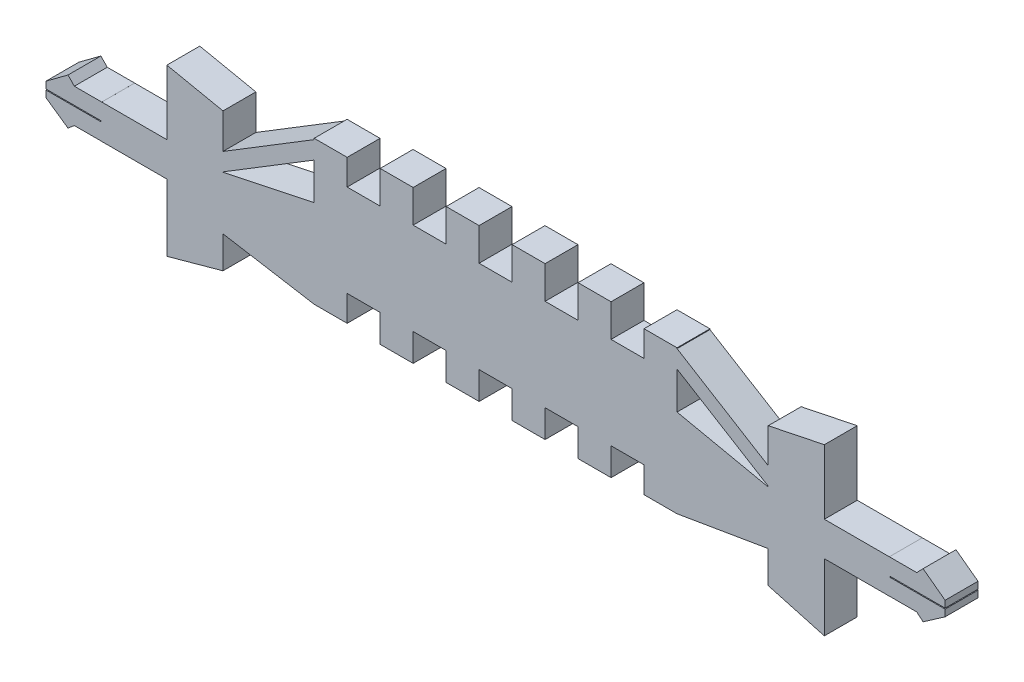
ISO-10303-21;
HEADER;
FILE_DESCRIPTION(('STEP AP214'),'2;1');
FILE_NAME('part.step','',(''),(''),'','','');
FILE_SCHEMA(('AUTOMOTIVE_DESIGN { 1 0 10303 214 1 1 1 1 }'));
ENDSEC;
DATA;
#1=APPLICATION_CONTEXT('core data for automotive mechanical design processes');
#2=APPLICATION_PROTOCOL_DEFINITION('international standard','automotive_design',2000,#1);
#3=PRODUCT_CONTEXT('',#1,'mechanical');
#4=PRODUCT('Part','Part','',(#3));
#5=PRODUCT_RELATED_PRODUCT_CATEGORY('part','',(#4));
#6=PRODUCT_DEFINITION_FORMATION('','',#4);
#7=PRODUCT_DEFINITION_CONTEXT('part definition',#1,'design');
#8=PRODUCT_DEFINITION('design','',#6,#7);
#9=PRODUCT_DEFINITION_SHAPE('','',#8);
#10=(LENGTH_UNIT() NAMED_UNIT(*) SI_UNIT(.MILLI.,.METRE.));
#11=(NAMED_UNIT(*) PLANE_ANGLE_UNIT() SI_UNIT($,.RADIAN.));
#12=(NAMED_UNIT(*) SI_UNIT($,.STERADIAN.) SOLID_ANGLE_UNIT());
#13=UNCERTAINTY_MEASURE_WITH_UNIT(LENGTH_MEASURE(1.E-05),#10,'distance_accuracy_value','');
#14=(GEOMETRIC_REPRESENTATION_CONTEXT(3) GLOBAL_UNCERTAINTY_ASSIGNED_CONTEXT((#13)) GLOBAL_UNIT_ASSIGNED_CONTEXT((#10,
#11,#12)) REPRESENTATION_CONTEXT('',''));
#15=CARTESIAN_POINT('',(0.,0.,0.));
#16=DIRECTION('',(0.,0.,1.));
#17=DIRECTION('',(1.,0.,0.));
#18=AXIS2_PLACEMENT_3D('',#15,#16,#17);
#19=CARTESIAN_POINT('',(0.,0.,3.));
#20=DIRECTION('',(0.,0.,-1.));
#21=DIRECTION('',(-1.,0.,0.));
#22=AXIS2_PLACEMENT_3D('',#19,#20,#21);
#23=PLANE('',#22);
#24=DIRECTION('',(0.,1.,0.));
#25=VECTOR('',#24,1.);
#26=CARTESIAN_POINT('',(267.300220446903,573.624434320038,3.));
#27=LINE('',#26,#25);
#28=CARTESIAN_POINT('',(267.300220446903,570.268136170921,3.));
#29=VERTEX_POINT('',#28);
#30=CARTESIAN_POINT('',(267.300220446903,573.624434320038,3.));
#31=VERTEX_POINT('',#30);
#32=EDGE_CURVE('E712',#29,#31,#27,.T.);
#33=ORIENTED_EDGE('',*,*,#32,.F.);
#34=DIRECTION('',(0.978243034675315,0.207462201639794,0.));
#35=VECTOR('',#34,1.);
#36=CARTESIAN_POINT('',(267.300220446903,570.268136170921,3.));
#37=LINE('',#36,#35);
#38=CARTESIAN_POINT('',(258.982984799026,568.504247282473,3.));
#39=VERTEX_POINT('',#38);
#40=EDGE_CURVE('E723',#39,#29,#37,.T.);
#41=ORIENTED_EDGE('',*,*,#40,.F.);
#42=DIRECTION('',(0.,-1.,0.));
#43=VECTOR('',#42,1.);
#44=CARTESIAN_POINT('',(258.982984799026,568.504247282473,3.));
#45=LINE('',#44,#43);
#46=CARTESIAN_POINT('',(258.982984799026,568.534564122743,3.));
#47=VERTEX_POINT('',#46);
#48=EDGE_CURVE('E719',#47,#39,#45,.T.);
#49=ORIENTED_EDGE('',*,*,#48,.F.);
#50=DIRECTION('',(-0.852957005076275,-0.521981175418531,0.));
#51=VECTOR('',#50,1.);
#52=CARTESIAN_POINT('',(258.982984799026,568.534564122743,3.));
#53=LINE('',#52,#51);
#54=EDGE_CURVE('E720',#31,#47,#53,.T.);
#55=ORIENTED_EDGE('',*,*,#54,.F.);
#56=EDGE_LOOP('',(#33,#41,#49,#55));
#57=FACE_BOUND('',#56,.T.);
#58=DIRECTION('',(1.,0.,0.));
#59=VECTOR('',#58,1.);
#60=CARTESIAN_POINT('',(298.806049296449,562.234604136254,3.));
#61=LINE('',#60,#59);
#62=CARTESIAN_POINT('',(297.385808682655,562.234604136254,3.));
#63=VERTEX_POINT('',#62);
#64=CARTESIAN_POINT('',(300.394324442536,562.234604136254,3.));
#65=VERTEX_POINT('',#64);
#66=EDGE_CURVE('E755',#63,#65,#61,.T.);
#67=ORIENTED_EDGE('',*,*,#66,.T.);
#68=DIRECTION('',(0.985952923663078,0.167023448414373,0.));
#69=VECTOR('',#68,1.);
#70=CARTESIAN_POINT('',(300.394324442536,562.234604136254,3.));
#71=LINE('',#70,#69);
#72=CARTESIAN_POINT('',(308.71151702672,563.643562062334,3.));
#73=VERTEX_POINT('',#72);
#74=EDGE_CURVE('E756',#65,#73,#71,.T.);
#75=ORIENTED_EDGE('',*,*,#74,.T.);
#76=DIRECTION('',(0.,-1.,0.));
#77=VECTOR('',#76,1.);
#78=CARTESIAN_POINT('',(308.71151702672,563.643562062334,3.));
#79=LINE('',#78,#77);
#80=CARTESIAN_POINT('',(308.71151702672,560.717642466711,3.));
#81=VERTEX_POINT('',#80);
#82=EDGE_CURVE('E757',#73,#81,#79,.T.);
#83=ORIENTED_EDGE('',*,*,#82,.T.);
#84=DIRECTION('',(0.964011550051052,-0.265860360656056,0.));
#85=VECTOR('',#84,1.);
#86=CARTESIAN_POINT('',(308.71151702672,560.717642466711,3.));
#87=LINE('',#86,#85);
#88=CARTESIAN_POINT('',(313.828215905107,559.306531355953,3.));
#89=VERTEX_POINT('',#88);
#90=EDGE_CURVE('E765',#81,#89,#87,.T.);
#91=ORIENTED_EDGE('',*,*,#90,.T.);
#92=DIRECTION('',(0.,1.,0.));
#93=VECTOR('',#92,1.);
#94=CARTESIAN_POINT('',(313.828215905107,559.306531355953,3.));
#95=LINE('',#94,#93);
#96=CARTESIAN_POINT('',(313.828215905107,565.407450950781,3.));
#97=VERTEX_POINT('',#96);
#98=EDGE_CURVE('E764',#89,#97,#95,.T.);
#99=ORIENTED_EDGE('',*,*,#98,.T.);
#100=DIRECTION('',(1.,0.,0.));
#101=VECTOR('',#100,1.);
#102=CARTESIAN_POINT('',(313.828215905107,565.407450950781,3.));
#103=LINE('',#102,#101);
#104=CARTESIAN_POINT('',(319.828237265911,565.407450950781,3.));
#105=VERTEX_POINT('',#104);
#106=EDGE_CURVE('E767',#97,#105,#103,.T.);
#107=ORIENTED_EDGE('',*,*,#106,.T.);
#108=DIRECTION('',(0.,1.,0.));
#109=VECTOR('',#108,1.);
#110=CARTESIAN_POINT('',(319.828237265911,565.407450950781,3.));
#111=LINE('',#110,#109);
#112=CARTESIAN_POINT('',(319.828237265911,565.413135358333,3.));
#113=VERTEX_POINT('',#112);
#114=EDGE_CURVE('E772',#105,#113,#111,.T.);
#115=ORIENTED_EDGE('',*,*,#114,.T.);
#116=DIRECTION('',(1.,0.,0.));
#117=VECTOR('',#116,1.);
#118=CARTESIAN_POINT('',(319.828237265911,565.413135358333,3.));
#119=LINE('',#118,#117);
#120=CARTESIAN_POINT('',(322.255780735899,565.413135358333,3.));
#121=VERTEX_POINT('',#120);
#122=EDGE_CURVE('E771',#113,#121,#119,.T.);
#123=ORIENTED_EDGE('',*,*,#122,.T.);
#124=DIRECTION('',(0.761116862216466,-0.648614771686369,0.));
#125=VECTOR('',#124,1.);
#126=CARTESIAN_POINT('',(322.255780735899,565.413135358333,3.));
#127=LINE('',#126,#125);
#128=CARTESIAN_POINT('',(322.834384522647,564.920056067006,3.));
#129=VERTEX_POINT('',#128);
#130=EDGE_CURVE('E780',#121,#129,#127,.T.);
#131=ORIENTED_EDGE('',*,*,#130,.T.);
#132=DIRECTION('',(0.820440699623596,0.571731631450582,0.));
#133=VECTOR('',#132,1.);
#134=CARTESIAN_POINT('',(322.834384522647,564.920056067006,3.));
#135=LINE('',#134,#133);
#136=CARTESIAN_POINT('',(324.841669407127,566.318850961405,3.));
#137=VERTEX_POINT('',#136);
#138=EDGE_CURVE('E779',#129,#137,#135,.T.);
#139=ORIENTED_EDGE('',*,*,#138,.T.);
#140=DIRECTION('',(0.,1.,0.));
#141=VECTOR('',#140,1.);
#142=CARTESIAN_POINT('',(324.841669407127,566.318850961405,3.));
#143=LINE('',#142,#141);
#144=CARTESIAN_POINT('',(324.841669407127,566.925187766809,3.));
#145=VERTEX_POINT('',#144);
#146=EDGE_CURVE('E783',#137,#145,#143,.T.);
#147=ORIENTED_EDGE('',*,*,#146,.T.);
#148=DIRECTION('',(-1.,0.,0.));
#149=VECTOR('',#148,1.);
#150=CARTESIAN_POINT('',(324.841669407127,566.925187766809,3.));
#151=LINE('',#150,#149);
#152=CARTESIAN_POINT('',(319.828237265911,566.925187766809,3.));
#153=VERTEX_POINT('',#152);
#154=EDGE_CURVE('E786',#145,#153,#151,.T.);
#155=ORIENTED_EDGE('',*,*,#154,.T.);
#156=DIRECTION('',(0.,1.,0.));
#157=VECTOR('',#156,1.);
#158=CARTESIAN_POINT('',(319.828237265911,566.925187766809,3.));
#159=LINE('',#158,#157);
#160=CARTESIAN_POINT('',(319.828237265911,567.009075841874,3.));
#161=VERTEX_POINT('',#160);
#162=EDGE_CURVE('E788',#153,#161,#159,.T.);
#163=ORIENTED_EDGE('',*,*,#162,.T.);
#164=DIRECTION('',(1.,0.,0.));
#165=VECTOR('',#164,1.);
#166=CARTESIAN_POINT('',(319.828237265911,567.009075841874,3.));
#167=LINE('',#166,#165);
#168=CARTESIAN_POINT('',(324.841669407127,567.009075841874,3.));
#169=VERTEX_POINT('',#168);
#170=EDGE_CURVE('E795',#161,#169,#167,.T.);
#171=ORIENTED_EDGE('',*,*,#170,.T.);
#172=DIRECTION('',(0.,1.,0.));
#173=VECTOR('',#172,1.);
#174=CARTESIAN_POINT('',(324.841669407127,567.009075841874,3.));
#175=LINE('',#174,#173);
#176=CARTESIAN_POINT('',(324.841669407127,567.630054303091,3.));
#177=VERTEX_POINT('',#176);
#178=EDGE_CURVE('E793',#169,#177,#175,.T.);
#179=ORIENTED_EDGE('',*,*,#178,.T.);
#180=DIRECTION('',(-0.802942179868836,0.596056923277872,0.));
#181=VECTOR('',#180,1.);
#182=CARTESIAN_POINT('',(324.841669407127,567.630054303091,3.));
#183=LINE('',#182,#181);
#184=CARTESIAN_POINT('',(322.834384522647,569.120144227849,3.));
#185=VERTEX_POINT('',#184);
#186=EDGE_CURVE('E797',#177,#185,#183,.T.);
#187=ORIENTED_EDGE('',*,*,#186,.T.);
#188=DIRECTION('',(-0.6947458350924,-0.719255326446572,0.));
#189=VECTOR('',#188,1.);
#190=CARTESIAN_POINT('',(322.834384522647,569.120144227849,3.));
#191=LINE('',#190,#189);
#192=CARTESIAN_POINT('',(322.255780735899,568.521128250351,3.));
#193=VERTEX_POINT('',#192);
#194=EDGE_CURVE('E801',#185,#193,#191,.T.);
#195=ORIENTED_EDGE('',*,*,#194,.T.);
#196=DIRECTION('',(-1.,0.,0.));
#197=VECTOR('',#196,1.);
#198=CARTESIAN_POINT('',(322.255780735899,568.521128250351,3.));
#199=LINE('',#198,#197);
#200=CARTESIAN_POINT('',(319.75817263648,568.521128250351,3.));
#201=VERTEX_POINT('',#200);
#202=EDGE_CURVE('E802',#193,#201,#199,.T.);
#203=ORIENTED_EDGE('',*,*,#202,.T.);
#204=DIRECTION('',(0.,-1.,0.));
#205=VECTOR('',#204,1.);
#206=CARTESIAN_POINT('',(319.75817263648,568.521128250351,3.));
#207=LINE('',#206,#205);
#208=CARTESIAN_POINT('',(319.75817263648,568.519750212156,3.));
#209=VERTEX_POINT('',#208);
#210=EDGE_CURVE('E807',#201,#209,#207,.T.);
#211=ORIENTED_EDGE('',*,*,#210,.T.);
#212=DIRECTION('',(-1.,0.,0.));
#213=VECTOR('',#212,1.);
#214=CARTESIAN_POINT('',(319.75817263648,568.519750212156,3.));
#215=LINE('',#214,#213);
#216=CARTESIAN_POINT('',(313.828215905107,568.519750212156,3.));
#217=VERTEX_POINT('',#216);
#218=EDGE_CURVE('E810',#209,#217,#215,.T.);
#219=ORIENTED_EDGE('',*,*,#218,.T.);
#220=DIRECTION('',(0.,1.,0.));
#221=VECTOR('',#220,1.);
#222=CARTESIAN_POINT('',(313.828215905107,568.519750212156,3.));
#223=LINE('',#222,#221);
#224=CARTESIAN_POINT('',(313.828215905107,574.409571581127,3.));
#225=VERTEX_POINT('',#224);
#226=EDGE_CURVE('E811',#217,#225,#223,.T.);
#227=ORIENTED_EDGE('',*,*,#226,.T.);
#228=DIRECTION('',(-0.979271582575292,-0.202551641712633,0.));
#229=VECTOR('',#228,1.);
#230=CARTESIAN_POINT('',(313.828215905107,574.409571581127,3.));
#231=LINE('',#230,#229);
#232=CARTESIAN_POINT('',(308.71151702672,573.351238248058,3.));
#233=VERTEX_POINT('',#232);
#234=EDGE_CURVE('E818',#225,#233,#231,.T.);
#235=ORIENTED_EDGE('',*,*,#234,.T.);
#236=DIRECTION('',(0.,-1.,0.));
#237=VECTOR('',#236,1.);
#238=CARTESIAN_POINT('',(308.71151702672,573.351238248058,3.));
#239=LINE('',#238,#237);
#240=CARTESIAN_POINT('',(308.71151702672,570.189243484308,3.));
#241=VERTEX_POINT('',#240);
#242=EDGE_CURVE('E819',#233,#241,#239,.T.);
#243=ORIENTED_EDGE('',*,*,#242,.T.);
#244=DIRECTION('',(-0.852955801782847,0.521983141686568,0.));
#245=VECTOR('',#244,1.);
#246=CARTESIAN_POINT('',(308.71151702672,570.189243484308,3.));
#247=LINE('',#246,#245);
#248=CARTESIAN_POINT('',(300.394324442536,575.279113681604,3.));
#249=VERTEX_POINT('',#248);
#250=EDGE_CURVE('E825',#241,#249,#247,.T.);
#251=ORIENTED_EDGE('',*,*,#250,.T.);
#252=DIRECTION('',(0.,1.,0.));
#253=VECTOR('',#252,1.);
#254=CARTESIAN_POINT('',(300.394324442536,575.279113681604,3.));
#255=LINE('',#254,#253);
#256=CARTESIAN_POINT('',(300.394324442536,575.346637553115,3.));
#257=VERTEX_POINT('',#256);
#258=EDGE_CURVE('E824',#249,#257,#255,.T.);
#259=ORIENTED_EDGE('',*,*,#258,.T.);
#260=DIRECTION('',(-1.,0.,0.));
#261=VECTOR('',#260,1.);
#262=CARTESIAN_POINT('',(300.394324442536,575.346637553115,3.));
#263=LINE('',#262,#261);
#264=CARTESIAN_POINT('',(297.385808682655,575.346637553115,3.));
#265=VERTEX_POINT('',#264);
#266=EDGE_CURVE('E828',#257,#265,#263,.T.);
#267=ORIENTED_EDGE('',*,*,#266,.T.);
#268=DIRECTION('',(0.,-1.,0.));
#269=VECTOR('',#268,1.);
#270=CARTESIAN_POINT('',(297.385808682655,575.346637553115,3.));
#271=LINE('',#270,#269);
#272=CARTESIAN_POINT('',(297.385808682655,572.998460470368,3.));
#273=VERTEX_POINT('',#272);
#274=EDGE_CURVE('E831',#265,#273,#271,.T.);
#275=ORIENTED_EDGE('',*,*,#274,.T.);
#276=DIRECTION('',(-1.,0.,0.));
#277=VECTOR('',#276,1.);
#278=CARTESIAN_POINT('',(297.385808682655,572.998460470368,3.));
#279=LINE('',#278,#277);
#280=CARTESIAN_POINT('',(294.375914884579,572.998460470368,3.));
#281=VERTEX_POINT('',#280);
#282=EDGE_CURVE('E833',#273,#281,#279,.T.);
#283=ORIENTED_EDGE('',*,*,#282,.T.);
#284=DIRECTION('',(0.,1.,0.));
#285=VECTOR('',#284,1.);
#286=CARTESIAN_POINT('',(294.375914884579,572.998460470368,3.));
#287=LINE('',#286,#285);
#288=CARTESIAN_POINT('',(294.375914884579,575.973558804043,3.));
#289=VERTEX_POINT('',#288);
#290=EDGE_CURVE('E840',#281,#289,#287,.T.);
#291=ORIENTED_EDGE('',*,*,#290,.T.);
#292=DIRECTION('',(-1.,0.,0.));
#293=VECTOR('',#292,1.);
#294=CARTESIAN_POINT('',(294.375914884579,575.973558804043,3.));
#295=LINE('',#294,#293);
#296=CARTESIAN_POINT('',(291.3667101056,575.973558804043,3.));
#297=VERTEX_POINT('',#296);
#298=EDGE_CURVE('E838',#289,#297,#295,.T.);
#299=ORIENTED_EDGE('',*,*,#298,.T.);
#300=DIRECTION('',(0.,-1.,0.));
#301=VECTOR('',#300,1.);
#302=CARTESIAN_POINT('',(291.3667101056,575.973558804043,3.));
#303=LINE('',#302,#301);
#304=CARTESIAN_POINT('',(291.3667101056,572.998460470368,3.));
#305=VERTEX_POINT('',#304);
#306=EDGE_CURVE('E842',#297,#305,#303,.T.);
#307=ORIENTED_EDGE('',*,*,#306,.T.);
#308=DIRECTION('',(-1.,0.,0.));
#309=VECTOR('',#308,1.);
#310=CARTESIAN_POINT('',(291.3667101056,572.998460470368,3.));
#311=LINE('',#310,#309);
#312=CARTESIAN_POINT('',(288.359314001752,572.998460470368,3.));
#313=VERTEX_POINT('',#312);
#314=EDGE_CURVE('E846',#305,#313,#311,.T.);
#315=ORIENTED_EDGE('',*,*,#314,.T.);
#316=DIRECTION('',(0.,1.,0.));
#317=VECTOR('',#316,1.);
#318=CARTESIAN_POINT('',(288.359314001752,572.998460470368,3.));
#319=LINE('',#318,#317);
#320=CARTESIAN_POINT('',(288.359314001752,575.973558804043,3.));
#321=VERTEX_POINT('',#320);
#322=EDGE_CURVE('E847',#313,#321,#319,.T.);
#323=ORIENTED_EDGE('',*,*,#322,.T.);
#324=DIRECTION('',(-1.,0.,0.));
#325=VECTOR('',#324,1.);
#326=CARTESIAN_POINT('',(288.359314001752,575.973558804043,3.));
#327=LINE('',#326,#325);
#328=CARTESIAN_POINT('',(285.350109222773,575.973558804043,3.));
#329=VERTEX_POINT('',#328);
#330=EDGE_CURVE('E852',#321,#329,#327,.T.);
#331=ORIENTED_EDGE('',*,*,#330,.T.);
#332=DIRECTION('',(0.,-1.,0.));
#333=VECTOR('',#332,1.);
#334=CARTESIAN_POINT('',(285.350109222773,575.973558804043,3.));
#335=LINE('',#334,#333);
#336=CARTESIAN_POINT('',(285.350109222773,572.998460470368,3.));
#337=VERTEX_POINT('',#336);
#338=EDGE_CURVE('E855',#329,#337,#335,.T.);
#339=ORIENTED_EDGE('',*,*,#338,.T.);
#340=DIRECTION('',(-1.,0.,0.));
#341=VECTOR('',#340,1.);
#342=CARTESIAN_POINT('',(285.350109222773,572.998460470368,3.));
#343=LINE('',#342,#341);
#344=CARTESIAN_POINT('',(282.342713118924,572.998460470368,3.));
#345=VERTEX_POINT('',#344);
#346=EDGE_CURVE('E856',#337,#345,#343,.T.);
#347=ORIENTED_EDGE('',*,*,#346,.T.);
#348=DIRECTION('',(0.,1.,0.));
#349=VECTOR('',#348,1.);
#350=CARTESIAN_POINT('',(282.342713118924,572.998460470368,3.));
#351=LINE('',#350,#349);
#352=CARTESIAN_POINT('',(282.342713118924,575.973558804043,3.));
#353=VERTEX_POINT('',#352);
#354=EDGE_CURVE('E861',#345,#353,#351,.T.);
#355=ORIENTED_EDGE('',*,*,#354,.T.);
#356=DIRECTION('',(-1.,0.,0.));
#357=VECTOR('',#356,1.);
#358=CARTESIAN_POINT('',(282.342713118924,575.973558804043,3.));
#359=LINE('',#358,#357);
#360=CARTESIAN_POINT('',(279.333508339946,575.973558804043,3.));
#361=VERTEX_POINT('',#360);
#362=EDGE_CURVE('E863',#353,#361,#359,.T.);
#363=ORIENTED_EDGE('',*,*,#362,.T.);
#364=DIRECTION('',(0.,-1.,0.));
#365=VECTOR('',#364,1.);
#366=CARTESIAN_POINT('',(279.333508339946,575.973558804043,3.));
#367=LINE('',#366,#365);
#368=CARTESIAN_POINT('',(279.333508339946,572.998460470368,3.));
#369=VERTEX_POINT('',#368);
#370=EDGE_CURVE('E870',#361,#369,#367,.T.);
#371=ORIENTED_EDGE('',*,*,#370,.T.);
#372=DIRECTION('',(-1.,0.,0.));
#373=VECTOR('',#372,1.);
#374=CARTESIAN_POINT('',(279.333508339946,572.998460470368,3.));
#375=LINE('',#374,#373);
#376=CARTESIAN_POINT('',(276.326069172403,572.998460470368,3.));
#377=VERTEX_POINT('',#376);
#378=EDGE_CURVE('E869',#369,#377,#375,.T.);
#379=ORIENTED_EDGE('',*,*,#378,.T.);
#380=DIRECTION('',(0.,1.,0.));
#381=VECTOR('',#380,1.);
#382=CARTESIAN_POINT('',(276.326069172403,572.998460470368,3.));
#383=LINE('',#382,#381);
#384=CARTESIAN_POINT('',(276.326069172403,575.973558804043,3.));
#385=VERTEX_POINT('',#384);
#386=EDGE_CURVE('E874',#377,#385,#383,.T.);
#387=ORIENTED_EDGE('',*,*,#386,.T.);
#388=DIRECTION('',(-1.,0.,0.));
#389=VECTOR('',#388,1.);
#390=CARTESIAN_POINT('',(276.326069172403,575.973558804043,3.));
#391=LINE('',#390,#389);
#392=CARTESIAN_POINT('',(273.316864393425,575.973558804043,3.));
#393=VERTEX_POINT('',#392);
#394=EDGE_CURVE('E878',#385,#393,#391,.T.);
#395=ORIENTED_EDGE('',*,*,#394,.T.);
#396=DIRECTION('',(0.,-1.,0.));
#397=VECTOR('',#396,1.);
#398=CARTESIAN_POINT('',(273.316864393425,575.973558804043,3.));
#399=LINE('',#398,#397);
#400=CARTESIAN_POINT('',(273.316864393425,572.998460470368,3.));
#401=VERTEX_POINT('',#400);
#402=EDGE_CURVE('E880',#393,#401,#399,.T.);
#403=ORIENTED_EDGE('',*,*,#402,.T.);
#404=DIRECTION('',(-1.,0.,0.));
#405=VECTOR('',#404,1.);
#406=CARTESIAN_POINT('',(273.316864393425,572.998460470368,3.));
#407=LINE('',#406,#405);
#408=CARTESIAN_POINT('',(270.308736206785,572.998460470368,3.));
#409=VERTEX_POINT('',#408);
#410=EDGE_CURVE('E885',#401,#409,#407,.T.);
#411=ORIENTED_EDGE('',*,*,#410,.T.);
#412=DIRECTION('',(0.,1.,0.));
#413=VECTOR('',#412,1.);
#414=CARTESIAN_POINT('',(270.308736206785,572.998460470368,3.));
#415=LINE('',#414,#413);
#416=CARTESIAN_POINT('',(270.308736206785,575.346637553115,3.));
#417=VERTEX_POINT('',#416);
#418=EDGE_CURVE('E882',#409,#417,#415,.T.);
#419=ORIENTED_EDGE('',*,*,#418,.T.);
#420=DIRECTION('',(-1.,0.,0.));
#421=VECTOR('',#420,1.);
#422=CARTESIAN_POINT('',(270.308736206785,575.346637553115,3.));
#423=LINE('',#422,#421);
#424=CARTESIAN_POINT('',(267.300220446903,575.346637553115,3.));
#425=VERTEX_POINT('',#424);
#426=EDGE_CURVE('E888',#417,#425,#423,.T.);
#427=ORIENTED_EDGE('',*,*,#426,.T.);
#428=DIRECTION('',(0.,-1.,0.));
#429=VECTOR('',#428,1.);
#430=CARTESIAN_POINT('',(267.300220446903,575.346637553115,3.));
#431=LINE('',#430,#429);
#432=CARTESIAN_POINT('',(267.300220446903,575.238633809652,3.));
#433=VERTEX_POINT('',#432);
#434=EDGE_CURVE('E891',#425,#433,#431,.T.);
#435=ORIENTED_EDGE('',*,*,#434,.T.);
#436=DIRECTION('',(-0.852960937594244,-0.521974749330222,0.));
#437=VECTOR('',#436,1.);
#438=CARTESIAN_POINT('',(267.300220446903,575.238633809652,3.));
#439=LINE('',#438,#437);
#440=CARTESIAN_POINT('',(258.982984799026,570.148849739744,3.));
#441=VERTEX_POINT('',#440);
#442=EDGE_CURVE('E892',#433,#441,#439,.T.);
#443=ORIENTED_EDGE('',*,*,#442,.T.);
#444=DIRECTION('',(0.,1.,0.));
#445=VECTOR('',#444,1.);
#446=CARTESIAN_POINT('',(258.982984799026,570.148849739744,3.));
#447=LINE('',#446,#445);
#448=CARTESIAN_POINT('',(258.982984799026,573.351238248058,3.));
#449=VERTEX_POINT('',#448);
#450=EDGE_CURVE('E900',#441,#449,#447,.T.);
#451=ORIENTED_EDGE('',*,*,#450,.T.);
#452=DIRECTION('',(-0.979271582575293,0.202551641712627,0.));
#453=VECTOR('',#452,1.);
#454=CARTESIAN_POINT('',(258.982984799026,573.351238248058,3.));
#455=LINE('',#454,#453);
#456=CARTESIAN_POINT('',(253.86628592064,574.409571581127,3.));
#457=VERTEX_POINT('',#456);
#458=EDGE_CURVE('E899',#449,#457,#455,.T.);
#459=ORIENTED_EDGE('',*,*,#458,.T.);
#460=DIRECTION('',(0.,-1.,0.));
#461=VECTOR('',#460,1.);
#462=CARTESIAN_POINT('',(253.86628592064,574.409571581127,3.));
#463=LINE('',#462,#461);
#464=CARTESIAN_POINT('',(253.86628592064,568.504247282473,3.));
#465=VERTEX_POINT('',#464);
#466=EDGE_CURVE('E904',#457,#465,#463,.T.);
#467=ORIENTED_EDGE('',*,*,#466,.T.);
#468=DIRECTION('',(-1.,0.,0.));
#469=VECTOR('',#468,1.);
#470=CARTESIAN_POINT('',(253.86628592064,568.504247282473,3.));
#471=LINE('',#470,#469);
#472=CARTESIAN_POINT('',(253.864175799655,568.504247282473,3.));
#473=VERTEX_POINT('',#472);
#474=EDGE_CURVE('E906',#465,#473,#471,.T.);
#475=ORIENTED_EDGE('',*,*,#474,.T.);
#476=DIRECTION('',(0.,1.,0.));
#477=VECTOR('',#476,1.);
#478=CARTESIAN_POINT('',(253.864175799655,568.504247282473,3.));
#479=LINE('',#478,#477);
#480=CARTESIAN_POINT('',(253.864175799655,568.519750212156,3.));
#481=VERTEX_POINT('',#480);
#482=EDGE_CURVE('E908',#473,#481,#479,.T.);
#483=ORIENTED_EDGE('',*,*,#482,.T.);
#484=DIRECTION('',(-1.,0.,0.));
#485=VECTOR('',#484,1.);
#486=CARTESIAN_POINT('',(253.864175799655,568.519750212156,3.));
#487=LINE('',#486,#485);
#488=CARTESIAN_POINT('',(247.926295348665,568.519750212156,3.));
#489=VERTEX_POINT('',#488);
#490=EDGE_CURVE('E915',#481,#489,#487,.T.);
#491=ORIENTED_EDGE('',*,*,#490,.T.);
#492=DIRECTION('',(0.,1.,0.));
#493=VECTOR('',#492,1.);
#494=CARTESIAN_POINT('',(247.926295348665,568.519750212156,3.));
#495=LINE('',#494,#493);
#496=CARTESIAN_POINT('',(247.926295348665,568.521128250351,3.));
#497=VERTEX_POINT('',#496);
#498=EDGE_CURVE('E914',#489,#497,#495,.T.);
#499=ORIENTED_EDGE('',*,*,#498,.T.);
#500=DIRECTION('',(-1.,0.,0.));
#501=VECTOR('',#500,1.);
#502=CARTESIAN_POINT('',(247.926295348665,568.521128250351,3.));
#503=LINE('',#502,#501);
#504=CARTESIAN_POINT('',(245.428687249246,568.521128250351,3.));
#505=VERTEX_POINT('',#504);
#506=EDGE_CURVE('E919',#497,#505,#503,.T.);
#507=ORIENTED_EDGE('',*,*,#506,.T.);
#508=DIRECTION('',(-0.694745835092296,0.719255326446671,0.));
#509=VECTOR('',#508,1.);
#510=CARTESIAN_POINT('',(245.428687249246,568.521128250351,3.));
#511=LINE('',#510,#509);
#512=CARTESIAN_POINT('',(244.850083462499,569.120144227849,3.));
#513=VERTEX_POINT('',#512);
#514=EDGE_CURVE('E922',#505,#513,#511,.T.);
#515=ORIENTED_EDGE('',*,*,#514,.T.);
#516=DIRECTION('',(-0.802942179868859,-0.59605692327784,0.));
#517=VECTOR('',#516,1.);
#518=CARTESIAN_POINT('',(244.850083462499,569.120144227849,3.));
#519=LINE('',#518,#517);
#520=CARTESIAN_POINT('',(242.842798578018,567.630054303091,3.));
#521=VERTEX_POINT('',#520);
#522=EDGE_CURVE('E924',#513,#521,#519,.T.);
#523=ORIENTED_EDGE('',*,*,#522,.T.);
#524=DIRECTION('',(0.,-1.,0.));
#525=VECTOR('',#524,1.);
#526=CARTESIAN_POINT('',(242.842798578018,567.630054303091,3.));
#527=LINE('',#526,#525);
#528=CARTESIAN_POINT('',(242.842798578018,567.009075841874,3.));
#529=VERTEX_POINT('',#528);
#530=EDGE_CURVE('E930',#521,#529,#527,.T.);
#531=ORIENTED_EDGE('',*,*,#530,.T.);
#532=DIRECTION('',(1.,0.,0.));
#533=VECTOR('',#532,1.);
#534=CARTESIAN_POINT('',(242.842798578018,567.009075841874,3.));
#535=LINE('',#534,#533);
#536=CARTESIAN_POINT('',(247.864197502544,567.009075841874,3.));
#537=VERTEX_POINT('',#536);
#538=EDGE_CURVE('E929',#529,#537,#535,.T.);
#539=ORIENTED_EDGE('',*,*,#538,.T.);
#540=DIRECTION('',(0.,-1.,0.));
#541=VECTOR('',#540,1.);
#542=CARTESIAN_POINT('',(247.864197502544,567.009075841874,3.));
#543=LINE('',#542,#541);
#544=CARTESIAN_POINT('',(247.864197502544,566.925187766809,3.));
#545=VERTEX_POINT('',#544);
#546=EDGE_CURVE('E933',#537,#545,#543,.T.);
#547=ORIENTED_EDGE('',*,*,#546,.T.);
#548=DIRECTION('',(-1.,0.,0.));
#549=VECTOR('',#548,1.);
#550=CARTESIAN_POINT('',(247.864197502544,566.925187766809,3.));
#551=LINE('',#550,#549);
#552=CARTESIAN_POINT('',(242.842798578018,566.925187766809,3.));
#553=VERTEX_POINT('',#552);
#554=EDGE_CURVE('E936',#545,#553,#551,.T.);
#555=ORIENTED_EDGE('',*,*,#554,.T.);
#556=DIRECTION('',(0.,-1.,0.));
#557=VECTOR('',#556,1.);
#558=CARTESIAN_POINT('',(242.842798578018,566.925187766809,3.));
#559=LINE('',#558,#557);
#560=CARTESIAN_POINT('',(242.842798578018,566.318850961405,3.));
#561=VERTEX_POINT('',#560);
#562=EDGE_CURVE('E938',#553,#561,#559,.T.);
#563=ORIENTED_EDGE('',*,*,#562,.T.);
#564=DIRECTION('',(0.820440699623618,-0.57173163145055,0.));
#565=VECTOR('',#564,1.);
#566=CARTESIAN_POINT('',(242.842798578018,566.318850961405,3.));
#567=LINE('',#566,#565);
#568=CARTESIAN_POINT('',(244.850083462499,564.920056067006,3.));
#569=VERTEX_POINT('',#568);
#570=EDGE_CURVE('E942',#561,#569,#567,.T.);
#571=ORIENTED_EDGE('',*,*,#570,.T.);
#572=DIRECTION('',(0.761116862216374,0.648614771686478,0.));
#573=VECTOR('',#572,1.);
#574=CARTESIAN_POINT('',(244.850083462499,564.920056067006,3.));
#575=LINE('',#574,#573);
#576=CARTESIAN_POINT('',(245.428687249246,565.413135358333,3.));
#577=VERTEX_POINT('',#576);
#578=EDGE_CURVE('E944',#569,#577,#575,.T.);
#579=ORIENTED_EDGE('',*,*,#578,.T.);
#580=DIRECTION('',(1.,0.,0.));
#581=VECTOR('',#580,1.);
#582=CARTESIAN_POINT('',(245.428687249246,565.413135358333,3.));
#583=LINE('',#582,#581);
#584=CARTESIAN_POINT('',(247.935123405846,565.413135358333,3.));
#585=VERTEX_POINT('',#584);
#586=EDGE_CURVE('E946',#577,#585,#583,.T.);
#587=ORIENTED_EDGE('',*,*,#586,.T.);
#588=DIRECTION('',(0.,-1.,0.));
#589=VECTOR('',#588,1.);
#590=CARTESIAN_POINT('',(247.935123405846,565.413135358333,3.));
#591=LINE('',#590,#589);
#592=CARTESIAN_POINT('',(247.935123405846,565.407450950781,3.));
#593=VERTEX_POINT('',#592);
#594=EDGE_CURVE('E951',#585,#593,#591,.T.);
#595=ORIENTED_EDGE('',*,*,#594,.T.);
#596=DIRECTION('',(1.,0.,0.));
#597=VECTOR('',#596,1.);
#598=CARTESIAN_POINT('',(247.935123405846,565.407450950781,3.));
#599=LINE('',#598,#597);
#600=CARTESIAN_POINT('',(253.86628592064,565.407450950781,3.));
#601=VERTEX_POINT('',#600);
#602=EDGE_CURVE('E952',#593,#601,#599,.T.);
#603=ORIENTED_EDGE('',*,*,#602,.T.);
#604=DIRECTION('',(0.,-1.,0.));
#605=VECTOR('',#604,1.);
#606=CARTESIAN_POINT('',(253.86628592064,565.407450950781,3.));
#607=LINE('',#606,#605);
#608=CARTESIAN_POINT('',(253.86628592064,559.306531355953,3.));
#609=VERTEX_POINT('',#608);
#610=EDGE_CURVE('E960',#601,#609,#607,.T.);
#611=ORIENTED_EDGE('',*,*,#610,.T.);
#612=DIRECTION('',(0.964011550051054,0.265860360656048,0.));
#613=VECTOR('',#612,1.);
#614=CARTESIAN_POINT('',(253.86628592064,559.306531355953,3.));
#615=LINE('',#614,#613);
#616=CARTESIAN_POINT('',(258.982984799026,560.717642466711,3.));
#617=VERTEX_POINT('',#616);
#618=EDGE_CURVE('E959',#609,#617,#615,.T.);
#619=ORIENTED_EDGE('',*,*,#618,.T.);
#620=DIRECTION('',(0.,1.,0.));
#621=VECTOR('',#620,1.);
#622=CARTESIAN_POINT('',(258.982984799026,560.717642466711,3.));
#623=LINE('',#622,#621);
#624=CARTESIAN_POINT('',(258.982984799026,563.643562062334,3.));
#625=VERTEX_POINT('',#624);
#626=EDGE_CURVE('E962',#617,#625,#623,.T.);
#627=ORIENTED_EDGE('',*,*,#626,.T.);
#628=DIRECTION('',(0.985953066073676,-0.167022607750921,0.));
#629=VECTOR('',#628,1.);
#630=CARTESIAN_POINT('',(258.982984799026,563.643562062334,3.));
#631=LINE('',#630,#629);
#632=CARTESIAN_POINT('',(267.300220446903,562.234604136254,3.));
#633=VERTEX_POINT('',#632);
#634=EDGE_CURVE('E967',#625,#633,#631,.T.);
#635=ORIENTED_EDGE('',*,*,#634,.T.);
#636=DIRECTION('',(1.,0.,0.));
#637=VECTOR('',#636,1.);
#638=CARTESIAN_POINT('',(267.300220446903,562.234604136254,3.));
#639=LINE('',#638,#637);
#640=CARTESIAN_POINT('',(270.308736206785,562.234604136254,3.));
#641=VERTEX_POINT('',#640);
#642=EDGE_CURVE('E966',#633,#641,#639,.T.);
#643=ORIENTED_EDGE('',*,*,#642,.T.);
#644=DIRECTION('',(0.,1.,0.));
#645=VECTOR('',#644,1.);
#646=CARTESIAN_POINT('',(270.308736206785,562.234604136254,3.));
#647=LINE('',#646,#645);
#648=CARTESIAN_POINT('',(270.308736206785,564.598284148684,3.));
#649=VERTEX_POINT('',#648);
#650=EDGE_CURVE('E975',#641,#649,#647,.T.);
#651=ORIENTED_EDGE('',*,*,#650,.T.);
#652=DIRECTION('',(1.,0.,0.));
#653=VECTOR('',#652,1.);
#654=CARTESIAN_POINT('',(270.308736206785,564.598284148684,3.));
#655=LINE('',#654,#653);
#656=CARTESIAN_POINT('',(273.316864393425,564.598284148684,3.));
#657=VERTEX_POINT('',#656);
#658=EDGE_CURVE('E974',#649,#657,#655,.T.);
#659=ORIENTED_EDGE('',*,*,#658,.T.);
#660=DIRECTION('',(0.,-1.,0.));
#661=VECTOR('',#660,1.);
#662=CARTESIAN_POINT('',(273.316864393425,564.598284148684,3.));
#663=LINE('',#662,#661);
#664=CARTESIAN_POINT('',(273.316864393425,562.077593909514,3.));
#665=VERTEX_POINT('',#664);
#666=EDGE_CURVE('E978',#657,#665,#663,.T.);
#667=ORIENTED_EDGE('',*,*,#666,.T.);
#668=DIRECTION('',(1.,0.,0.));
#669=VECTOR('',#668,1.);
#670=CARTESIAN_POINT('',(273.316864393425,562.077593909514,3.));
#671=LINE('',#670,#669);
#672=CARTESIAN_POINT('',(276.326069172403,562.077593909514,3.));
#673=VERTEX_POINT('',#672);
#674=EDGE_CURVE('E981',#665,#673,#671,.T.);
#675=ORIENTED_EDGE('',*,*,#674,.T.);
#676=DIRECTION('',(0.,1.,0.));
#677=VECTOR('',#676,1.);
#678=CARTESIAN_POINT('',(276.326069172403,562.077593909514,3.));
#679=LINE('',#678,#677);
#680=CARTESIAN_POINT('',(276.326069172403,564.598284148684,3.));
#681=VERTEX_POINT('',#680);
#682=EDGE_CURVE('E983',#673,#681,#679,.T.);
#683=ORIENTED_EDGE('',*,*,#682,.T.);
#684=DIRECTION('',(1.,0.,0.));
#685=VECTOR('',#684,1.);
#686=CARTESIAN_POINT('',(276.326069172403,564.598284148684,3.));
#687=LINE('',#686,#685);
#688=CARTESIAN_POINT('',(279.333508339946,564.598284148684,3.));
#689=VERTEX_POINT('',#688);
#690=EDGE_CURVE('E990',#681,#689,#687,.T.);
#691=ORIENTED_EDGE('',*,*,#690,.T.);
#692=DIRECTION('',(0.,-1.,0.));
#693=VECTOR('',#692,1.);
#694=CARTESIAN_POINT('',(279.333508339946,564.598284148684,3.));
#695=LINE('',#694,#693);
#696=CARTESIAN_POINT('',(279.333508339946,562.077593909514,3.));
#697=VERTEX_POINT('',#696);
#698=EDGE_CURVE('E988',#689,#697,#695,.T.);
#699=ORIENTED_EDGE('',*,*,#698,.T.);
#700=DIRECTION('',(1.,0.,0.));
#701=VECTOR('',#700,1.);
#702=CARTESIAN_POINT('',(279.333508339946,562.077593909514,3.));
#703=LINE('',#702,#701);
#704=CARTESIAN_POINT('',(282.342713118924,562.077593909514,3.));
#705=VERTEX_POINT('',#704);
#706=EDGE_CURVE('E992',#697,#705,#703,.T.);
#707=ORIENTED_EDGE('',*,*,#706,.T.);
#708=DIRECTION('',(0.,1.,0.));
#709=VECTOR('',#708,1.);
#710=CARTESIAN_POINT('',(282.342713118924,562.077593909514,3.));
#711=LINE('',#710,#709);
#712=CARTESIAN_POINT('',(282.342713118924,564.598284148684,3.));
#713=VERTEX_POINT('',#712);
#714=EDGE_CURVE('E996',#705,#713,#711,.T.);
#715=ORIENTED_EDGE('',*,*,#714,.T.);
#716=DIRECTION('',(1.,0.,0.));
#717=VECTOR('',#716,1.);
#718=CARTESIAN_POINT('',(282.342713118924,564.598284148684,3.));
#719=LINE('',#718,#717);
#720=CARTESIAN_POINT('',(285.350109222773,564.598284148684,3.));
#721=VERTEX_POINT('',#720);
#722=EDGE_CURVE('E997',#713,#721,#719,.T.);
#723=ORIENTED_EDGE('',*,*,#722,.T.);
#724=DIRECTION('',(0.,-1.,0.));
#725=VECTOR('',#724,1.);
#726=CARTESIAN_POINT('',(285.350109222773,564.598284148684,3.));
#727=LINE('',#726,#725);
#728=CARTESIAN_POINT('',(285.350109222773,562.077593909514,3.));
#729=VERTEX_POINT('',#728);
#730=EDGE_CURVE('E1002',#721,#729,#727,.T.);
#731=ORIENTED_EDGE('',*,*,#730,.T.);
#732=DIRECTION('',(1.,0.,0.));
#733=VECTOR('',#732,1.);
#734=CARTESIAN_POINT('',(285.350109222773,562.077593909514,3.));
#735=LINE('',#734,#733);
#736=CARTESIAN_POINT('',(288.359314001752,562.077593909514,3.));
#737=VERTEX_POINT('',#736);
#738=EDGE_CURVE('E1005',#729,#737,#735,.T.);
#739=ORIENTED_EDGE('',*,*,#738,.T.);
#740=DIRECTION('',(0.,1.,0.));
#741=VECTOR('',#740,1.);
#742=CARTESIAN_POINT('',(288.359314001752,562.077593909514,3.));
#743=LINE('',#742,#741);
#744=CARTESIAN_POINT('',(288.359314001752,564.598284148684,3.));
#745=VERTEX_POINT('',#744);
#746=EDGE_CURVE('E1006',#737,#745,#743,.T.);
#747=ORIENTED_EDGE('',*,*,#746,.T.);
#748=DIRECTION('',(1.,0.,0.));
#749=VECTOR('',#748,1.);
#750=CARTESIAN_POINT('',(288.359314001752,564.598284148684,3.));
#751=LINE('',#750,#749);
#752=CARTESIAN_POINT('',(291.3667101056,564.598284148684,3.));
#753=VERTEX_POINT('',#752);
#754=EDGE_CURVE('E1013',#745,#753,#751,.T.);
#755=ORIENTED_EDGE('',*,*,#754,.T.);
#756=DIRECTION('',(0.,-1.,0.));
#757=VECTOR('',#756,1.);
#758=CARTESIAN_POINT('',(291.3667101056,564.598284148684,3.));
#759=LINE('',#758,#757);
#760=CARTESIAN_POINT('',(291.3667101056,562.077593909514,3.));
#761=VERTEX_POINT('',#760);
#762=EDGE_CURVE('E1014',#753,#761,#759,.T.);
#763=ORIENTED_EDGE('',*,*,#762,.T.);
#764=DIRECTION('',(1.,0.,0.));
#765=VECTOR('',#764,1.);
#766=CARTESIAN_POINT('',(291.3667101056,562.077593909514,3.));
#767=LINE('',#766,#765);
#768=CARTESIAN_POINT('',(294.375914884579,562.077593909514,3.));
#769=VERTEX_POINT('',#768);
#770=EDGE_CURVE('E1020',#761,#769,#767,.T.);
#771=ORIENTED_EDGE('',*,*,#770,.T.);
#772=DIRECTION('',(0.,1.,0.));
#773=VECTOR('',#772,1.);
#774=CARTESIAN_POINT('',(294.375914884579,562.077593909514,3.));
#775=LINE('',#774,#773);
#776=CARTESIAN_POINT('',(294.375914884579,564.598284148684,3.));
#777=VERTEX_POINT('',#776);
#778=EDGE_CURVE('E1019',#769,#777,#775,.T.);
#779=ORIENTED_EDGE('',*,*,#778,.T.);
#780=DIRECTION('',(1.,0.,0.));
#781=VECTOR('',#780,1.);
#782=CARTESIAN_POINT('',(294.375914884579,564.598284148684,3.));
#783=LINE('',#782,#781);
#784=CARTESIAN_POINT('',(297.385808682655,564.598284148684,3.));
#785=VERTEX_POINT('',#784);
#786=EDGE_CURVE('E1023',#777,#785,#783,.T.);
#787=ORIENTED_EDGE('',*,*,#786,.T.);
#788=DIRECTION('',(0.,-1.,0.));
#789=VECTOR('',#788,1.);
#790=CARTESIAN_POINT('',(297.385808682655,564.598284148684,3.));
#791=LINE('',#790,#789);
#792=EDGE_CURVE('E1026',#785,#63,#791,.T.);
#793=ORIENTED_EDGE('',*,*,#792,.T.);
#794=EDGE_LOOP('',(#67,#75,#83,#91,#99,#107,#115,#123,#131,#139,#147,#155,#163,#171,#179,#187,
#195,#203,#211,#219,#227,#235,#243,#251,#259,#267,#275,#283,#291,#299,#307,#315,#323,#331,#339,
#347,#355,#363,#371,#379,#387,#395,#403,#411,#419,#427,#435,#443,#451,#459,#467,#475,#483,#491,
#499,#507,#515,#523,#531,#539,#547,#555,#563,#571,#579,#587,#595,#603,#611,#619,#627,#635,#643,
#651,#659,#667,#675,#683,#691,#699,#707,#715,#723,#731,#739,#747,#755,#763,#771,#779,#787,#793));
#795=FACE_BOUND('',#794,.T.);
#796=DIRECTION('',(0.,1.,0.));
#797=VECTOR('',#796,1.);
#798=CARTESIAN_POINT('',(308.71151702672,568.574957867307,3.));
#799=LINE('',#798,#797);
#800=CARTESIAN_POINT('',(308.71151702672,568.504247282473,3.));
#801=VERTEX_POINT('',#800);
#802=CARTESIAN_POINT('',(308.71151702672,568.574957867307,3.));
#803=VERTEX_POINT('',#802);
#804=EDGE_CURVE('E47',#801,#803,#799,.T.);
#805=ORIENTED_EDGE('',*,*,#804,.F.);
#806=DIRECTION('',(0.978242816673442,-0.207463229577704,0.));
#807=VECTOR('',#806,1.);
#808=CARTESIAN_POINT('',(308.71151702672,568.504247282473,3.));
#809=LINE('',#808,#807);
#810=CARTESIAN_POINT('',(300.394324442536,570.268136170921,3.));
#811=VERTEX_POINT('',#810);
#812=EDGE_CURVE('E675',#811,#801,#809,.T.);
#813=ORIENTED_EDGE('',*,*,#812,.F.);
#814=DIRECTION('',(0.,-1.,0.));
#815=VECTOR('',#814,1.);
#816=CARTESIAN_POINT('',(300.394324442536,570.268136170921,3.));
#817=LINE('',#816,#815);
#818=CARTESIAN_POINT('',(300.394324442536,573.664828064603,3.));
#819=VERTEX_POINT('',#818);
#820=EDGE_CURVE('E683',#819,#811,#817,.T.);
#821=ORIENTED_EDGE('',*,*,#820,.F.);
#822=DIRECTION('',(-0.852955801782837,0.521983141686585,0.));
#823=VECTOR('',#822,1.);
#824=CARTESIAN_POINT('',(300.394324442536,573.664828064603,3.));
#825=LINE('',#824,#823);
#826=EDGE_CURVE('E77',#803,#819,#825,.T.);
#827=ORIENTED_EDGE('',*,*,#826,.F.);
#828=EDGE_LOOP('',(#805,#813,#821,#827));
#829=FACE_BOUND('',#828,.T.);
#830=ADVANCED_FACE('F44',(#57,#795,#829),#23,.F.);
#831=CARTESIAN_POINT('',(0.,0.,0.));
#832=DIRECTION('',(0.,0.,-1.));
#833=DIRECTION('',(-1.,0.,0.));
#834=AXIS2_PLACEMENT_3D('',#831,#832,#833);
#835=PLANE('',#834);
#836=DIRECTION('',(0.985952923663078,0.167023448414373,0.));
#837=VECTOR('',#836,1.);
#838=CARTESIAN_POINT('',(300.394324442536,562.234604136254,0.));
#839=LINE('',#838,#837);
#840=CARTESIAN_POINT('',(300.394324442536,562.234604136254,0.));
#841=VERTEX_POINT('',#840);
#842=CARTESIAN_POINT('',(308.71151702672,563.643562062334,0.));
#843=VERTEX_POINT('',#842);
#844=EDGE_CURVE('E753',#841,#843,#839,.T.);
#845=ORIENTED_EDGE('',*,*,#844,.F.);
#846=DIRECTION('',(1.,0.,0.));
#847=VECTOR('',#846,1.);
#848=CARTESIAN_POINT('',(297.385808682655,562.234604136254,0.));
#849=LINE('',#848,#847);
#850=CARTESIAN_POINT('',(297.385808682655,562.234604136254,0.));
#851=VERTEX_POINT('',#850);
#852=EDGE_CURVE('E752',#851,#841,#849,.T.);
#853=ORIENTED_EDGE('',*,*,#852,.F.);
#854=DIRECTION('',(0.,-1.,0.));
#855=VECTOR('',#854,1.);
#856=CARTESIAN_POINT('',(297.385808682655,564.598284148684,0.));
#857=LINE('',#856,#855);
#858=CARTESIAN_POINT('',(297.385808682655,564.598284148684,0.));
#859=VERTEX_POINT('',#858);
#860=EDGE_CURVE('E1303',#859,#851,#857,.T.);
#861=ORIENTED_EDGE('',*,*,#860,.F.);
#862=DIRECTION('',(1.,0.,0.));
#863=VECTOR('',#862,1.);
#864=CARTESIAN_POINT('',(294.375914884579,564.598284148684,0.));
#865=LINE('',#864,#863);
#866=CARTESIAN_POINT('',(294.375914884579,564.598284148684,0.));
#867=VERTEX_POINT('',#866);
#868=EDGE_CURVE('E1299',#867,#859,#865,.T.);
#869=ORIENTED_EDGE('',*,*,#868,.F.);
#870=DIRECTION('',(0.,1.,0.));
#871=VECTOR('',#870,1.);
#872=CARTESIAN_POINT('',(294.375914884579,562.077593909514,0.));
#873=LINE('',#872,#871);
#874=CARTESIAN_POINT('',(294.375914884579,562.077593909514,0.));
#875=VERTEX_POINT('',#874);
#876=EDGE_CURVE('E1300',#875,#867,#873,.T.);
#877=ORIENTED_EDGE('',*,*,#876,.F.);
#878=DIRECTION('',(1.,0.,0.));
#879=VECTOR('',#878,1.);
#880=CARTESIAN_POINT('',(291.3667101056,562.077593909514,0.));
#881=LINE('',#880,#879);
#882=CARTESIAN_POINT('',(291.3667101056,562.077593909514,0.));
#883=VERTEX_POINT('',#882);
#884=EDGE_CURVE('E1291',#883,#875,#881,.T.);
#885=ORIENTED_EDGE('',*,*,#884,.F.);
#886=DIRECTION('',(0.,-1.,0.));
#887=VECTOR('',#886,1.);
#888=CARTESIAN_POINT('',(291.3667101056,564.598284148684,0.));
#889=LINE('',#888,#887);
#890=CARTESIAN_POINT('',(291.3667101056,564.598284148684,0.));
#891=VERTEX_POINT('',#890);
#892=EDGE_CURVE('E1292',#891,#883,#889,.T.);
#893=ORIENTED_EDGE('',*,*,#892,.F.);
#894=DIRECTION('',(1.,0.,0.));
#895=VECTOR('',#894,1.);
#896=CARTESIAN_POINT('',(288.359314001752,564.598284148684,0.));
#897=LINE('',#896,#895);
#898=CARTESIAN_POINT('',(288.359314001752,564.598284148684,0.));
#899=VERTEX_POINT('',#898);
#900=EDGE_CURVE('E1287',#899,#891,#897,.T.);
#901=ORIENTED_EDGE('',*,*,#900,.F.);
#902=DIRECTION('',(0.,1.,0.));
#903=VECTOR('',#902,1.);
#904=CARTESIAN_POINT('',(288.359314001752,562.077593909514,0.));
#905=LINE('',#904,#903);
#906=CARTESIAN_POINT('',(288.359314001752,562.077593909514,0.));
#907=VERTEX_POINT('',#906);
#908=EDGE_CURVE('E1284',#907,#899,#905,.T.);
#909=ORIENTED_EDGE('',*,*,#908,.F.);
#910=DIRECTION('',(1.,0.,0.));
#911=VECTOR('',#910,1.);
#912=CARTESIAN_POINT('',(285.350109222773,562.077593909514,0.));
#913=LINE('',#912,#911);
#914=CARTESIAN_POINT('',(285.350109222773,562.077593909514,0.));
#915=VERTEX_POINT('',#914);
#916=EDGE_CURVE('E1285',#915,#907,#913,.T.);
#917=ORIENTED_EDGE('',*,*,#916,.F.);
#918=DIRECTION('',(0.,-1.,0.));
#919=VECTOR('',#918,1.);
#920=CARTESIAN_POINT('',(285.350109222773,564.598284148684,0.));
#921=LINE('',#920,#919);
#922=CARTESIAN_POINT('',(285.350109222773,564.598284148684,0.));
#923=VERTEX_POINT('',#922);
#924=EDGE_CURVE('E1277',#923,#915,#921,.T.);
#925=ORIENTED_EDGE('',*,*,#924,.F.);
#926=DIRECTION('',(1.,0.,0.));
#927=VECTOR('',#926,1.);
#928=CARTESIAN_POINT('',(282.342713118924,564.598284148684,0.));
#929=LINE('',#928,#927);
#930=CARTESIAN_POINT('',(282.342713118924,564.598284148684,0.));
#931=VERTEX_POINT('',#930);
#932=EDGE_CURVE('E1276',#931,#923,#929,.T.);
#933=ORIENTED_EDGE('',*,*,#932,.F.);
#934=DIRECTION('',(0.,1.,0.));
#935=VECTOR('',#934,1.);
#936=CARTESIAN_POINT('',(282.342713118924,562.077593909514,0.));
#937=LINE('',#936,#935);
#938=CARTESIAN_POINT('',(282.342713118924,562.077593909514,0.));
#939=VERTEX_POINT('',#938);
#940=EDGE_CURVE('E1271',#939,#931,#937,.T.);
#941=ORIENTED_EDGE('',*,*,#940,.F.);
#942=DIRECTION('',(1.,0.,0.));
#943=VECTOR('',#942,1.);
#944=CARTESIAN_POINT('',(279.333508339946,562.077593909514,0.));
#945=LINE('',#944,#943);
#946=CARTESIAN_POINT('',(279.333508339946,562.077593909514,0.));
#947=VERTEX_POINT('',#946);
#948=EDGE_CURVE('E1269',#947,#939,#945,.T.);
#949=ORIENTED_EDGE('',*,*,#948,.F.);
#950=DIRECTION('',(0.,-1.,0.));
#951=VECTOR('',#950,1.);
#952=CARTESIAN_POINT('',(279.333508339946,564.598284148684,0.));
#953=LINE('',#952,#951);
#954=CARTESIAN_POINT('',(279.333508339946,564.598284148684,0.));
#955=VERTEX_POINT('',#954);
#956=EDGE_CURVE('E1267',#955,#947,#953,.T.);
#957=ORIENTED_EDGE('',*,*,#956,.F.);
#958=DIRECTION('',(1.,0.,0.));
#959=VECTOR('',#958,1.);
#960=CARTESIAN_POINT('',(276.326069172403,564.598284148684,0.));
#961=LINE('',#960,#959);
#962=CARTESIAN_POINT('',(276.326069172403,564.598284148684,0.));
#963=VERTEX_POINT('',#962);
#964=EDGE_CURVE('E1263',#963,#955,#961,.T.);
#965=ORIENTED_EDGE('',*,*,#964,.F.);
#966=DIRECTION('',(0.,1.,0.));
#967=VECTOR('',#966,1.);
#968=CARTESIAN_POINT('',(276.326069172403,562.077593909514,0.));
#969=LINE('',#968,#967);
#970=CARTESIAN_POINT('',(276.326069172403,562.077593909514,0.));
#971=VERTEX_POINT('',#970);
#972=EDGE_CURVE('E1261',#971,#963,#969,.T.);
#973=ORIENTED_EDGE('',*,*,#972,.F.);
#974=DIRECTION('',(1.,0.,0.));
#975=VECTOR('',#974,1.);
#976=CARTESIAN_POINT('',(273.316864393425,562.077593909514,0.));
#977=LINE('',#976,#975);
#978=CARTESIAN_POINT('',(273.316864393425,562.077593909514,0.));
#979=VERTEX_POINT('',#978);
#980=EDGE_CURVE('E1258',#979,#971,#977,.T.);
#981=ORIENTED_EDGE('',*,*,#980,.F.);
#982=DIRECTION('',(0.,-1.,0.));
#983=VECTOR('',#982,1.);
#984=CARTESIAN_POINT('',(273.316864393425,564.598284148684,0.));
#985=LINE('',#984,#983);
#986=CARTESIAN_POINT('',(273.316864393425,564.598284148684,0.));
#987=VERTEX_POINT('',#986);
#988=EDGE_CURVE('E1254',#987,#979,#985,.T.);
#989=ORIENTED_EDGE('',*,*,#988,.F.);
#990=DIRECTION('',(1.,0.,0.));
#991=VECTOR('',#990,1.);
#992=CARTESIAN_POINT('',(270.308736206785,564.598284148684,0.));
#993=LINE('',#992,#991);
#994=CARTESIAN_POINT('',(270.308736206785,564.598284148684,0.));
#995=VERTEX_POINT('',#994);
#996=EDGE_CURVE('E1255',#995,#987,#993,.T.);
#997=ORIENTED_EDGE('',*,*,#996,.F.);
#998=DIRECTION('',(0.,1.,0.));
#999=VECTOR('',#998,1.);
#1000=CARTESIAN_POINT('',(270.308736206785,562.234604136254,0.));
#1001=LINE('',#1000,#999);
#1002=CARTESIAN_POINT('',(270.308736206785,562.234604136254,0.));
#1003=VERTEX_POINT('',#1002);
#1004=EDGE_CURVE('E1249',#1003,#995,#1001,.T.);
#1005=ORIENTED_EDGE('',*,*,#1004,.F.);
#1006=DIRECTION('',(1.,0.,0.));
#1007=VECTOR('',#1006,1.);
#1008=CARTESIAN_POINT('',(268.888323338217,562.234604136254,0.));
#1009=LINE('',#1008,#1007);
#1010=CARTESIAN_POINT('',(267.300220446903,562.234604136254,0.));
#1011=VERTEX_POINT('',#1010);
#1012=EDGE_CURVE('E1247',#1011,#1003,#1009,.T.);
#1013=ORIENTED_EDGE('',*,*,#1012,.F.);
#1014=DIRECTION('',(0.985953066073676,-0.167022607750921,0.));
#1015=VECTOR('',#1014,1.);
#1016=CARTESIAN_POINT('',(258.982984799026,563.643562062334,0.));
#1017=LINE('',#1016,#1015);
#1018=CARTESIAN_POINT('',(258.982984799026,563.643562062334,0.));
#1019=VERTEX_POINT('',#1018);
#1020=EDGE_CURVE('E1242',#1019,#1011,#1017,.T.);
#1021=ORIENTED_EDGE('',*,*,#1020,.F.);
#1022=DIRECTION('',(0.,1.,0.));
#1023=VECTOR('',#1022,1.);
#1024=CARTESIAN_POINT('',(258.982984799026,560.717642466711,0.));
#1025=LINE('',#1024,#1023);
#1026=CARTESIAN_POINT('',(258.982984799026,560.717642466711,0.));
#1027=VERTEX_POINT('',#1026);
#1028=EDGE_CURVE('E1237',#1027,#1019,#1025,.T.);
#1029=ORIENTED_EDGE('',*,*,#1028,.F.);
#1030=DIRECTION('',(0.964011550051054,0.265860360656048,0.));
#1031=VECTOR('',#1030,1.);
#1032=CARTESIAN_POINT('',(253.86628592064,559.306531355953,0.));
#1033=LINE('',#1032,#1031);
#1034=CARTESIAN_POINT('',(253.86628592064,559.306531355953,0.));
#1035=VERTEX_POINT('',#1034);
#1036=EDGE_CURVE('E1236',#1035,#1027,#1033,.T.);
#1037=ORIENTED_EDGE('',*,*,#1036,.F.);
#1038=DIRECTION('',(0.,-1.,0.));
#1039=VECTOR('',#1038,1.);
#1040=CARTESIAN_POINT('',(253.86628592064,565.407450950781,0.));
#1041=LINE('',#1040,#1039);
#1042=CARTESIAN_POINT('',(253.86628592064,565.407450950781,0.));
#1043=VERTEX_POINT('',#1042);
#1044=EDGE_CURVE('E1232',#1043,#1035,#1041,.T.);
#1045=ORIENTED_EDGE('',*,*,#1044,.F.);
#1046=DIRECTION('',(1.,0.,0.));
#1047=VECTOR('',#1046,1.);
#1048=CARTESIAN_POINT('',(247.935123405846,565.407450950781,0.));
#1049=LINE('',#1048,#1047);
#1050=CARTESIAN_POINT('',(247.935123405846,565.407450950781,0.));
#1051=VERTEX_POINT('',#1050);
#1052=EDGE_CURVE('E1228',#1051,#1043,#1049,.T.);
#1053=ORIENTED_EDGE('',*,*,#1052,.F.);
#1054=DIRECTION('',(0.,-1.,0.));
#1055=VECTOR('',#1054,1.);
#1056=CARTESIAN_POINT('',(247.935123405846,565.413135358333,0.));
#1057=LINE('',#1056,#1055);
#1058=CARTESIAN_POINT('',(247.935123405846,565.413135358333,0.));
#1059=VERTEX_POINT('',#1058);
#1060=EDGE_CURVE('E1230',#1059,#1051,#1057,.T.);
#1061=ORIENTED_EDGE('',*,*,#1060,.F.);
#1062=DIRECTION('',(1.,0.,0.));
#1063=VECTOR('',#1062,1.);
#1064=CARTESIAN_POINT('',(245.428687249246,565.413135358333,0.));
#1065=LINE('',#1064,#1063);
#1066=CARTESIAN_POINT('',(245.428687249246,565.413135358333,0.));
#1067=VERTEX_POINT('',#1066);
#1068=EDGE_CURVE('E1223',#1067,#1059,#1065,.T.);
#1069=ORIENTED_EDGE('',*,*,#1068,.F.);
#1070=DIRECTION('',(0.761116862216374,0.648614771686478,0.));
#1071=VECTOR('',#1070,1.);
#1072=CARTESIAN_POINT('',(244.850083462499,564.920056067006,0.));
#1073=LINE('',#1072,#1071);
#1074=CARTESIAN_POINT('',(244.850083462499,564.920056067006,0.));
#1075=VERTEX_POINT('',#1074);
#1076=EDGE_CURVE('E1221',#1075,#1067,#1073,.T.);
#1077=ORIENTED_EDGE('',*,*,#1076,.F.);
#1078=DIRECTION('',(0.820440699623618,-0.57173163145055,0.));
#1079=VECTOR('',#1078,1.);
#1080=CARTESIAN_POINT('',(242.842798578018,566.318850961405,0.));
#1081=LINE('',#1080,#1079);
#1082=CARTESIAN_POINT('',(242.842798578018,566.318850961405,0.));
#1083=VERTEX_POINT('',#1082);
#1084=EDGE_CURVE('E1218',#1083,#1075,#1081,.T.);
#1085=ORIENTED_EDGE('',*,*,#1084,.F.);
#1086=DIRECTION('',(0.,-1.,0.));
#1087=VECTOR('',#1086,1.);
#1088=CARTESIAN_POINT('',(242.842798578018,566.925187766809,0.));
#1089=LINE('',#1088,#1087);
#1090=CARTESIAN_POINT('',(242.842798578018,566.925187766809,0.));
#1091=VERTEX_POINT('',#1090);
#1092=EDGE_CURVE('E1214',#1091,#1083,#1089,.T.);
#1093=ORIENTED_EDGE('',*,*,#1092,.F.);
#1094=DIRECTION('',(-1.,0.,0.));
#1095=VECTOR('',#1094,1.);
#1096=CARTESIAN_POINT('',(247.864197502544,566.925187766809,0.));
#1097=LINE('',#1096,#1095);
#1098=CARTESIAN_POINT('',(247.864197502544,566.925187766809,0.));
#1099=VERTEX_POINT('',#1098);
#1100=EDGE_CURVE('E1215',#1099,#1091,#1097,.T.);
#1101=ORIENTED_EDGE('',*,*,#1100,.F.);
#1102=DIRECTION('',(0.,-1.,0.));
#1103=VECTOR('',#1102,1.);
#1104=CARTESIAN_POINT('',(247.864197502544,567.009075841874,0.));
#1105=LINE('',#1104,#1103);
#1106=CARTESIAN_POINT('',(247.864197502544,567.009075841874,0.));
#1107=VERTEX_POINT('',#1106);
#1108=EDGE_CURVE('E1209',#1107,#1099,#1105,.T.);
#1109=ORIENTED_EDGE('',*,*,#1108,.F.);
#1110=DIRECTION('',(1.,0.,0.));
#1111=VECTOR('',#1110,1.);
#1112=CARTESIAN_POINT('',(242.842798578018,567.009075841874,0.));
#1113=LINE('',#1112,#1111);
#1114=CARTESIAN_POINT('',(242.842798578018,567.009075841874,0.));
#1115=VERTEX_POINT('',#1114);
#1116=EDGE_CURVE('E1208',#1115,#1107,#1113,.T.);
#1117=ORIENTED_EDGE('',*,*,#1116,.F.);
#1118=DIRECTION('',(0.,-1.,0.));
#1119=VECTOR('',#1118,1.);
#1120=CARTESIAN_POINT('',(242.842798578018,567.630054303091,0.));
#1121=LINE('',#1120,#1119);
#1122=CARTESIAN_POINT('',(242.842798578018,567.630054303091,0.));
#1123=VERTEX_POINT('',#1122);
#1124=EDGE_CURVE('E1201',#1123,#1115,#1121,.T.);
#1125=ORIENTED_EDGE('',*,*,#1124,.F.);
#1126=DIRECTION('',(-0.802942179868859,-0.59605692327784,0.));
#1127=VECTOR('',#1126,1.);
#1128=CARTESIAN_POINT('',(244.850083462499,569.120144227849,0.));
#1129=LINE('',#1128,#1127);
#1130=CARTESIAN_POINT('',(244.850083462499,569.120144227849,0.));
#1131=VERTEX_POINT('',#1130);
#1132=EDGE_CURVE('E1200',#1131,#1123,#1129,.T.);
#1133=ORIENTED_EDGE('',*,*,#1132,.F.);
#1134=DIRECTION('',(-0.694745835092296,0.719255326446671,0.));
#1135=VECTOR('',#1134,1.);
#1136=CARTESIAN_POINT('',(245.428687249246,568.521128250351,0.));
#1137=LINE('',#1136,#1135);
#1138=CARTESIAN_POINT('',(245.428687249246,568.521128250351,0.));
#1139=VERTEX_POINT('',#1138);
#1140=EDGE_CURVE('E1197',#1139,#1131,#1137,.T.);
#1141=ORIENTED_EDGE('',*,*,#1140,.F.);
#1142=DIRECTION('',(-1.,0.,0.));
#1143=VECTOR('',#1142,1.);
#1144=CARTESIAN_POINT('',(247.926295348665,568.521128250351,0.));
#1145=LINE('',#1144,#1143);
#1146=CARTESIAN_POINT('',(247.926295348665,568.521128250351,0.));
#1147=VERTEX_POINT('',#1146);
#1148=EDGE_CURVE('E1192',#1147,#1139,#1145,.T.);
#1149=ORIENTED_EDGE('',*,*,#1148,.F.);
#1150=DIRECTION('',(0.,1.,0.));
#1151=VECTOR('',#1150,1.);
#1152=CARTESIAN_POINT('',(247.926295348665,568.519750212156,0.));
#1153=LINE('',#1152,#1151);
#1154=CARTESIAN_POINT('',(247.926295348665,568.519750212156,0.));
#1155=VERTEX_POINT('',#1154);
#1156=EDGE_CURVE('E1191',#1155,#1147,#1153,.T.);
#1157=ORIENTED_EDGE('',*,*,#1156,.F.);
#1158=DIRECTION('',(-1.,0.,0.));
#1159=VECTOR('',#1158,1.);
#1160=CARTESIAN_POINT('',(253.864175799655,568.519750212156,0.));
#1161=LINE('',#1160,#1159);
#1162=CARTESIAN_POINT('',(253.864175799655,568.519750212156,0.));
#1163=VERTEX_POINT('',#1162);
#1164=EDGE_CURVE('E1187',#1163,#1155,#1161,.T.);
#1165=ORIENTED_EDGE('',*,*,#1164,.F.);
#1166=DIRECTION('',(0.,1.,0.));
#1167=VECTOR('',#1166,1.);
#1168=CARTESIAN_POINT('',(253.864175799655,568.504247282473,0.));
#1169=LINE('',#1168,#1167);
#1170=CARTESIAN_POINT('',(253.864175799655,568.504247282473,0.));
#1171=VERTEX_POINT('',#1170);
#1172=EDGE_CURVE('E1183',#1171,#1163,#1169,.T.);
#1173=ORIENTED_EDGE('',*,*,#1172,.F.);
#1174=DIRECTION('',(-1.,0.,0.));
#1175=VECTOR('',#1174,1.);
#1176=CARTESIAN_POINT('',(253.86628592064,568.504247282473,0.));
#1177=LINE('',#1176,#1175);
#1178=CARTESIAN_POINT('',(253.86628592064,568.504247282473,0.));
#1179=VERTEX_POINT('',#1178);
#1180=EDGE_CURVE('E1185',#1179,#1171,#1177,.T.);
#1181=ORIENTED_EDGE('',*,*,#1180,.F.);
#1182=DIRECTION('',(0.,-1.,0.));
#1183=VECTOR('',#1182,1.);
#1184=CARTESIAN_POINT('',(253.86628592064,574.409571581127,0.));
#1185=LINE('',#1184,#1183);
#1186=CARTESIAN_POINT('',(253.86628592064,574.409571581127,0.));
#1187=VERTEX_POINT('',#1186);
#1188=EDGE_CURVE('E1178',#1187,#1179,#1185,.T.);
#1189=ORIENTED_EDGE('',*,*,#1188,.F.);
#1190=DIRECTION('',(-0.979271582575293,0.202551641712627,0.));
#1191=VECTOR('',#1190,1.);
#1192=CARTESIAN_POINT('',(258.982984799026,573.351238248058,0.));
#1193=LINE('',#1192,#1191);
#1194=CARTESIAN_POINT('',(258.982984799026,573.351238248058,0.));
#1195=VERTEX_POINT('',#1194);
#1196=EDGE_CURVE('E1176',#1195,#1187,#1193,.T.);
#1197=ORIENTED_EDGE('',*,*,#1196,.F.);
#1198=DIRECTION('',(0.,1.,0.));
#1199=VECTOR('',#1198,1.);
#1200=CARTESIAN_POINT('',(258.982984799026,570.148849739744,0.));
#1201=LINE('',#1200,#1199);
#1202=CARTESIAN_POINT('',(258.982984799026,570.148849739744,0.));
#1203=VERTEX_POINT('',#1202);
#1204=EDGE_CURVE('E1173',#1203,#1195,#1201,.T.);
#1205=ORIENTED_EDGE('',*,*,#1204,.F.);
#1206=DIRECTION('',(-0.852960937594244,-0.521974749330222,0.));
#1207=VECTOR('',#1206,1.);
#1208=CARTESIAN_POINT('',(267.300220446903,575.238633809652,0.));
#1209=LINE('',#1208,#1207);
#1210=CARTESIAN_POINT('',(267.300220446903,575.238633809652,0.));
#1211=VERTEX_POINT('',#1210);
#1212=EDGE_CURVE('E1169',#1211,#1203,#1209,.T.);
#1213=ORIENTED_EDGE('',*,*,#1212,.F.);
#1214=DIRECTION('',(0.,-1.,0.));
#1215=VECTOR('',#1214,1.);
#1216=CARTESIAN_POINT('',(267.300220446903,575.346637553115,0.));
#1217=LINE('',#1216,#1215);
#1218=CARTESIAN_POINT('',(267.300220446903,575.346637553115,0.));
#1219=VERTEX_POINT('',#1218);
#1220=EDGE_CURVE('E1170',#1219,#1211,#1217,.T.);
#1221=ORIENTED_EDGE('',*,*,#1220,.F.);
#1222=DIRECTION('',(-1.,0.,0.));
#1223=VECTOR('',#1222,1.);
#1224=CARTESIAN_POINT('',(268.663789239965,575.346637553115,0.));
#1225=LINE('',#1224,#1223);
#1226=CARTESIAN_POINT('',(270.308736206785,575.346637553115,0.));
#1227=VERTEX_POINT('',#1226);
#1228=EDGE_CURVE('E1161',#1227,#1219,#1225,.T.);
#1229=ORIENTED_EDGE('',*,*,#1228,.F.);
#1230=DIRECTION('',(0.,1.,0.));
#1231=VECTOR('',#1230,1.);
#1232=CARTESIAN_POINT('',(270.308736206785,572.998460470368,0.));
#1233=LINE('',#1232,#1231);
#1234=CARTESIAN_POINT('',(270.308736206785,572.998460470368,0.));
#1235=VERTEX_POINT('',#1234);
#1236=EDGE_CURVE('E1159',#1235,#1227,#1233,.T.);
#1237=ORIENTED_EDGE('',*,*,#1236,.F.);
#1238=DIRECTION('',(-1.,0.,0.));
#1239=VECTOR('',#1238,1.);
#1240=CARTESIAN_POINT('',(273.316864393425,572.998460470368,0.));
#1241=LINE('',#1240,#1239);
#1242=CARTESIAN_POINT('',(273.316864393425,572.998460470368,0.));
#1243=VERTEX_POINT('',#1242);
#1244=EDGE_CURVE('E1160',#1243,#1235,#1241,.T.);
#1245=ORIENTED_EDGE('',*,*,#1244,.F.);
#1246=DIRECTION('',(0.,-1.,0.));
#1247=VECTOR('',#1246,1.);
#1248=CARTESIAN_POINT('',(273.316864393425,575.973558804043,0.));
#1249=LINE('',#1248,#1247);
#1250=CARTESIAN_POINT('',(273.316864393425,575.973558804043,0.));
#1251=VERTEX_POINT('',#1250);
#1252=EDGE_CURVE('E1152',#1251,#1243,#1249,.T.);
#1253=ORIENTED_EDGE('',*,*,#1252,.F.);
#1254=DIRECTION('',(-1.,0.,0.));
#1255=VECTOR('',#1254,1.);
#1256=CARTESIAN_POINT('',(276.326069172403,575.973558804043,0.));
#1257=LINE('',#1256,#1255);
#1258=CARTESIAN_POINT('',(276.326069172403,575.973558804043,0.));
#1259=VERTEX_POINT('',#1258);
#1260=EDGE_CURVE('E1151',#1259,#1251,#1257,.T.);
#1261=ORIENTED_EDGE('',*,*,#1260,.F.);
#1262=DIRECTION('',(0.,1.,0.));
#1263=VECTOR('',#1262,1.);
#1264=CARTESIAN_POINT('',(276.326069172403,572.998460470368,0.));
#1265=LINE('',#1264,#1263);
#1266=CARTESIAN_POINT('',(276.326069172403,572.998460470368,0.));
#1267=VERTEX_POINT('',#1266);
#1268=EDGE_CURVE('E1148',#1267,#1259,#1265,.T.);
#1269=ORIENTED_EDGE('',*,*,#1268,.F.);
#1270=DIRECTION('',(-1.,0.,0.));
#1271=VECTOR('',#1270,1.);
#1272=CARTESIAN_POINT('',(279.333508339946,572.998460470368,0.));
#1273=LINE('',#1272,#1271);
#1274=CARTESIAN_POINT('',(279.333508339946,572.998460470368,0.));
#1275=VERTEX_POINT('',#1274);
#1276=EDGE_CURVE('E1142',#1275,#1267,#1273,.T.);
#1277=ORIENTED_EDGE('',*,*,#1276,.F.);
#1278=DIRECTION('',(0.,-1.,0.));
#1279=VECTOR('',#1278,1.);
#1280=CARTESIAN_POINT('',(279.333508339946,575.973558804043,0.));
#1281=LINE('',#1280,#1279);
#1282=CARTESIAN_POINT('',(279.333508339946,575.973558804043,0.));
#1283=VERTEX_POINT('',#1282);
#1284=EDGE_CURVE('E1145',#1283,#1275,#1281,.T.);
#1285=ORIENTED_EDGE('',*,*,#1284,.F.);
#1286=DIRECTION('',(-1.,0.,0.));
#1287=VECTOR('',#1286,1.);
#1288=CARTESIAN_POINT('',(282.342713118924,575.973558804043,0.));
#1289=LINE('',#1288,#1287);
#1290=CARTESIAN_POINT('',(282.342713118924,575.973558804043,0.));
#1291=VERTEX_POINT('',#1290);
#1292=EDGE_CURVE('E1140',#1291,#1283,#1289,.T.);
#1293=ORIENTED_EDGE('',*,*,#1292,.F.);
#1294=DIRECTION('',(0.,1.,0.));
#1295=VECTOR('',#1294,1.);
#1296=CARTESIAN_POINT('',(282.342713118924,572.998460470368,0.));
#1297=LINE('',#1296,#1295);
#1298=CARTESIAN_POINT('',(282.342713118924,572.998460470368,0.));
#1299=VERTEX_POINT('',#1298);
#1300=EDGE_CURVE('E1138',#1299,#1291,#1297,.T.);
#1301=ORIENTED_EDGE('',*,*,#1300,.F.);
#1302=DIRECTION('',(-1.,0.,0.));
#1303=VECTOR('',#1302,1.);
#1304=CARTESIAN_POINT('',(285.350109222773,572.998460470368,0.));
#1305=LINE('',#1304,#1303);
#1306=CARTESIAN_POINT('',(285.350109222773,572.998460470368,0.));
#1307=VERTEX_POINT('',#1306);
#1308=EDGE_CURVE('E1134',#1307,#1299,#1305,.T.);
#1309=ORIENTED_EDGE('',*,*,#1308,.F.);
#1310=DIRECTION('',(0.,-1.,0.));
#1311=VECTOR('',#1310,1.);
#1312=CARTESIAN_POINT('',(285.350109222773,575.973558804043,0.));
#1313=LINE('',#1312,#1311);
#1314=CARTESIAN_POINT('',(285.350109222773,575.973558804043,0.));
#1315=VERTEX_POINT('',#1314);
#1316=EDGE_CURVE('E1129',#1315,#1307,#1313,.T.);
#1317=ORIENTED_EDGE('',*,*,#1316,.F.);
#1318=DIRECTION('',(-1.,0.,0.));
#1319=VECTOR('',#1318,1.);
#1320=CARTESIAN_POINT('',(288.359314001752,575.973558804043,0.));
#1321=LINE('',#1320,#1319);
#1322=CARTESIAN_POINT('',(288.359314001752,575.973558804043,0.));
#1323=VERTEX_POINT('',#1322);
#1324=EDGE_CURVE('E1130',#1323,#1315,#1321,.T.);
#1325=ORIENTED_EDGE('',*,*,#1324,.F.);
#1326=DIRECTION('',(0.,1.,0.));
#1327=VECTOR('',#1326,1.);
#1328=CARTESIAN_POINT('',(288.359314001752,572.998460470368,0.));
#1329=LINE('',#1328,#1327);
#1330=CARTESIAN_POINT('',(288.359314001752,572.998460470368,0.));
#1331=VERTEX_POINT('',#1330);
#1332=EDGE_CURVE('E1123',#1331,#1323,#1329,.T.);
#1333=ORIENTED_EDGE('',*,*,#1332,.F.);
#1334=DIRECTION('',(-1.,0.,0.));
#1335=VECTOR('',#1334,1.);
#1336=CARTESIAN_POINT('',(291.3667101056,572.998460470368,0.));
#1337=LINE('',#1336,#1335);
#1338=CARTESIAN_POINT('',(291.3667101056,572.998460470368,0.));
#1339=VERTEX_POINT('',#1338);
#1340=EDGE_CURVE('E1121',#1339,#1331,#1337,.T.);
#1341=ORIENTED_EDGE('',*,*,#1340,.F.);
#1342=DIRECTION('',(0.,-1.,0.));
#1343=VECTOR('',#1342,1.);
#1344=CARTESIAN_POINT('',(291.3667101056,575.973558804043,0.));
#1345=LINE('',#1344,#1343);
#1346=CARTESIAN_POINT('',(291.3667101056,575.973558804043,0.));
#1347=VERTEX_POINT('',#1346);
#1348=EDGE_CURVE('E1116',#1347,#1339,#1345,.T.);
#1349=ORIENTED_EDGE('',*,*,#1348,.F.);
#1350=DIRECTION('',(-1.,0.,0.));
#1351=VECTOR('',#1350,1.);
#1352=CARTESIAN_POINT('',(294.375914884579,575.973558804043,0.));
#1353=LINE('',#1352,#1351);
#1354=CARTESIAN_POINT('',(294.375914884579,575.973558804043,0.));
#1355=VERTEX_POINT('',#1354);
#1356=EDGE_CURVE('E1115',#1355,#1347,#1353,.T.);
#1357=ORIENTED_EDGE('',*,*,#1356,.F.);
#1358=DIRECTION('',(0.,1.,0.));
#1359=VECTOR('',#1358,1.);
#1360=CARTESIAN_POINT('',(294.375914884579,572.998460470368,0.));
#1361=LINE('',#1360,#1359);
#1362=CARTESIAN_POINT('',(294.375914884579,572.998460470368,0.));
#1363=VERTEX_POINT('',#1362);
#1364=EDGE_CURVE('E1112',#1363,#1355,#1361,.T.);
#1365=ORIENTED_EDGE('',*,*,#1364,.F.);
#1366=DIRECTION('',(-1.,0.,0.));
#1367=VECTOR('',#1366,1.);
#1368=CARTESIAN_POINT('',(297.385808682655,572.998460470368,0.));
#1369=LINE('',#1368,#1367);
#1370=CARTESIAN_POINT('',(297.385808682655,572.998460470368,0.));
#1371=VERTEX_POINT('',#1370);
#1372=EDGE_CURVE('E1107',#1371,#1363,#1369,.T.);
#1373=ORIENTED_EDGE('',*,*,#1372,.F.);
#1374=DIRECTION('',(0.,-1.,0.));
#1375=VECTOR('',#1374,1.);
#1376=CARTESIAN_POINT('',(297.385808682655,575.346637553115,0.));
#1377=LINE('',#1376,#1375);
#1378=CARTESIAN_POINT('',(297.385808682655,575.346637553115,0.));
#1379=VERTEX_POINT('',#1378);
#1380=EDGE_CURVE('E1106',#1379,#1371,#1377,.T.);
#1381=ORIENTED_EDGE('',*,*,#1380,.F.);
#1382=DIRECTION('',(-1.,0.,0.));
#1383=VECTOR('',#1382,1.);
#1384=CARTESIAN_POINT('',(298.921632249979,575.346637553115,0.));
#1385=LINE('',#1384,#1383);
#1386=CARTESIAN_POINT('',(300.394324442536,575.346637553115,0.));
#1387=VERTEX_POINT('',#1386);
#1388=EDGE_CURVE('E1102',#1387,#1379,#1385,.T.);
#1389=ORIENTED_EDGE('',*,*,#1388,.F.);
#1390=DIRECTION('',(0.,1.,0.));
#1391=VECTOR('',#1390,1.);
#1392=CARTESIAN_POINT('',(300.394324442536,575.279113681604,0.));
#1393=LINE('',#1392,#1391);
#1394=CARTESIAN_POINT('',(300.394324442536,575.279113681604,0.));
#1395=VERTEX_POINT('',#1394);
#1396=EDGE_CURVE('E1096',#1395,#1387,#1393,.T.);
#1397=ORIENTED_EDGE('',*,*,#1396,.F.);
#1398=DIRECTION('',(-0.852955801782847,0.521983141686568,0.));
#1399=VECTOR('',#1398,1.);
#1400=CARTESIAN_POINT('',(308.71151702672,570.189243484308,0.));
#1401=LINE('',#1400,#1399);
#1402=CARTESIAN_POINT('',(308.71151702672,570.189243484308,0.));
#1403=VERTEX_POINT('',#1402);
#1404=EDGE_CURVE('E1097',#1403,#1395,#1401,.T.);
#1405=ORIENTED_EDGE('',*,*,#1404,.F.);
#1406=DIRECTION('',(0.,-1.,0.));
#1407=VECTOR('',#1406,1.);
#1408=CARTESIAN_POINT('',(308.71151702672,573.351238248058,0.));
#1409=LINE('',#1408,#1407);
#1410=CARTESIAN_POINT('',(308.71151702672,573.351238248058,0.));
#1411=VERTEX_POINT('',#1410);
#1412=EDGE_CURVE('E1092',#1411,#1403,#1409,.T.);
#1413=ORIENTED_EDGE('',*,*,#1412,.F.);
#1414=DIRECTION('',(-0.979271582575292,-0.202551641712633,0.));
#1415=VECTOR('',#1414,1.);
#1416=CARTESIAN_POINT('',(313.828215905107,574.409571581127,0.));
#1417=LINE('',#1416,#1415);
#1418=CARTESIAN_POINT('',(313.828215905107,574.409571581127,0.));
#1419=VERTEX_POINT('',#1418);
#1420=EDGE_CURVE('E1089',#1419,#1411,#1417,.T.);
#1421=ORIENTED_EDGE('',*,*,#1420,.F.);
#1422=DIRECTION('',(0.,1.,0.));
#1423=VECTOR('',#1422,1.);
#1424=CARTESIAN_POINT('',(313.828215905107,568.519750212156,0.));
#1425=LINE('',#1424,#1423);
#1426=CARTESIAN_POINT('',(313.828215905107,568.519750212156,0.));
#1427=VERTEX_POINT('',#1426);
#1428=EDGE_CURVE('E1090',#1427,#1419,#1425,.T.);
#1429=ORIENTED_EDGE('',*,*,#1428,.F.);
#1430=DIRECTION('',(-1.,0.,0.));
#1431=VECTOR('',#1430,1.);
#1432=CARTESIAN_POINT('',(319.75817263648,568.519750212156,0.));
#1433=LINE('',#1432,#1431);
#1434=CARTESIAN_POINT('',(319.75817263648,568.519750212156,0.));
#1435=VERTEX_POINT('',#1434);
#1436=EDGE_CURVE('E1082',#1435,#1427,#1433,.T.);
#1437=ORIENTED_EDGE('',*,*,#1436,.F.);
#1438=DIRECTION('',(0.,-1.,0.));
#1439=VECTOR('',#1438,1.);
#1440=CARTESIAN_POINT('',(319.75817263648,568.521128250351,0.));
#1441=LINE('',#1440,#1439);
#1442=CARTESIAN_POINT('',(319.75817263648,568.521128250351,0.));
#1443=VERTEX_POINT('',#1442);
#1444=EDGE_CURVE('E1081',#1443,#1435,#1441,.T.);
#1445=ORIENTED_EDGE('',*,*,#1444,.F.);
#1446=DIRECTION('',(-1.,0.,0.));
#1447=VECTOR('',#1446,1.);
#1448=CARTESIAN_POINT('',(322.255780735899,568.521128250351,0.));
#1449=LINE('',#1448,#1447);
#1450=CARTESIAN_POINT('',(322.255780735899,568.521128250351,0.));
#1451=VERTEX_POINT('',#1450);
#1452=EDGE_CURVE('E1076',#1451,#1443,#1449,.T.);
#1453=ORIENTED_EDGE('',*,*,#1452,.F.);
#1454=DIRECTION('',(-0.6947458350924,-0.719255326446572,0.));
#1455=VECTOR('',#1454,1.);
#1456=CARTESIAN_POINT('',(322.834384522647,569.120144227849,0.));
#1457=LINE('',#1456,#1455);
#1458=CARTESIAN_POINT('',(322.834384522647,569.120144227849,0.));
#1459=VERTEX_POINT('',#1458);
#1460=EDGE_CURVE('E1074',#1459,#1451,#1457,.T.);
#1461=ORIENTED_EDGE('',*,*,#1460,.F.);
#1462=DIRECTION('',(-0.802942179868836,0.596056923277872,0.));
#1463=VECTOR('',#1462,1.);
#1464=CARTESIAN_POINT('',(324.841669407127,567.630054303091,0.));
#1465=LINE('',#1464,#1463);
#1466=CARTESIAN_POINT('',(324.841669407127,567.630054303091,0.));
#1467=VERTEX_POINT('',#1466);
#1468=EDGE_CURVE('E1072',#1467,#1459,#1465,.T.);
#1469=ORIENTED_EDGE('',*,*,#1468,.F.);
#1470=DIRECTION('',(0.,1.,0.));
#1471=VECTOR('',#1470,1.);
#1472=CARTESIAN_POINT('',(324.841669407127,567.009075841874,0.));
#1473=LINE('',#1472,#1471);
#1474=CARTESIAN_POINT('',(324.841669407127,567.009075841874,0.));
#1475=VERTEX_POINT('',#1474);
#1476=EDGE_CURVE('E1068',#1475,#1467,#1473,.T.);
#1477=ORIENTED_EDGE('',*,*,#1476,.F.);
#1478=DIRECTION('',(1.,0.,0.));
#1479=VECTOR('',#1478,1.);
#1480=CARTESIAN_POINT('',(319.828237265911,567.009075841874,0.));
#1481=LINE('',#1480,#1479);
#1482=CARTESIAN_POINT('',(319.828237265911,567.009075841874,0.));
#1483=VERTEX_POINT('',#1482);
#1484=EDGE_CURVE('E1066',#1483,#1475,#1481,.T.);
#1485=ORIENTED_EDGE('',*,*,#1484,.F.);
#1486=DIRECTION('',(0.,1.,0.));
#1487=VECTOR('',#1486,1.);
#1488=CARTESIAN_POINT('',(319.828237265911,566.925187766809,0.));
#1489=LINE('',#1488,#1487);
#1490=CARTESIAN_POINT('',(319.828237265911,566.925187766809,0.));
#1491=VERTEX_POINT('',#1490);
#1492=EDGE_CURVE('E1063',#1491,#1483,#1489,.T.);
#1493=ORIENTED_EDGE('',*,*,#1492,.F.);
#1494=DIRECTION('',(-1.,0.,0.));
#1495=VECTOR('',#1494,1.);
#1496=CARTESIAN_POINT('',(324.841669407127,566.925187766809,0.));
#1497=LINE('',#1496,#1495);
#1498=CARTESIAN_POINT('',(324.841669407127,566.925187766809,0.));
#1499=VERTEX_POINT('',#1498);
#1500=EDGE_CURVE('E1059',#1499,#1491,#1497,.T.);
#1501=ORIENTED_EDGE('',*,*,#1500,.F.);
#1502=DIRECTION('',(0.,1.,0.));
#1503=VECTOR('',#1502,1.);
#1504=CARTESIAN_POINT('',(324.841669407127,566.318850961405,0.));
#1505=LINE('',#1504,#1503);
#1506=CARTESIAN_POINT('',(324.841669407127,566.318850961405,0.));
#1507=VERTEX_POINT('',#1506);
#1508=EDGE_CURVE('E1060',#1507,#1499,#1505,.T.);
#1509=ORIENTED_EDGE('',*,*,#1508,.F.);
#1510=DIRECTION('',(0.820440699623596,0.571731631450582,0.));
#1511=VECTOR('',#1510,1.);
#1512=CARTESIAN_POINT('',(322.834384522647,564.920056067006,0.));
#1513=LINE('',#1512,#1511);
#1514=CARTESIAN_POINT('',(322.834384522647,564.920056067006,0.));
#1515=VERTEX_POINT('',#1514);
#1516=EDGE_CURVE('E1054',#1515,#1507,#1513,.T.);
#1517=ORIENTED_EDGE('',*,*,#1516,.F.);
#1518=DIRECTION('',(0.761116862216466,-0.648614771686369,0.));
#1519=VECTOR('',#1518,1.);
#1520=CARTESIAN_POINT('',(322.255780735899,565.413135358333,0.));
#1521=LINE('',#1520,#1519);
#1522=CARTESIAN_POINT('',(322.255780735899,565.413135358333,0.));
#1523=VERTEX_POINT('',#1522);
#1524=EDGE_CURVE('E1052',#1523,#1515,#1521,.T.);
#1525=ORIENTED_EDGE('',*,*,#1524,.F.);
#1526=DIRECTION('',(1.,0.,0.));
#1527=VECTOR('',#1526,1.);
#1528=CARTESIAN_POINT('',(319.828237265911,565.413135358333,0.));
#1529=LINE('',#1528,#1527);
#1530=CARTESIAN_POINT('',(319.828237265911,565.413135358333,0.));
#1531=VERTEX_POINT('',#1530);
#1532=EDGE_CURVE('E1049',#1531,#1523,#1529,.T.);
#1533=ORIENTED_EDGE('',*,*,#1532,.F.);
#1534=DIRECTION('',(0.,1.,0.));
#1535=VECTOR('',#1534,1.);
#1536=CARTESIAN_POINT('',(319.828237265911,565.407450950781,0.));
#1537=LINE('',#1536,#1535);
#1538=CARTESIAN_POINT('',(319.828237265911,565.407450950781,0.));
#1539=VERTEX_POINT('',#1538);
#1540=EDGE_CURVE('E1044',#1539,#1531,#1537,.T.);
#1541=ORIENTED_EDGE('',*,*,#1540,.F.);
#1542=DIRECTION('',(1.,0.,0.));
#1543=VECTOR('',#1542,1.);
#1544=CARTESIAN_POINT('',(313.828215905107,565.407450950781,0.));
#1545=LINE('',#1544,#1543);
#1546=CARTESIAN_POINT('',(313.828215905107,565.407450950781,0.));
#1547=VERTEX_POINT('',#1546);
#1548=EDGE_CURVE('E1045',#1547,#1539,#1545,.T.);
#1549=ORIENTED_EDGE('',*,*,#1548,.F.);
#1550=DIRECTION('',(0.,1.,0.));
#1551=VECTOR('',#1550,1.);
#1552=CARTESIAN_POINT('',(313.828215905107,559.306531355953,0.));
#1553=LINE('',#1552,#1551);
#1554=CARTESIAN_POINT('',(313.828215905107,559.306531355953,0.));
#1555=VERTEX_POINT('',#1554);
#1556=EDGE_CURVE('E1038',#1555,#1547,#1553,.T.);
#1557=ORIENTED_EDGE('',*,*,#1556,.F.);
#1558=DIRECTION('',(0.964011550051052,-0.265860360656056,0.));
#1559=VECTOR('',#1558,1.);
#1560=CARTESIAN_POINT('',(308.71151702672,560.717642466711,0.));
#1561=LINE('',#1560,#1559);
#1562=CARTESIAN_POINT('',(308.71151702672,560.717642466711,0.));
#1563=VERTEX_POINT('',#1562);
#1564=EDGE_CURVE('E1036',#1563,#1555,#1561,.T.);
#1565=ORIENTED_EDGE('',*,*,#1564,.F.);
#1566=DIRECTION('',(0.,-1.,0.));
#1567=VECTOR('',#1566,1.);
#1568=CARTESIAN_POINT('',(308.71151702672,563.643562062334,0.));
#1569=LINE('',#1568,#1567);
#1570=EDGE_CURVE('E1034',#843,#1563,#1569,.T.);
#1571=ORIENTED_EDGE('',*,*,#1570,.F.);
#1572=EDGE_LOOP('',(#845,#853,#861,#869,#877,#885,#893,#901,#909,#917,#925,#933,#941,#949,#957,
#965,#973,#981,#989,#997,#1005,#1013,#1021,#1029,#1037,#1045,#1053,#1061,#1069,#1077,#1085,
#1093,#1101,#1109,#1117,#1125,#1133,#1141,#1149,#1157,#1165,#1173,#1181,#1189,#1197,#1205,#1213,
#1221,#1229,#1237,#1245,#1253,#1261,#1269,#1277,#1285,#1293,#1301,#1309,#1317,#1325,#1333,#1341,
#1349,#1357,#1365,#1373,#1381,#1389,#1397,#1405,#1413,#1421,#1429,#1437,#1445,#1453,#1461,#1469,
#1477,#1485,#1493,#1501,#1509,#1517,#1525,#1533,#1541,#1549,#1557,#1565,#1571));
#1573=FACE_BOUND('',#1572,.T.);
#1574=DIRECTION('',(0.978243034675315,0.207462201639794,0.));
#1575=VECTOR('',#1574,1.);
#1576=CARTESIAN_POINT('',(267.300220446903,570.268136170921,0.));
#1577=LINE('',#1576,#1575);
#1578=CARTESIAN_POINT('',(258.982984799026,568.504247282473,0.));
#1579=VERTEX_POINT('',#1578);
#1580=CARTESIAN_POINT('',(267.300220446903,570.268136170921,0.));
#1581=VERTEX_POINT('',#1580);
#1582=EDGE_CURVE('E716',#1579,#1581,#1577,.T.);
#1583=ORIENTED_EDGE('',*,*,#1582,.T.);
#1584=DIRECTION('',(0.,1.,0.));
#1585=VECTOR('',#1584,1.);
#1586=CARTESIAN_POINT('',(267.300220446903,573.624434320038,0.));
#1587=LINE('',#1586,#1585);
#1588=CARTESIAN_POINT('',(267.300220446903,573.624434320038,0.));
#1589=VERTEX_POINT('',#1588);
#1590=EDGE_CURVE('E703',#1581,#1589,#1587,.T.);
#1591=ORIENTED_EDGE('',*,*,#1590,.T.);
#1592=DIRECTION('',(-0.852957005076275,-0.521981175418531,0.));
#1593=VECTOR('',#1592,1.);
#1594=CARTESIAN_POINT('',(258.982984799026,568.534564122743,0.));
#1595=LINE('',#1594,#1593);
#1596=CARTESIAN_POINT('',(258.982984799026,568.534564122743,0.));
#1597=VERTEX_POINT('',#1596);
#1598=EDGE_CURVE('E708',#1589,#1597,#1595,.T.);
#1599=ORIENTED_EDGE('',*,*,#1598,.T.);
#1600=DIRECTION('',(0.,-1.,0.));
#1601=VECTOR('',#1600,1.);
#1602=CARTESIAN_POINT('',(258.982984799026,568.504247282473,0.));
#1603=LINE('',#1602,#1601);
#1604=EDGE_CURVE('E731',#1597,#1579,#1603,.T.);
#1605=ORIENTED_EDGE('',*,*,#1604,.T.);
#1606=EDGE_LOOP('',(#1583,#1591,#1599,#1605));
#1607=FACE_BOUND('',#1606,.T.);
#1608=DIRECTION('',(0.978242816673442,-0.207463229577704,0.));
#1609=VECTOR('',#1608,1.);
#1610=CARTESIAN_POINT('',(308.71151702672,568.504247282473,0.));
#1611=LINE('',#1610,#1609);
#1612=CARTESIAN_POINT('',(300.394324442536,570.268136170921,0.));
#1613=VERTEX_POINT('',#1612);
#1614=CARTESIAN_POINT('',(308.71151702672,568.504247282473,0.));
#1615=VERTEX_POINT('',#1614);
#1616=EDGE_CURVE('E672',#1613,#1615,#1611,.T.);
#1617=ORIENTED_EDGE('',*,*,#1616,.T.);
#1618=DIRECTION('',(0.,1.,0.));
#1619=VECTOR('',#1618,1.);
#1620=CARTESIAN_POINT('',(308.71151702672,568.574957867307,0.));
#1621=LINE('',#1620,#1619);
#1622=CARTESIAN_POINT('',(308.71151702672,568.574957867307,0.));
#1623=VERTEX_POINT('',#1622);
#1624=EDGE_CURVE('E11',#1615,#1623,#1621,.T.);
#1625=ORIENTED_EDGE('',*,*,#1624,.T.);
#1626=DIRECTION('',(-0.852955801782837,0.521983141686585,0.));
#1627=VECTOR('',#1626,1.);
#1628=CARTESIAN_POINT('',(300.394324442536,573.664828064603,0.));
#1629=LINE('',#1628,#1627);
#1630=CARTESIAN_POINT('',(300.394324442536,573.664828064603,0.));
#1631=VERTEX_POINT('',#1630);
#1632=EDGE_CURVE('E57',#1623,#1631,#1629,.T.);
#1633=ORIENTED_EDGE('',*,*,#1632,.T.);
#1634=DIRECTION('',(0.,-1.,0.));
#1635=VECTOR('',#1634,1.);
#1636=CARTESIAN_POINT('',(300.394324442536,570.268136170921,0.));
#1637=LINE('',#1636,#1635);
#1638=EDGE_CURVE('E692',#1631,#1613,#1637,.T.);
#1639=ORIENTED_EDGE('',*,*,#1638,.T.);
#1640=EDGE_LOOP('',(#1617,#1625,#1633,#1639));
#1641=FACE_BOUND('',#1640,.T.);
#1642=ADVANCED_FACE('F699',(#1573,#1607,#1641),#835,.T.);
#1643=CARTESIAN_POINT('',(300.394324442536,562.234604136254,3.));
#1644=DIRECTION('',(-0.167023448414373,0.985952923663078,0.));
#1645=DIRECTION('',(-0.985952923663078,-0.167023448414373,0.));
#1646=AXIS2_PLACEMENT_3D('',#1643,#1644,#1645);
#1647=PLANE('',#1646);
#1648=ORIENTED_EDGE('',*,*,#844,.T.);
#1649=DIRECTION('',(0.,0.,-1.));
#1650=VECTOR('',#1649,1.);
#1651=CARTESIAN_POINT('',(308.71151702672,563.643562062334,3.));
#1652=LINE('',#1651,#1650);
#1653=EDGE_CURVE('E1670',#73,#843,#1652,.T.);
#1654=ORIENTED_EDGE('',*,*,#1653,.F.);
#1655=ORIENTED_EDGE('',*,*,#74,.F.);
#1656=DIRECTION('',(0.,0.,-1.));
#1657=VECTOR('',#1656,1.);
#1658=CARTESIAN_POINT('',(300.394324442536,562.234604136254,3.));
#1659=LINE('',#1658,#1657);
#1660=EDGE_CURVE('E1671',#65,#841,#1659,.T.);
#1661=ORIENTED_EDGE('',*,*,#1660,.T.);
#1662=EDGE_LOOP('',(#1648,#1654,#1655,#1661));
#1663=FACE_BOUND('',#1662,.T.);
#1664=ADVANCED_FACE('F1677',(#1663),#1647,.F.);
#1665=CARTESIAN_POINT('',(308.71151702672,563.643562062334,3.));
#1666=DIRECTION('',(1.,0.,0.));
#1667=DIRECTION('',(0.,0.,-1.));
#1668=AXIS2_PLACEMENT_3D('',#1665,#1666,#1667);
#1669=PLANE('',#1668);
#1670=ORIENTED_EDGE('',*,*,#1570,.T.);
#1671=DIRECTION('',(0.,0.,-1.));
#1672=VECTOR('',#1671,1.);
#1673=CARTESIAN_POINT('',(308.71151702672,560.717642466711,3.));
#1674=LINE('',#1673,#1672);
#1675=EDGE_CURVE('E1661',#81,#1563,#1674,.T.);
#1676=ORIENTED_EDGE('',*,*,#1675,.F.);
#1677=ORIENTED_EDGE('',*,*,#82,.F.);
#1678=ORIENTED_EDGE('',*,*,#1653,.T.);
#1679=EDGE_LOOP('',(#1670,#1676,#1677,#1678));
#1680=FACE_BOUND('',#1679,.T.);
#1681=ADVANCED_FACE('F1689',(#1680),#1669,.F.);
#1682=CARTESIAN_POINT('',(308.71151702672,560.717642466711,3.));
#1683=DIRECTION('',(0.265860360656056,0.964011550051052,0.));
#1684=DIRECTION('',(-0.964011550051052,0.265860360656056,0.));
#1685=AXIS2_PLACEMENT_3D('',#1682,#1683,#1684);
#1686=PLANE('',#1685);
#1687=ORIENTED_EDGE('',*,*,#1564,.T.);
#1688=DIRECTION('',(0.,0.,-1.));
#1689=VECTOR('',#1688,1.);
#1690=CARTESIAN_POINT('',(313.828215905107,559.306531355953,3.));
#1691=LINE('',#1690,#1689);
#1692=EDGE_CURVE('E1660',#89,#1555,#1691,.T.);
#1693=ORIENTED_EDGE('',*,*,#1692,.F.);
#1694=ORIENTED_EDGE('',*,*,#90,.F.);
#1695=ORIENTED_EDGE('',*,*,#1675,.T.);
#1696=EDGE_LOOP('',(#1687,#1693,#1694,#1695));
#1697=FACE_BOUND('',#1696,.T.);
#1698=ADVANCED_FACE('F1692',(#1697),#1686,.F.);
#1699=CARTESIAN_POINT('',(313.828215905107,559.306531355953,3.));
#1700=DIRECTION('',(-1.,0.,0.));
#1701=DIRECTION('',(0.,0.,1.));
#1702=AXIS2_PLACEMENT_3D('',#1699,#1700,#1701);
#1703=PLANE('',#1702);
#1704=ORIENTED_EDGE('',*,*,#1556,.T.);
#1705=DIRECTION('',(0.,0.,-1.));
#1706=VECTOR('',#1705,1.);
#1707=CARTESIAN_POINT('',(313.828215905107,565.407450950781,3.));
#1708=LINE('',#1707,#1706);
#1709=EDGE_CURVE('E1655',#97,#1547,#1708,.T.);
#1710=ORIENTED_EDGE('',*,*,#1709,.F.);
#1711=ORIENTED_EDGE('',*,*,#98,.F.);
#1712=ORIENTED_EDGE('',*,*,#1692,.T.);
#1713=EDGE_LOOP('',(#1704,#1710,#1711,#1712));
#1714=FACE_BOUND('',#1713,.T.);
#1715=ADVANCED_FACE('F2135',(#1714),#1703,.F.);
#1716=CARTESIAN_POINT('',(313.828215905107,565.407450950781,3.));
#1717=DIRECTION('',(0.,1.,0.));
#1718=DIRECTION('',(0.,0.,1.));
#1719=AXIS2_PLACEMENT_3D('',#1716,#1717,#1718);
#1720=PLANE('',#1719);
#1721=ORIENTED_EDGE('',*,*,#1548,.T.);
#1722=DIRECTION('',(0.,0.,-1.));
#1723=VECTOR('',#1722,1.);
#1724=CARTESIAN_POINT('',(319.828237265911,565.407450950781,3.));
#1725=LINE('',#1724,#1723);
#1726=EDGE_CURVE('E1651',#105,#1539,#1725,.T.);
#1727=ORIENTED_EDGE('',*,*,#1726,.F.);
#1728=ORIENTED_EDGE('',*,*,#106,.F.);
#1729=ORIENTED_EDGE('',*,*,#1709,.T.);
#1730=EDGE_LOOP('',(#1721,#1727,#1728,#1729));
#1731=FACE_BOUND('',#1730,.T.);
#1732=ADVANCED_FACE('F2129',(#1731),#1720,.F.);
#1733=CARTESIAN_POINT('',(319.828237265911,565.407450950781,3.));
#1734=DIRECTION('',(-1.,0.,0.));
#1735=DIRECTION('',(0.,0.,1.));
#1736=AXIS2_PLACEMENT_3D('',#1733,#1734,#1735);
#1737=PLANE('',#1736);
#1738=ORIENTED_EDGE('',*,*,#1540,.T.);
#1739=DIRECTION('',(0.,0.,-1.));
#1740=VECTOR('',#1739,1.);
#1741=CARTESIAN_POINT('',(319.828237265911,565.413135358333,3.));
#1742=LINE('',#1741,#1740);
#1743=EDGE_CURVE('E1650',#113,#1531,#1742,.T.);
#1744=ORIENTED_EDGE('',*,*,#1743,.F.);
#1745=ORIENTED_EDGE('',*,*,#114,.F.);
#1746=ORIENTED_EDGE('',*,*,#1726,.T.);
#1747=EDGE_LOOP('',(#1738,#1744,#1745,#1746));
#1748=FACE_BOUND('',#1747,.T.);
#1749=ADVANCED_FACE('F2126',(#1748),#1737,.F.);
#1750=CARTESIAN_POINT('',(319.828237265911,565.413135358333,3.));
#1751=DIRECTION('',(0.,1.,0.));
#1752=DIRECTION('',(0.,0.,1.));
#1753=AXIS2_PLACEMENT_3D('',#1750,#1751,#1752);
#1754=PLANE('',#1753);
#1755=ORIENTED_EDGE('',*,*,#1532,.T.);
#1756=DIRECTION('',(0.,0.,-1.));
#1757=VECTOR('',#1756,1.);
#1758=CARTESIAN_POINT('',(322.255780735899,565.413135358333,3.));
#1759=LINE('',#1758,#1757);
#1760=EDGE_CURVE('E1642',#121,#1523,#1759,.T.);
#1761=ORIENTED_EDGE('',*,*,#1760,.F.);
#1762=ORIENTED_EDGE('',*,*,#122,.F.);
#1763=ORIENTED_EDGE('',*,*,#1743,.T.);
#1764=EDGE_LOOP('',(#1755,#1761,#1762,#1763));
#1765=FACE_BOUND('',#1764,.T.);
#1766=ADVANCED_FACE('F2121',(#1765),#1754,.F.);
#1767=CARTESIAN_POINT('',(322.255780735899,565.413135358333,3.));
#1768=DIRECTION('',(0.648614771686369,0.761116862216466,0.));
#1769=DIRECTION('',(-0.761116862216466,0.648614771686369,0.));
#1770=AXIS2_PLACEMENT_3D('',#1767,#1768,#1769);
#1771=PLANE('',#1770);
#1772=ORIENTED_EDGE('',*,*,#1524,.T.);
#1773=DIRECTION('',(0.,0.,-1.));
#1774=VECTOR('',#1773,1.);
#1775=CARTESIAN_POINT('',(322.834384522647,564.920056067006,3.));
#1776=LINE('',#1775,#1774);
#1777=EDGE_CURVE('E1639',#129,#1515,#1776,.T.);
#1778=ORIENTED_EDGE('',*,*,#1777,.F.);
#1779=ORIENTED_EDGE('',*,*,#130,.F.);
#1780=ORIENTED_EDGE('',*,*,#1760,.T.);
#1781=EDGE_LOOP('',(#1772,#1778,#1779,#1780));
#1782=FACE_BOUND('',#1781,.T.);
#1783=ADVANCED_FACE('F2114',(#1782),#1771,.F.);
#1784=CARTESIAN_POINT('',(322.834384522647,564.920056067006,3.));
#1785=DIRECTION('',(-0.571731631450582,0.820440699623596,0.));
#1786=DIRECTION('',(-0.820440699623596,-0.571731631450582,0.));
#1787=AXIS2_PLACEMENT_3D('',#1784,#1785,#1786);
#1788=PLANE('',#1787);
#1789=ORIENTED_EDGE('',*,*,#1516,.T.);
#1790=DIRECTION('',(0.,0.,-1.));
#1791=VECTOR('',#1790,1.);
#1792=CARTESIAN_POINT('',(324.841669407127,566.318850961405,3.));
#1793=LINE('',#1792,#1791);
#1794=EDGE_CURVE('E1635',#137,#1507,#1793,.T.);
#1795=ORIENTED_EDGE('',*,*,#1794,.F.);
#1796=ORIENTED_EDGE('',*,*,#138,.F.);
#1797=ORIENTED_EDGE('',*,*,#1777,.T.);
#1798=EDGE_LOOP('',(#1789,#1795,#1796,#1797));
#1799=FACE_BOUND('',#1798,.T.);
#1800=ADVANCED_FACE('F2113',(#1799),#1788,.F.);
#1801=CARTESIAN_POINT('',(324.841669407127,566.318850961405,3.));
#1802=DIRECTION('',(-1.,0.,0.));
#1803=DIRECTION('',(0.,0.,1.));
#1804=AXIS2_PLACEMENT_3D('',#1801,#1802,#1803);
#1805=PLANE('',#1804);
#1806=ORIENTED_EDGE('',*,*,#1508,.T.);
#1807=DIRECTION('',(0.,0.,-1.));
#1808=VECTOR('',#1807,1.);
#1809=CARTESIAN_POINT('',(324.841669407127,566.925187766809,3.));
#1810=LINE('',#1809,#1808);
#1811=EDGE_CURVE('E1631',#145,#1499,#1810,.T.);
#1812=ORIENTED_EDGE('',*,*,#1811,.F.);
#1813=ORIENTED_EDGE('',*,*,#146,.F.);
#1814=ORIENTED_EDGE('',*,*,#1794,.T.);
#1815=EDGE_LOOP('',(#1806,#1812,#1813,#1814));
#1816=FACE_BOUND('',#1815,.T.);
#1817=ADVANCED_FACE('F2106',(#1816),#1805,.F.);
#1818=CARTESIAN_POINT('',(324.841669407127,566.925187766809,3.));
#1819=DIRECTION('',(0.,-1.,0.));
#1820=DIRECTION('',(0.,0.,-1.));
#1821=AXIS2_PLACEMENT_3D('',#1818,#1819,#1820);
#1822=PLANE('',#1821);
#1823=ORIENTED_EDGE('',*,*,#1500,.T.);
#1824=DIRECTION('',(0.,0.,-1.));
#1825=VECTOR('',#1824,1.);
#1826=CARTESIAN_POINT('',(319.828237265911,566.925187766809,3.));
#1827=LINE('',#1826,#1825);
#1828=EDGE_CURVE('E1630',#153,#1491,#1827,.T.);
#1829=ORIENTED_EDGE('',*,*,#1828,.F.);
#1830=ORIENTED_EDGE('',*,*,#154,.F.);
#1831=ORIENTED_EDGE('',*,*,#1811,.T.);
#1832=EDGE_LOOP('',(#1823,#1829,#1830,#1831));
#1833=FACE_BOUND('',#1832,.T.);
#1834=ADVANCED_FACE('F2099',(#1833),#1822,.F.);
#1835=CARTESIAN_POINT('',(319.828237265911,566.925187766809,3.));
#1836=DIRECTION('',(-1.,0.,0.));
#1837=DIRECTION('',(0.,0.,1.));
#1838=AXIS2_PLACEMENT_3D('',#1835,#1836,#1837);
#1839=PLANE('',#1838);
#1840=ORIENTED_EDGE('',*,*,#1492,.T.);
#1841=DIRECTION('',(0.,0.,-1.));
#1842=VECTOR('',#1841,1.);
#1843=CARTESIAN_POINT('',(319.828237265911,567.009075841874,3.));
#1844=LINE('',#1843,#1842);
#1845=EDGE_CURVE('E1622',#161,#1483,#1844,.T.);
#1846=ORIENTED_EDGE('',*,*,#1845,.F.);
#1847=ORIENTED_EDGE('',*,*,#162,.F.);
#1848=ORIENTED_EDGE('',*,*,#1828,.T.);
#1849=EDGE_LOOP('',(#1840,#1846,#1847,#1848));
#1850=FACE_BOUND('',#1849,.T.);
#1851=ADVANCED_FACE('F2096',(#1850),#1839,.F.);
#1852=CARTESIAN_POINT('',(319.828237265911,567.009075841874,3.));
#1853=DIRECTION('',(0.,1.,0.));
#1854=DIRECTION('',(0.,0.,1.));
#1855=AXIS2_PLACEMENT_3D('',#1852,#1853,#1854);
#1856=PLANE('',#1855);
#1857=ORIENTED_EDGE('',*,*,#1484,.T.);
#1858=DIRECTION('',(0.,0.,-1.));
#1859=VECTOR('',#1858,1.);
#1860=CARTESIAN_POINT('',(324.841669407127,567.009075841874,3.));
#1861=LINE('',#1860,#1859);
#1862=EDGE_CURVE('E1616',#169,#1475,#1861,.T.);
#1863=ORIENTED_EDGE('',*,*,#1862,.F.);
#1864=ORIENTED_EDGE('',*,*,#170,.F.);
#1865=ORIENTED_EDGE('',*,*,#1845,.T.);
#1866=EDGE_LOOP('',(#1857,#1863,#1864,#1865));
#1867=FACE_BOUND('',#1866,.T.);
#1868=ADVANCED_FACE('F2092',(#1867),#1856,.F.);
#1869=CARTESIAN_POINT('',(324.841669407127,567.009075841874,3.));
#1870=DIRECTION('',(-1.,0.,0.));
#1871=DIRECTION('',(0.,0.,1.));
#1872=AXIS2_PLACEMENT_3D('',#1869,#1870,#1871);
#1873=PLANE('',#1872);
#1874=ORIENTED_EDGE('',*,*,#1476,.T.);
#1875=DIRECTION('',(0.,0.,-1.));
#1876=VECTOR('',#1875,1.);
#1877=CARTESIAN_POINT('',(324.841669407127,567.630054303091,3.));
#1878=LINE('',#1877,#1876);
#1879=EDGE_CURVE('E1614',#177,#1467,#1878,.T.);
#1880=ORIENTED_EDGE('',*,*,#1879,.F.);
#1881=ORIENTED_EDGE('',*,*,#178,.F.);
#1882=ORIENTED_EDGE('',*,*,#1862,.T.);
#1883=EDGE_LOOP('',(#1874,#1880,#1881,#1882));
#1884=FACE_BOUND('',#1883,.T.);
#1885=ADVANCED_FACE('F2084',(#1884),#1873,.F.);
#1886=CARTESIAN_POINT('',(324.841669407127,567.630054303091,3.));
#1887=DIRECTION('',(-0.596056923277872,-0.802942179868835,0.));
#1888=DIRECTION('',(0.802942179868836,-0.596056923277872,0.));
#1889=AXIS2_PLACEMENT_3D('',#1886,#1887,#1888);
#1890=PLANE('',#1889);
#1891=ORIENTED_EDGE('',*,*,#1468,.T.);
#1892=DIRECTION('',(0.,0.,-1.));
#1893=VECTOR('',#1892,1.);
#1894=CARTESIAN_POINT('',(322.834384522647,569.120144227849,3.));
#1895=LINE('',#1894,#1893);
#1896=EDGE_CURVE('E1611',#185,#1459,#1895,.T.);
#1897=ORIENTED_EDGE('',*,*,#1896,.F.);
#1898=ORIENTED_EDGE('',*,*,#186,.F.);
#1899=ORIENTED_EDGE('',*,*,#1879,.T.);
#1900=EDGE_LOOP('',(#1891,#1897,#1898,#1899));
#1901=FACE_BOUND('',#1900,.T.);
#1902=ADVANCED_FACE('F2081',(#1901),#1890,.F.);
#1903=CARTESIAN_POINT('',(322.834384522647,569.120144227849,3.));
#1904=DIRECTION('',(0.719255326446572,-0.6947458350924,0.));
#1905=DIRECTION('',(0.6947458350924,0.719255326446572,0.));
#1906=AXIS2_PLACEMENT_3D('',#1903,#1904,#1905);
#1907=PLANE('',#1906);
#1908=ORIENTED_EDGE('',*,*,#1460,.T.);
#1909=DIRECTION('',(0.,0.,-1.));
#1910=VECTOR('',#1909,1.);
#1911=CARTESIAN_POINT('',(322.255780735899,568.521128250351,3.));
#1912=LINE('',#1911,#1910);
#1913=EDGE_CURVE('E1610',#193,#1451,#1912,.T.);
#1914=ORIENTED_EDGE('',*,*,#1913,.F.);
#1915=ORIENTED_EDGE('',*,*,#194,.F.);
#1916=ORIENTED_EDGE('',*,*,#1896,.T.);
#1917=EDGE_LOOP('',(#1908,#1914,#1915,#1916));
#1918=FACE_BOUND('',#1917,.T.);
#1919=ADVANCED_FACE('F2076',(#1918),#1907,.F.);
#1920=CARTESIAN_POINT('',(322.255780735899,568.521128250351,3.));
#1921=DIRECTION('',(0.,-1.,0.));
#1922=DIRECTION('',(0.,0.,-1.));
#1923=AXIS2_PLACEMENT_3D('',#1920,#1921,#1922);
#1924=PLANE('',#1923);
#1925=ORIENTED_EDGE('',*,*,#1452,.T.);
#1926=DIRECTION('',(0.,0.,-1.));
#1927=VECTOR('',#1926,1.);
#1928=CARTESIAN_POINT('',(319.75817263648,568.521128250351,3.));
#1929=LINE('',#1928,#1927);
#1930=EDGE_CURVE('E1603',#201,#1443,#1929,.T.);
#1931=ORIENTED_EDGE('',*,*,#1930,.F.);
#1932=ORIENTED_EDGE('',*,*,#202,.F.);
#1933=ORIENTED_EDGE('',*,*,#1913,.T.);
#1934=EDGE_LOOP('',(#1925,#1931,#1932,#1933));
#1935=FACE_BOUND('',#1934,.T.);
#1936=ADVANCED_FACE('F2069',(#1935),#1924,.F.);
#1937=CARTESIAN_POINT('',(319.75817263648,568.521128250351,3.));
#1938=DIRECTION('',(1.,0.,0.));
#1939=DIRECTION('',(0.,0.,-1.));
#1940=AXIS2_PLACEMENT_3D('',#1937,#1938,#1939);
#1941=PLANE('',#1940);
#1942=ORIENTED_EDGE('',*,*,#1444,.T.);
#1943=DIRECTION('',(0.,0.,-1.));
#1944=VECTOR('',#1943,1.);
#1945=CARTESIAN_POINT('',(319.75817263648,568.519750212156,3.));
#1946=LINE('',#1945,#1944);
#1947=EDGE_CURVE('E1599',#209,#1435,#1946,.T.);
#1948=ORIENTED_EDGE('',*,*,#1947,.F.);
#1949=ORIENTED_EDGE('',*,*,#210,.F.);
#1950=ORIENTED_EDGE('',*,*,#1930,.T.);
#1951=EDGE_LOOP('',(#1942,#1948,#1949,#1950));
#1952=FACE_BOUND('',#1951,.T.);
#1953=ADVANCED_FACE('F2066',(#1952),#1941,.F.);
#1954=CARTESIAN_POINT('',(319.75817263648,568.519750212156,3.));
#1955=DIRECTION('',(0.,-1.,0.));
#1956=DIRECTION('',(0.,0.,-1.));
#1957=AXIS2_PLACEMENT_3D('',#1954,#1955,#1956);
#1958=PLANE('',#1957);
#1959=ORIENTED_EDGE('',*,*,#1436,.T.);
#1960=DIRECTION('',(0.,0.,-1.));
#1961=VECTOR('',#1960,1.);
#1962=CARTESIAN_POINT('',(313.828215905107,568.519750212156,3.));
#1963=LINE('',#1962,#1961);
#1964=EDGE_CURVE('E1594',#217,#1427,#1963,.T.);
#1965=ORIENTED_EDGE('',*,*,#1964,.F.);
#1966=ORIENTED_EDGE('',*,*,#218,.F.);
#1967=ORIENTED_EDGE('',*,*,#1947,.T.);
#1968=EDGE_LOOP('',(#1959,#1965,#1966,#1967));
#1969=FACE_BOUND('',#1968,.T.);
#1970=ADVANCED_FACE('F2061',(#1969),#1958,.F.);
#1971=CARTESIAN_POINT('',(313.828215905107,568.519750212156,3.));
#1972=DIRECTION('',(-1.,0.,0.));
#1973=DIRECTION('',(0.,0.,1.));
#1974=AXIS2_PLACEMENT_3D('',#1971,#1972,#1973);
#1975=PLANE('',#1974);
#1976=ORIENTED_EDGE('',*,*,#1428,.T.);
#1977=DIRECTION('',(0.,0.,-1.));
#1978=VECTOR('',#1977,1.);
#1979=CARTESIAN_POINT('',(313.828215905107,574.409571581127,3.));
#1980=LINE('',#1979,#1978);
#1981=EDGE_CURVE('E1593',#225,#1419,#1980,.T.);
#1982=ORIENTED_EDGE('',*,*,#1981,.F.);
#1983=ORIENTED_EDGE('',*,*,#226,.F.);
#1984=ORIENTED_EDGE('',*,*,#1964,.T.);
#1985=EDGE_LOOP('',(#1976,#1982,#1983,#1984));
#1986=FACE_BOUND('',#1985,.T.);
#1987=ADVANCED_FACE('F2052',(#1986),#1975,.F.);
#1988=CARTESIAN_POINT('',(313.828215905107,574.409571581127,3.));
#1989=DIRECTION('',(0.202551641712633,-0.979271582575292,0.));
#1990=DIRECTION('',(0.979271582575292,0.202551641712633,0.));
#1991=AXIS2_PLACEMENT_3D('',#1988,#1989,#1990);
#1992=PLANE('',#1991);
#1993=ORIENTED_EDGE('',*,*,#1420,.T.);
#1994=DIRECTION('',(0.,0.,-1.));
#1995=VECTOR('',#1994,1.);
#1996=CARTESIAN_POINT('',(308.71151702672,573.351238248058,3.));
#1997=LINE('',#1996,#1995);
#1998=EDGE_CURVE('E1587',#233,#1411,#1997,.T.);
#1999=ORIENTED_EDGE('',*,*,#1998,.F.);
#2000=ORIENTED_EDGE('',*,*,#234,.F.);
#2001=ORIENTED_EDGE('',*,*,#1981,.T.);
#2002=EDGE_LOOP('',(#1993,#1999,#2000,#2001));
#2003=FACE_BOUND('',#2002,.T.);
#2004=ADVANCED_FACE('F2053',(#2003),#1992,.F.);
#2005=CARTESIAN_POINT('',(308.71151702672,573.351238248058,3.));
#2006=DIRECTION('',(1.,0.,0.));
#2007=DIRECTION('',(0.,0.,-1.));
#2008=AXIS2_PLACEMENT_3D('',#2005,#2006,#2007);
#2009=PLANE('',#2008);
#2010=ORIENTED_EDGE('',*,*,#1412,.T.);
#2011=DIRECTION('',(0.,0.,-1.));
#2012=VECTOR('',#2011,1.);
#2013=CARTESIAN_POINT('',(308.71151702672,570.189243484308,3.));
#2014=LINE('',#2013,#2012);
#2015=EDGE_CURVE('E1583',#241,#1403,#2014,.T.);
#2016=ORIENTED_EDGE('',*,*,#2015,.F.);
#2017=ORIENTED_EDGE('',*,*,#242,.F.);
#2018=ORIENTED_EDGE('',*,*,#1998,.T.);
#2019=EDGE_LOOP('',(#2010,#2016,#2017,#2018));
#2020=FACE_BOUND('',#2019,.T.);
#2021=ADVANCED_FACE('F2048',(#2020),#2009,.F.);
#2022=CARTESIAN_POINT('',(308.71151702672,570.189243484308,3.));
#2023=DIRECTION('',(-0.521983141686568,-0.852955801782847,0.));
#2024=DIRECTION('',(0.852955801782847,-0.521983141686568,0.));
#2025=AXIS2_PLACEMENT_3D('',#2022,#2023,#2024);
#2026=PLANE('',#2025);
#2027=ORIENTED_EDGE('',*,*,#1404,.T.);
#2028=DIRECTION('',(0.,0.,-1.));
#2029=VECTOR('',#2028,1.);
#2030=CARTESIAN_POINT('',(300.394324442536,575.279113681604,3.));
#2031=LINE('',#2030,#2029);
#2032=EDGE_CURVE('E1578',#249,#1395,#2031,.T.);
#2033=ORIENTED_EDGE('',*,*,#2032,.F.);
#2034=ORIENTED_EDGE('',*,*,#250,.F.);
#2035=ORIENTED_EDGE('',*,*,#2015,.T.);
#2036=EDGE_LOOP('',(#2027,#2033,#2034,#2035));
#2037=FACE_BOUND('',#2036,.T.);
#2038=ADVANCED_FACE('F2039',(#2037),#2026,.F.);
#2039=CARTESIAN_POINT('',(300.394324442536,575.279113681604,3.));
#2040=DIRECTION('',(-1.,0.,0.));
#2041=DIRECTION('',(0.,0.,1.));
#2042=AXIS2_PLACEMENT_3D('',#2039,#2040,#2041);
#2043=PLANE('',#2042);
#2044=ORIENTED_EDGE('',*,*,#1396,.T.);
#2045=DIRECTION('',(0.,0.,-1.));
#2046=VECTOR('',#2045,1.);
#2047=CARTESIAN_POINT('',(300.394324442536,575.346637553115,3.));
#2048=LINE('',#2047,#2046);
#2049=EDGE_CURVE('E1573',#257,#1387,#2048,.T.);
#2050=ORIENTED_EDGE('',*,*,#2049,.F.);
#2051=ORIENTED_EDGE('',*,*,#258,.F.);
#2052=ORIENTED_EDGE('',*,*,#2032,.T.);
#2053=EDGE_LOOP('',(#2044,#2050,#2051,#2052));
#2054=FACE_BOUND('',#2053,.T.);
#2055=ADVANCED_FACE('F2034',(#2054),#2043,.F.);
#2056=CARTESIAN_POINT('',(298.921632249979,575.346637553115,3.));
#2057=DIRECTION('',(0.,-1.,0.));
#2058=DIRECTION('',(0.,0.,-1.));
#2059=AXIS2_PLACEMENT_3D('',#2056,#2057,#2058);
#2060=PLANE('',#2059);
#2061=ORIENTED_EDGE('',*,*,#1388,.T.);
#2062=DIRECTION('',(0.,0.,-1.));
#2063=VECTOR('',#2062,1.);
#2064=CARTESIAN_POINT('',(297.385808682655,575.346637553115,3.));
#2065=LINE('',#2064,#2063);
#2066=EDGE_CURVE('E1572',#265,#1379,#2065,.T.);
#2067=ORIENTED_EDGE('',*,*,#2066,.F.);
#2068=ORIENTED_EDGE('',*,*,#266,.F.);
#2069=ORIENTED_EDGE('',*,*,#2049,.T.);
#2070=EDGE_LOOP('',(#2061,#2067,#2068,#2069));
#2071=FACE_BOUND('',#2070,.T.);
#2072=ADVANCED_FACE('F2028',(#2071),#2060,.F.);
#2073=CARTESIAN_POINT('',(297.385808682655,575.346637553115,3.));
#2074=DIRECTION('',(1.,0.,0.));
#2075=DIRECTION('',(0.,0.,-1.));
#2076=AXIS2_PLACEMENT_3D('',#2073,#2074,#2075);
#2077=PLANE('',#2076);
#2078=ORIENTED_EDGE('',*,*,#1380,.T.);
#2079=DIRECTION('',(0.,0.,-1.));
#2080=VECTOR('',#2079,1.);
#2081=CARTESIAN_POINT('',(297.385808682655,572.998460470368,3.));
#2082=LINE('',#2081,#2080);
#2083=EDGE_CURVE('E1567',#273,#1371,#2082,.T.);
#2084=ORIENTED_EDGE('',*,*,#2083,.F.);
#2085=ORIENTED_EDGE('',*,*,#274,.F.);
#2086=ORIENTED_EDGE('',*,*,#2066,.T.);
#2087=EDGE_LOOP('',(#2078,#2084,#2085,#2086));
#2088=FACE_BOUND('',#2087,.T.);
#2089=ADVANCED_FACE('F2027',(#2088),#2077,.F.);
#2090=CARTESIAN_POINT('',(297.385808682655,572.998460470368,3.));
#2091=DIRECTION('',(0.,-1.,0.));
#2092=DIRECTION('',(0.,0.,-1.));
#2093=AXIS2_PLACEMENT_3D('',#2090,#2091,#2092);
#2094=PLANE('',#2093);
#2095=ORIENTED_EDGE('',*,*,#1372,.T.);
#2096=DIRECTION('',(0.,0.,-1.));
#2097=VECTOR('',#2096,1.);
#2098=CARTESIAN_POINT('',(294.375914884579,572.998460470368,3.));
#2099=LINE('',#2098,#2097);
#2100=EDGE_CURVE('E1563',#281,#1363,#2099,.T.);
#2101=ORIENTED_EDGE('',*,*,#2100,.F.);
#2102=ORIENTED_EDGE('',*,*,#282,.F.);
#2103=ORIENTED_EDGE('',*,*,#2083,.T.);
#2104=EDGE_LOOP('',(#2095,#2101,#2102,#2103));
#2105=FACE_BOUND('',#2104,.T.);
#2106=ADVANCED_FACE('F2021',(#2105),#2094,.F.);
#2107=CARTESIAN_POINT('',(294.375914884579,572.998460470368,3.));
#2108=DIRECTION('',(-1.,0.,0.));
#2109=DIRECTION('',(0.,0.,1.));
#2110=AXIS2_PLACEMENT_3D('',#2107,#2108,#2109);
#2111=PLANE('',#2110);
#2112=ORIENTED_EDGE('',*,*,#1364,.T.);
#2113=DIRECTION('',(0.,0.,-1.));
#2114=VECTOR('',#2113,1.);
#2115=CARTESIAN_POINT('',(294.375914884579,575.973558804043,3.));
#2116=LINE('',#2115,#2114);
#2117=EDGE_CURVE('E1558',#289,#1355,#2116,.T.);
#2118=ORIENTED_EDGE('',*,*,#2117,.F.);
#2119=ORIENTED_EDGE('',*,*,#290,.F.);
#2120=ORIENTED_EDGE('',*,*,#2100,.T.);
#2121=EDGE_LOOP('',(#2112,#2118,#2119,#2120));
#2122=FACE_BOUND('',#2121,.T.);
#2123=ADVANCED_FACE('F2016',(#2122),#2111,.F.);
#2124=CARTESIAN_POINT('',(294.375914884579,575.973558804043,3.));
#2125=DIRECTION('',(0.,-1.,0.));
#2126=DIRECTION('',(0.,0.,-1.));
#2127=AXIS2_PLACEMENT_3D('',#2124,#2125,#2126);
#2128=PLANE('',#2127);
#2129=ORIENTED_EDGE('',*,*,#1356,.T.);
#2130=DIRECTION('',(0.,0.,-1.));
#2131=VECTOR('',#2130,1.);
#2132=CARTESIAN_POINT('',(291.3667101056,575.973558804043,3.));
#2133=LINE('',#2132,#2131);
#2134=EDGE_CURVE('E1553',#297,#1347,#2133,.T.);
#2135=ORIENTED_EDGE('',*,*,#2134,.F.);
#2136=ORIENTED_EDGE('',*,*,#298,.F.);
#2137=ORIENTED_EDGE('',*,*,#2117,.T.);
#2138=EDGE_LOOP('',(#2129,#2135,#2136,#2137));
#2139=FACE_BOUND('',#2138,.T.);
#2140=ADVANCED_FACE('F2015',(#2139),#2128,.F.);
#2141=CARTESIAN_POINT('',(291.3667101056,575.973558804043,3.));
#2142=DIRECTION('',(1.,0.,0.));
#2143=DIRECTION('',(0.,0.,-1.));
#2144=AXIS2_PLACEMENT_3D('',#2141,#2142,#2143);
#2145=PLANE('',#2144);
#2146=ORIENTED_EDGE('',*,*,#1348,.T.);
#2147=DIRECTION('',(0.,0.,-1.));
#2148=VECTOR('',#2147,1.);
#2149=CARTESIAN_POINT('',(291.3667101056,572.998460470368,3.));
#2150=LINE('',#2149,#2148);
#2151=EDGE_CURVE('E1552',#305,#1339,#2150,.T.);
#2152=ORIENTED_EDGE('',*,*,#2151,.F.);
#2153=ORIENTED_EDGE('',*,*,#306,.F.);
#2154=ORIENTED_EDGE('',*,*,#2134,.T.);
#2155=EDGE_LOOP('',(#2146,#2152,#2153,#2154));
#2156=FACE_BOUND('',#2155,.T.);
#2157=ADVANCED_FACE('F2010',(#2156),#2145,.F.);
#2158=CARTESIAN_POINT('',(291.3667101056,572.998460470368,3.));
#2159=DIRECTION('',(0.,-1.,0.));
#2160=DIRECTION('',(0.,0.,-1.));
#2161=AXIS2_PLACEMENT_3D('',#2158,#2159,#2160);
#2162=PLANE('',#2161);
#2163=ORIENTED_EDGE('',*,*,#1340,.T.);
#2164=DIRECTION('',(0.,0.,-1.));
#2165=VECTOR('',#2164,1.);
#2166=CARTESIAN_POINT('',(288.359314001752,572.998460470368,3.));
#2167=LINE('',#2166,#2165);
#2168=EDGE_CURVE('E1550',#313,#1331,#2167,.T.);
#2169=ORIENTED_EDGE('',*,*,#2168,.F.);
#2170=ORIENTED_EDGE('',*,*,#314,.F.);
#2171=ORIENTED_EDGE('',*,*,#2151,.T.);
#2172=EDGE_LOOP('',(#2163,#2169,#2170,#2171));
#2173=FACE_BOUND('',#2172,.T.);
#2174=ADVANCED_FACE('F2001',(#2173),#2162,.F.);
#2175=CARTESIAN_POINT('',(288.359314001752,572.998460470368,3.));
#2176=DIRECTION('',(-1.,0.,0.));
#2177=DIRECTION('',(0.,0.,1.));
#2178=AXIS2_PLACEMENT_3D('',#2175,#2176,#2177);
#2179=PLANE('',#2178);
#2180=ORIENTED_EDGE('',*,*,#1332,.T.);
#2181=DIRECTION('',(0.,0.,-1.));
#2182=VECTOR('',#2181,1.);
#2183=CARTESIAN_POINT('',(288.359314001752,575.973558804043,3.));
#2184=LINE('',#2183,#2182);
#2185=EDGE_CURVE('E1543',#321,#1323,#2184,.T.);
#2186=ORIENTED_EDGE('',*,*,#2185,.F.);
#2187=ORIENTED_EDGE('',*,*,#322,.F.);
#2188=ORIENTED_EDGE('',*,*,#2168,.T.);
#2189=EDGE_LOOP('',(#2180,#2186,#2187,#2188));
#2190=FACE_BOUND('',#2189,.T.);
#2191=ADVANCED_FACE('F2000',(#2190),#2179,.F.);
#2192=CARTESIAN_POINT('',(288.359314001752,575.973558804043,3.));
#2193=DIRECTION('',(0.,-1.,0.));
#2194=DIRECTION('',(0.,0.,-1.));
#2195=AXIS2_PLACEMENT_3D('',#2192,#2193,#2194);
#2196=PLANE('',#2195);
#2197=ORIENTED_EDGE('',*,*,#1324,.T.);
#2198=DIRECTION('',(0.,0.,-1.));
#2199=VECTOR('',#2198,1.);
#2200=CARTESIAN_POINT('',(285.350109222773,575.973558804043,3.));
#2201=LINE('',#2200,#2199);
#2202=EDGE_CURVE('E1537',#329,#1315,#2201,.T.);
#2203=ORIENTED_EDGE('',*,*,#2202,.F.);
#2204=ORIENTED_EDGE('',*,*,#330,.F.);
#2205=ORIENTED_EDGE('',*,*,#2185,.T.);
#2206=EDGE_LOOP('',(#2197,#2203,#2204,#2205));
#2207=FACE_BOUND('',#2206,.T.);
#2208=ADVANCED_FACE('F1995',(#2207),#2196,.F.);
#2209=CARTESIAN_POINT('',(285.350109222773,575.973558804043,3.));
#2210=DIRECTION('',(1.,0.,0.));
#2211=DIRECTION('',(0.,0.,-1.));
#2212=AXIS2_PLACEMENT_3D('',#2209,#2210,#2211);
#2213=PLANE('',#2212);
#2214=ORIENTED_EDGE('',*,*,#1316,.T.);
#2215=DIRECTION('',(0.,0.,-1.));
#2216=VECTOR('',#2215,1.);
#2217=CARTESIAN_POINT('',(285.350109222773,572.998460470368,3.));
#2218=LINE('',#2217,#2216);
#2219=EDGE_CURVE('E1532',#337,#1307,#2218,.T.);
#2220=ORIENTED_EDGE('',*,*,#2219,.F.);
#2221=ORIENTED_EDGE('',*,*,#338,.F.);
#2222=ORIENTED_EDGE('',*,*,#2202,.T.);
#2223=EDGE_LOOP('',(#2214,#2220,#2221,#2222));
#2224=FACE_BOUND('',#2223,.T.);
#2225=ADVANCED_FACE('F1988',(#2224),#2213,.F.);
#2226=CARTESIAN_POINT('',(285.350109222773,572.998460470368,3.));
#2227=DIRECTION('',(0.,-1.,0.));
#2228=DIRECTION('',(0.,0.,-1.));
#2229=AXIS2_PLACEMENT_3D('',#2226,#2227,#2228);
#2230=PLANE('',#2229);
#2231=ORIENTED_EDGE('',*,*,#1308,.T.);
#2232=DIRECTION('',(0.,0.,-1.));
#2233=VECTOR('',#2232,1.);
#2234=CARTESIAN_POINT('',(282.342713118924,572.998460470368,3.));
#2235=LINE('',#2234,#2233);
#2236=EDGE_CURVE('E1533',#345,#1299,#2235,.T.);
#2237=ORIENTED_EDGE('',*,*,#2236,.F.);
#2238=ORIENTED_EDGE('',*,*,#346,.F.);
#2239=ORIENTED_EDGE('',*,*,#2219,.T.);
#2240=EDGE_LOOP('',(#2231,#2237,#2238,#2239));
#2241=FACE_BOUND('',#2240,.T.);
#2242=ADVANCED_FACE('F1982',(#2241),#2230,.F.);
#2243=CARTESIAN_POINT('',(282.342713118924,572.998460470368,3.));
#2244=DIRECTION('',(-1.,0.,0.));
#2245=DIRECTION('',(0.,0.,1.));
#2246=AXIS2_PLACEMENT_3D('',#2243,#2244,#2245);
#2247=PLANE('',#2246);
#2248=ORIENTED_EDGE('',*,*,#1300,.T.);
#2249=DIRECTION('',(0.,0.,-1.));
#2250=VECTOR('',#2249,1.);
#2251=CARTESIAN_POINT('',(282.342713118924,575.973558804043,3.));
#2252=LINE('',#2251,#2250);
#2253=EDGE_CURVE('E1527',#353,#1291,#2252,.T.);
#2254=ORIENTED_EDGE('',*,*,#2253,.F.);
#2255=ORIENTED_EDGE('',*,*,#354,.F.);
#2256=ORIENTED_EDGE('',*,*,#2236,.T.);
#2257=EDGE_LOOP('',(#2248,#2254,#2255,#2256));
#2258=FACE_BOUND('',#2257,.T.);
#2259=ADVANCED_FACE('F1977',(#2258),#2247,.F.);
#2260=CARTESIAN_POINT('',(282.342713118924,575.973558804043,3.));
#2261=DIRECTION('',(0.,-1.,0.));
#2262=DIRECTION('',(0.,0.,-1.));
#2263=AXIS2_PLACEMENT_3D('',#2260,#2261,#2262);
#2264=PLANE('',#2263);
#2265=ORIENTED_EDGE('',*,*,#1292,.T.);
#2266=DIRECTION('',(0.,0.,-1.));
#2267=VECTOR('',#2266,1.);
#2268=CARTESIAN_POINT('',(279.333508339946,575.973558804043,3.));
#2269=LINE('',#2268,#2267);
#2270=EDGE_CURVE('E1524',#361,#1283,#2269,.T.);
#2271=ORIENTED_EDGE('',*,*,#2270,.F.);
#2272=ORIENTED_EDGE('',*,*,#362,.F.);
#2273=ORIENTED_EDGE('',*,*,#2253,.T.);
#2274=EDGE_LOOP('',(#2265,#2271,#2272,#2273));
#2275=FACE_BOUND('',#2274,.T.);
#2276=ADVANCED_FACE('F1971',(#2275),#2264,.F.);
#2277=CARTESIAN_POINT('',(279.333508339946,575.973558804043,3.));
#2278=DIRECTION('',(1.,0.,0.));
#2279=DIRECTION('',(0.,0.,-1.));
#2280=AXIS2_PLACEMENT_3D('',#2277,#2278,#2279);
#2281=PLANE('',#2280);
#2282=ORIENTED_EDGE('',*,*,#1284,.T.);
#2283=DIRECTION('',(0.,0.,-1.));
#2284=VECTOR('',#2283,1.);
#2285=CARTESIAN_POINT('',(279.333508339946,572.998460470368,3.));
#2286=LINE('',#2285,#2284);
#2287=EDGE_CURVE('E1517',#369,#1275,#2286,.T.);
#2288=ORIENTED_EDGE('',*,*,#2287,.F.);
#2289=ORIENTED_EDGE('',*,*,#370,.F.);
#2290=ORIENTED_EDGE('',*,*,#2270,.T.);
#2291=EDGE_LOOP('',(#2282,#2288,#2289,#2290));
#2292=FACE_BOUND('',#2291,.T.);
#2293=ADVANCED_FACE('F1970',(#2292),#2281,.F.);
#2294=CARTESIAN_POINT('',(279.333508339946,572.998460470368,3.));
#2295=DIRECTION('',(0.,-1.,0.));
#2296=DIRECTION('',(0.,0.,-1.));
#2297=AXIS2_PLACEMENT_3D('',#2294,#2295,#2296);
#2298=PLANE('',#2297);
#2299=ORIENTED_EDGE('',*,*,#1276,.T.);
#2300=DIRECTION('',(0.,0.,-1.));
#2301=VECTOR('',#2300,1.);
#2302=CARTESIAN_POINT('',(276.326069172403,572.998460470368,3.));
#2303=LINE('',#2302,#2301);
#2304=EDGE_CURVE('E1514',#377,#1267,#2303,.T.);
#2305=ORIENTED_EDGE('',*,*,#2304,.F.);
#2306=ORIENTED_EDGE('',*,*,#378,.F.);
#2307=ORIENTED_EDGE('',*,*,#2287,.T.);
#2308=EDGE_LOOP('',(#2299,#2305,#2306,#2307));
#2309=FACE_BOUND('',#2308,.T.);
#2310=ADVANCED_FACE('F1965',(#2309),#2298,.F.);
#2311=CARTESIAN_POINT('',(276.326069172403,572.998460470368,3.));
#2312=DIRECTION('',(-1.,0.,0.));
#2313=DIRECTION('',(0.,0.,1.));
#2314=AXIS2_PLACEMENT_3D('',#2311,#2312,#2313);
#2315=PLANE('',#2314);
#2316=ORIENTED_EDGE('',*,*,#1268,.T.);
#2317=DIRECTION('',(0.,0.,-1.));
#2318=VECTOR('',#2317,1.);
#2319=CARTESIAN_POINT('',(276.326069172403,575.973558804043,3.));
#2320=LINE('',#2319,#2318);
#2321=EDGE_CURVE('E1511',#385,#1259,#2320,.T.);
#2322=ORIENTED_EDGE('',*,*,#2321,.F.);
#2323=ORIENTED_EDGE('',*,*,#386,.F.);
#2324=ORIENTED_EDGE('',*,*,#2304,.T.);
#2325=EDGE_LOOP('',(#2316,#2322,#2323,#2324));
#2326=FACE_BOUND('',#2325,.T.);
#2327=ADVANCED_FACE('F1956',(#2326),#2315,.F.);
#2328=CARTESIAN_POINT('',(276.326069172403,575.973558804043,3.));
#2329=DIRECTION('',(0.,-1.,0.));
#2330=DIRECTION('',(0.,0.,-1.));
#2331=AXIS2_PLACEMENT_3D('',#2328,#2329,#2330);
#2332=PLANE('',#2331);
#2333=ORIENTED_EDGE('',*,*,#1260,.T.);
#2334=DIRECTION('',(0.,0.,-1.));
#2335=VECTOR('',#2334,1.);
#2336=CARTESIAN_POINT('',(273.316864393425,575.973558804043,3.));
#2337=LINE('',#2336,#2335);
#2338=EDGE_CURVE('E1510',#393,#1251,#2337,.T.);
#2339=ORIENTED_EDGE('',*,*,#2338,.F.);
#2340=ORIENTED_EDGE('',*,*,#394,.F.);
#2341=ORIENTED_EDGE('',*,*,#2321,.T.);
#2342=EDGE_LOOP('',(#2333,#2339,#2340,#2341));
#2343=FACE_BOUND('',#2342,.T.);
#2344=ADVANCED_FACE('F1955',(#2343),#2332,.F.);
#2345=CARTESIAN_POINT('',(273.316864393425,575.973558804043,3.));
#2346=DIRECTION('',(1.,0.,0.));
#2347=DIRECTION('',(0.,0.,-1.));
#2348=AXIS2_PLACEMENT_3D('',#2345,#2346,#2347);
#2349=PLANE('',#2348);
#2350=ORIENTED_EDGE('',*,*,#1252,.T.);
#2351=DIRECTION('',(0.,0.,-1.));
#2352=VECTOR('',#2351,1.);
#2353=CARTESIAN_POINT('',(273.316864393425,572.998460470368,3.));
#2354=LINE('',#2353,#2352);
#2355=EDGE_CURVE('E1504',#401,#1243,#2354,.T.);
#2356=ORIENTED_EDGE('',*,*,#2355,.F.);
#2357=ORIENTED_EDGE('',*,*,#402,.F.);
#2358=ORIENTED_EDGE('',*,*,#2338,.T.);
#2359=EDGE_LOOP('',(#2350,#2356,#2357,#2358));
#2360=FACE_BOUND('',#2359,.T.);
#2361=ADVANCED_FACE('F1947',(#2360),#2349,.F.);
#2362=CARTESIAN_POINT('',(273.316864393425,572.998460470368,3.));
#2363=DIRECTION('',(0.,-1.,0.));
#2364=DIRECTION('',(0.,0.,-1.));
#2365=AXIS2_PLACEMENT_3D('',#2362,#2363,#2364);
#2366=PLANE('',#2365);
#2367=ORIENTED_EDGE('',*,*,#1244,.T.);
#2368=DIRECTION('',(0.,0.,-1.));
#2369=VECTOR('',#2368,1.);
#2370=CARTESIAN_POINT('',(270.308736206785,572.998460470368,3.));
#2371=LINE('',#2370,#2369);
#2372=EDGE_CURVE('E1497',#409,#1235,#2371,.T.);
#2373=ORIENTED_EDGE('',*,*,#2372,.F.);
#2374=ORIENTED_EDGE('',*,*,#410,.F.);
#2375=ORIENTED_EDGE('',*,*,#2355,.T.);
#2376=EDGE_LOOP('',(#2367,#2373,#2374,#2375));
#2377=FACE_BOUND('',#2376,.T.);
#2378=ADVANCED_FACE('F1944',(#2377),#2366,.F.);
#2379=CARTESIAN_POINT('',(270.308736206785,572.998460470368,3.));
#2380=DIRECTION('',(-1.,0.,0.));
#2381=DIRECTION('',(0.,0.,1.));
#2382=AXIS2_PLACEMENT_3D('',#2379,#2380,#2381);
#2383=PLANE('',#2382);
#2384=ORIENTED_EDGE('',*,*,#1236,.T.);
#2385=DIRECTION('',(0.,0.,-1.));
#2386=VECTOR('',#2385,1.);
#2387=CARTESIAN_POINT('',(270.308736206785,575.346637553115,3.));
#2388=LINE('',#2387,#2386);
#2389=EDGE_CURVE('E1494',#417,#1227,#2388,.T.);
#2390=ORIENTED_EDGE('',*,*,#2389,.F.);
#2391=ORIENTED_EDGE('',*,*,#418,.F.);
#2392=ORIENTED_EDGE('',*,*,#2372,.T.);
#2393=EDGE_LOOP('',(#2384,#2390,#2391,#2392));
#2394=FACE_BOUND('',#2393,.T.);
#2395=ADVANCED_FACE('F1932',(#2394),#2383,.F.);
#2396=CARTESIAN_POINT('',(268.663789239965,575.346637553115,3.));
#2397=DIRECTION('',(0.,-1.,0.));
#2398=DIRECTION('',(0.,0.,-1.));
#2399=AXIS2_PLACEMENT_3D('',#2396,#2397,#2398);
#2400=PLANE('',#2399);
#2401=ORIENTED_EDGE('',*,*,#1228,.T.);
#2402=DIRECTION('',(0.,0.,-1.));
#2403=VECTOR('',#2402,1.);
#2404=CARTESIAN_POINT('',(267.300220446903,575.346637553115,3.));
#2405=LINE('',#2404,#2403);
#2406=EDGE_CURVE('E1491',#425,#1219,#2405,.T.);
#2407=ORIENTED_EDGE('',*,*,#2406,.F.);
#2408=ORIENTED_EDGE('',*,*,#426,.F.);
#2409=ORIENTED_EDGE('',*,*,#2389,.T.);
#2410=EDGE_LOOP('',(#2401,#2407,#2408,#2409));
#2411=FACE_BOUND('',#2410,.T.);
#2412=ADVANCED_FACE('F1937',(#2411),#2400,.F.);
#2413=CARTESIAN_POINT('',(267.300220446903,575.346637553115,3.));
#2414=DIRECTION('',(1.,0.,0.));
#2415=DIRECTION('',(0.,0.,-1.));
#2416=AXIS2_PLACEMENT_3D('',#2413,#2414,#2415);
#2417=PLANE('',#2416);
#2418=ORIENTED_EDGE('',*,*,#1220,.T.);
#2419=DIRECTION('',(0.,0.,-1.));
#2420=VECTOR('',#2419,1.);
#2421=CARTESIAN_POINT('',(267.300220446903,575.238633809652,3.));
#2422=LINE('',#2421,#2420);
#2423=EDGE_CURVE('E1490',#433,#1211,#2422,.T.);
#2424=ORIENTED_EDGE('',*,*,#2423,.F.);
#2425=ORIENTED_EDGE('',*,*,#434,.F.);
#2426=ORIENTED_EDGE('',*,*,#2406,.T.);
#2427=EDGE_LOOP('',(#2418,#2424,#2425,#2426));
#2428=FACE_BOUND('',#2427,.T.);
#2429=ADVANCED_FACE('F1930',(#2428),#2417,.F.);
#2430=CARTESIAN_POINT('',(267.300220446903,575.238633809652,3.));
#2431=DIRECTION('',(0.521974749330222,-0.852960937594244,0.));
#2432=DIRECTION('',(0.852960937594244,0.521974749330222,0.));
#2433=AXIS2_PLACEMENT_3D('',#2430,#2431,#2432);
#2434=PLANE('',#2433);
#2435=ORIENTED_EDGE('',*,*,#1212,.T.);
#2436=DIRECTION('',(0.,0.,-1.));
#2437=VECTOR('',#2436,1.);
#2438=CARTESIAN_POINT('',(258.982984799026,570.148849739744,3.));
#2439=LINE('',#2438,#2437);
#2440=EDGE_CURVE('E1482',#441,#1203,#2439,.T.);
#2441=ORIENTED_EDGE('',*,*,#2440,.F.);
#2442=ORIENTED_EDGE('',*,*,#442,.F.);
#2443=ORIENTED_EDGE('',*,*,#2423,.T.);
#2444=EDGE_LOOP('',(#2435,#2441,#2442,#2443));
#2445=FACE_BOUND('',#2444,.T.);
#2446=ADVANCED_FACE('F1921',(#2445),#2434,.F.);
#2447=CARTESIAN_POINT('',(258.982984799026,570.148849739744,3.));
#2448=DIRECTION('',(-1.,0.,0.));
#2449=DIRECTION('',(0.,0.,1.));
#2450=AXIS2_PLACEMENT_3D('',#2447,#2448,#2449);
#2451=PLANE('',#2450);
#2452=ORIENTED_EDGE('',*,*,#1204,.T.);
#2453=DIRECTION('',(0.,0.,-1.));
#2454=VECTOR('',#2453,1.);
#2455=CARTESIAN_POINT('',(258.982984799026,573.351238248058,3.));
#2456=LINE('',#2455,#2454);
#2457=EDGE_CURVE('E1477',#449,#1195,#2456,.T.);
#2458=ORIENTED_EDGE('',*,*,#2457,.F.);
#2459=ORIENTED_EDGE('',*,*,#450,.F.);
#2460=ORIENTED_EDGE('',*,*,#2440,.T.);
#2461=EDGE_LOOP('',(#2452,#2458,#2459,#2460));
#2462=FACE_BOUND('',#2461,.T.);
#2463=ADVANCED_FACE('F1916',(#2462),#2451,.F.);
#2464=CARTESIAN_POINT('',(258.982984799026,573.351238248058,3.));
#2465=DIRECTION('',(-0.202551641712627,-0.979271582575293,0.));
#2466=DIRECTION('',(0.979271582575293,-0.202551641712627,0.));
#2467=AXIS2_PLACEMENT_3D('',#2464,#2465,#2466);
#2468=PLANE('',#2467);
#2469=ORIENTED_EDGE('',*,*,#1196,.T.);
#2470=DIRECTION('',(0.,0.,-1.));
#2471=VECTOR('',#2470,1.);
#2472=CARTESIAN_POINT('',(253.86628592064,574.409571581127,3.));
#2473=LINE('',#2472,#2471);
#2474=EDGE_CURVE('E1474',#457,#1187,#2473,.T.);
#2475=ORIENTED_EDGE('',*,*,#2474,.F.);
#2476=ORIENTED_EDGE('',*,*,#458,.F.);
#2477=ORIENTED_EDGE('',*,*,#2457,.T.);
#2478=EDGE_LOOP('',(#2469,#2475,#2476,#2477));
#2479=FACE_BOUND('',#2478,.T.);
#2480=ADVANCED_FACE('F1912',(#2479),#2468,.F.);
#2481=CARTESIAN_POINT('',(253.86628592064,574.409571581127,3.));
#2482=DIRECTION('',(1.,0.,0.));
#2483=DIRECTION('',(0.,0.,-1.));
#2484=AXIS2_PLACEMENT_3D('',#2481,#2482,#2483);
#2485=PLANE('',#2484);
#2486=ORIENTED_EDGE('',*,*,#1188,.T.);
#2487=DIRECTION('',(0.,0.,-1.));
#2488=VECTOR('',#2487,1.);
#2489=CARTESIAN_POINT('',(253.86628592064,568.504247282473,3.));
#2490=LINE('',#2489,#2488);
#2491=EDGE_CURVE('E1471',#465,#1179,#2490,.T.);
#2492=ORIENTED_EDGE('',*,*,#2491,.F.);
#2493=ORIENTED_EDGE('',*,*,#466,.F.);
#2494=ORIENTED_EDGE('',*,*,#2474,.T.);
#2495=EDGE_LOOP('',(#2486,#2492,#2493,#2494));
#2496=FACE_BOUND('',#2495,.T.);
#2497=ADVANCED_FACE('F1908',(#2496),#2485,.F.);
#2498=CARTESIAN_POINT('',(253.86628592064,568.504247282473,3.));
#2499=DIRECTION('',(0.,-1.,0.));
#2500=DIRECTION('',(0.,0.,-1.));
#2501=AXIS2_PLACEMENT_3D('',#2498,#2499,#2500);
#2502=PLANE('',#2501);
#2503=ORIENTED_EDGE('',*,*,#1180,.T.);
#2504=DIRECTION('',(0.,0.,-1.));
#2505=VECTOR('',#2504,1.);
#2506=CARTESIAN_POINT('',(253.864175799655,568.504247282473,3.));
#2507=LINE('',#2506,#2505);
#2508=EDGE_CURVE('E1470',#473,#1171,#2507,.T.);
#2509=ORIENTED_EDGE('',*,*,#2508,.F.);
#2510=ORIENTED_EDGE('',*,*,#474,.F.);
#2511=ORIENTED_EDGE('',*,*,#2491,.T.);
#2512=EDGE_LOOP('',(#2503,#2509,#2510,#2511));
#2513=FACE_BOUND('',#2512,.T.);
#2514=ADVANCED_FACE('F1902',(#2513),#2502,.F.);
#2515=CARTESIAN_POINT('',(253.864175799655,568.504247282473,3.));
#2516=DIRECTION('',(-1.,0.,0.));
#2517=DIRECTION('',(0.,0.,1.));
#2518=AXIS2_PLACEMENT_3D('',#2515,#2516,#2517);
#2519=PLANE('',#2518);
#2520=ORIENTED_EDGE('',*,*,#1172,.T.);
#2521=DIRECTION('',(0.,0.,-1.));
#2522=VECTOR('',#2521,1.);
#2523=CARTESIAN_POINT('',(253.864175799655,568.519750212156,3.));
#2524=LINE('',#2523,#2522);
#2525=EDGE_CURVE('E1461',#481,#1163,#2524,.T.);
#2526=ORIENTED_EDGE('',*,*,#2525,.F.);
#2527=ORIENTED_EDGE('',*,*,#482,.F.);
#2528=ORIENTED_EDGE('',*,*,#2508,.T.);
#2529=EDGE_LOOP('',(#2520,#2526,#2527,#2528));
#2530=FACE_BOUND('',#2529,.T.);
#2531=ADVANCED_FACE('F1900',(#2530),#2519,.F.);
#2532=CARTESIAN_POINT('',(253.864175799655,568.519750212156,3.));
#2533=DIRECTION('',(0.,-1.,0.));
#2534=DIRECTION('',(0.,0.,-1.));
#2535=AXIS2_PLACEMENT_3D('',#2532,#2533,#2534);
#2536=PLANE('',#2535);
#2537=ORIENTED_EDGE('',*,*,#1164,.T.);
#2538=DIRECTION('',(0.,0.,-1.));
#2539=VECTOR('',#2538,1.);
#2540=CARTESIAN_POINT('',(247.926295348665,568.519750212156,3.));
#2541=LINE('',#2540,#2539);
#2542=EDGE_CURVE('E1458',#489,#1155,#2541,.T.);
#2543=ORIENTED_EDGE('',*,*,#2542,.F.);
#2544=ORIENTED_EDGE('',*,*,#490,.F.);
#2545=ORIENTED_EDGE('',*,*,#2525,.T.);
#2546=EDGE_LOOP('',(#2537,#2543,#2544,#2545));
#2547=FACE_BOUND('',#2546,.T.);
#2548=ADVANCED_FACE('F1894',(#2547),#2536,.F.);
#2549=CARTESIAN_POINT('',(247.926295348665,568.519750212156,3.));
#2550=DIRECTION('',(-1.,0.,0.));
#2551=DIRECTION('',(0.,0.,1.));
#2552=AXIS2_PLACEMENT_3D('',#2549,#2550,#2551);
#2553=PLANE('',#2552);
#2554=ORIENTED_EDGE('',*,*,#1156,.T.);
#2555=DIRECTION('',(0.,0.,-1.));
#2556=VECTOR('',#2555,1.);
#2557=CARTESIAN_POINT('',(247.926295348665,568.521128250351,3.));
#2558=LINE('',#2557,#2556);
#2559=EDGE_CURVE('E1454',#497,#1147,#2558,.T.);
#2560=ORIENTED_EDGE('',*,*,#2559,.F.);
#2561=ORIENTED_EDGE('',*,*,#498,.F.);
#2562=ORIENTED_EDGE('',*,*,#2542,.T.);
#2563=EDGE_LOOP('',(#2554,#2560,#2561,#2562));
#2564=FACE_BOUND('',#2563,.T.);
#2565=ADVANCED_FACE('F1888',(#2564),#2553,.F.);
#2566=CARTESIAN_POINT('',(247.926295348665,568.521128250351,3.));
#2567=DIRECTION('',(0.,-1.,0.));
#2568=DIRECTION('',(0.,0.,-1.));
#2569=AXIS2_PLACEMENT_3D('',#2566,#2567,#2568);
#2570=PLANE('',#2569);
#2571=ORIENTED_EDGE('',*,*,#1148,.T.);
#2572=DIRECTION('',(0.,0.,-1.));
#2573=VECTOR('',#2572,1.);
#2574=CARTESIAN_POINT('',(245.428687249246,568.521128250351,3.));
#2575=LINE('',#2574,#2573);
#2576=EDGE_CURVE('E1451',#505,#1139,#2575,.T.);
#2577=ORIENTED_EDGE('',*,*,#2576,.F.);
#2578=ORIENTED_EDGE('',*,*,#506,.F.);
#2579=ORIENTED_EDGE('',*,*,#2559,.T.);
#2580=EDGE_LOOP('',(#2571,#2577,#2578,#2579));
#2581=FACE_BOUND('',#2580,.T.);
#2582=ADVANCED_FACE('F1885',(#2581),#2570,.F.);
#2583=CARTESIAN_POINT('',(245.428687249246,568.521128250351,3.));
#2584=DIRECTION('',(-0.719255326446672,-0.694745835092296,0.));
#2585=DIRECTION('',(0.694745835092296,-0.719255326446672,0.));
#2586=AXIS2_PLACEMENT_3D('',#2583,#2584,#2585);
#2587=PLANE('',#2586);
#2588=ORIENTED_EDGE('',*,*,#1140,.T.);
#2589=DIRECTION('',(0.,0.,-1.));
#2590=VECTOR('',#2589,1.);
#2591=CARTESIAN_POINT('',(244.850083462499,569.120144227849,3.));
#2592=LINE('',#2591,#2590);
#2593=EDGE_CURVE('E1450',#513,#1131,#2592,.T.);
#2594=ORIENTED_EDGE('',*,*,#2593,.F.);
#2595=ORIENTED_EDGE('',*,*,#514,.F.);
#2596=ORIENTED_EDGE('',*,*,#2576,.T.);
#2597=EDGE_LOOP('',(#2588,#2594,#2595,#2596));
#2598=FACE_BOUND('',#2597,.T.);
#2599=ADVANCED_FACE('F1879',(#2598),#2587,.F.);
#2600=CARTESIAN_POINT('',(244.850083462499,569.120144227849,3.));
#2601=DIRECTION('',(0.59605692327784,-0.802942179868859,0.));
#2602=DIRECTION('',(0.802942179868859,0.59605692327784,0.));
#2603=AXIS2_PLACEMENT_3D('',#2600,#2601,#2602);
#2604=PLANE('',#2603);
#2605=ORIENTED_EDGE('',*,*,#1132,.T.);
#2606=DIRECTION('',(0.,0.,-1.));
#2607=VECTOR('',#2606,1.);
#2608=CARTESIAN_POINT('',(242.842798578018,567.630054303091,3.));
#2609=LINE('',#2608,#2607);
#2610=EDGE_CURVE('E1441',#521,#1123,#2609,.T.);
#2611=ORIENTED_EDGE('',*,*,#2610,.F.);
#2612=ORIENTED_EDGE('',*,*,#522,.F.);
#2613=ORIENTED_EDGE('',*,*,#2593,.T.);
#2614=EDGE_LOOP('',(#2605,#2611,#2612,#2613));
#2615=FACE_BOUND('',#2614,.T.);
#2616=ADVANCED_FACE('F1872',(#2615),#2604,.F.);
#2617=CARTESIAN_POINT('',(242.842798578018,567.630054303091,3.));
#2618=DIRECTION('',(1.,0.,0.));
#2619=DIRECTION('',(0.,0.,-1.));
#2620=AXIS2_PLACEMENT_3D('',#2617,#2618,#2619);
#2621=PLANE('',#2620);
#2622=ORIENTED_EDGE('',*,*,#1124,.T.);
#2623=DIRECTION('',(0.,0.,-1.));
#2624=VECTOR('',#2623,1.);
#2625=CARTESIAN_POINT('',(242.842798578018,567.009075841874,3.));
#2626=LINE('',#2625,#2624);
#2627=EDGE_CURVE('E1438',#529,#1115,#2626,.T.);
#2628=ORIENTED_EDGE('',*,*,#2627,.F.);
#2629=ORIENTED_EDGE('',*,*,#530,.F.);
#2630=ORIENTED_EDGE('',*,*,#2610,.T.);
#2631=EDGE_LOOP('',(#2622,#2628,#2629,#2630));
#2632=FACE_BOUND('',#2631,.T.);
#2633=ADVANCED_FACE('F1870',(#2632),#2621,.F.);
#2634=CARTESIAN_POINT('',(242.842798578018,567.009075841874,3.));
#2635=DIRECTION('',(0.,1.,0.));
#2636=DIRECTION('',(0.,0.,1.));
#2637=AXIS2_PLACEMENT_3D('',#2634,#2635,#2636);
#2638=PLANE('',#2637);
#2639=ORIENTED_EDGE('',*,*,#1116,.T.);
#2640=DIRECTION('',(0.,0.,-1.));
#2641=VECTOR('',#2640,1.);
#2642=CARTESIAN_POINT('',(247.864197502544,567.009075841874,3.));
#2643=LINE('',#2642,#2641);
#2644=EDGE_CURVE('E1434',#537,#1107,#2643,.T.);
#2645=ORIENTED_EDGE('',*,*,#2644,.F.);
#2646=ORIENTED_EDGE('',*,*,#538,.F.);
#2647=ORIENTED_EDGE('',*,*,#2627,.T.);
#2648=EDGE_LOOP('',(#2639,#2645,#2646,#2647));
#2649=FACE_BOUND('',#2648,.T.);
#2650=ADVANCED_FACE('F1863',(#2649),#2638,.F.);
#2651=CARTESIAN_POINT('',(247.864197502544,567.009075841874,3.));
#2652=DIRECTION('',(1.,0.,0.));
#2653=DIRECTION('',(0.,0.,-1.));
#2654=AXIS2_PLACEMENT_3D('',#2651,#2652,#2653);
#2655=PLANE('',#2654);
#2656=ORIENTED_EDGE('',*,*,#1108,.T.);
#2657=DIRECTION('',(0.,0.,-1.));
#2658=VECTOR('',#2657,1.);
#2659=CARTESIAN_POINT('',(247.864197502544,566.925187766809,3.));
#2660=LINE('',#2659,#2658);
#2661=EDGE_CURVE('E1431',#545,#1099,#2660,.T.);
#2662=ORIENTED_EDGE('',*,*,#2661,.F.);
#2663=ORIENTED_EDGE('',*,*,#546,.F.);
#2664=ORIENTED_EDGE('',*,*,#2644,.T.);
#2665=EDGE_LOOP('',(#2656,#2662,#2663,#2664));
#2666=FACE_BOUND('',#2665,.T.);
#2667=ADVANCED_FACE('F1856',(#2666),#2655,.F.);
#2668=CARTESIAN_POINT('',(247.864197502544,566.925187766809,3.));
#2669=DIRECTION('',(0.,-1.,0.));
#2670=DIRECTION('',(0.,0.,-1.));
#2671=AXIS2_PLACEMENT_3D('',#2668,#2669,#2670);
#2672=PLANE('',#2671);
#2673=ORIENTED_EDGE('',*,*,#1100,.T.);
#2674=DIRECTION('',(0.,0.,-1.));
#2675=VECTOR('',#2674,1.);
#2676=CARTESIAN_POINT('',(242.842798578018,566.925187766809,3.));
#2677=LINE('',#2676,#2675);
#2678=EDGE_CURVE('E1430',#553,#1091,#2677,.T.);
#2679=ORIENTED_EDGE('',*,*,#2678,.F.);
#2680=ORIENTED_EDGE('',*,*,#554,.F.);
#2681=ORIENTED_EDGE('',*,*,#2661,.T.);
#2682=EDGE_LOOP('',(#2673,#2679,#2680,#2681));
#2683=FACE_BOUND('',#2682,.T.);
#2684=ADVANCED_FACE('F1852',(#2683),#2672,.F.);
#2685=CARTESIAN_POINT('',(242.842798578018,566.925187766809,3.));
#2686=DIRECTION('',(1.,0.,0.));
#2687=DIRECTION('',(0.,0.,-1.));
#2688=AXIS2_PLACEMENT_3D('',#2685,#2686,#2687);
#2689=PLANE('',#2688);
#2690=ORIENTED_EDGE('',*,*,#1092,.T.);
#2691=DIRECTION('',(0.,0.,-1.));
#2692=VECTOR('',#2691,1.);
#2693=CARTESIAN_POINT('',(242.842798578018,566.318850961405,3.));
#2694=LINE('',#2693,#2692);
#2695=EDGE_CURVE('E1424',#561,#1083,#2694,.T.);
#2696=ORIENTED_EDGE('',*,*,#2695,.F.);
#2697=ORIENTED_EDGE('',*,*,#562,.F.);
#2698=ORIENTED_EDGE('',*,*,#2678,.T.);
#2699=EDGE_LOOP('',(#2690,#2696,#2697,#2698));
#2700=FACE_BOUND('',#2699,.T.);
#2701=ADVANCED_FACE('F1849',(#2700),#2689,.F.);
#2702=CARTESIAN_POINT('',(242.842798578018,566.318850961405,3.));
#2703=DIRECTION('',(0.57173163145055,0.820440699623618,0.));
#2704=DIRECTION('',(-0.820440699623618,0.57173163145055,0.));
#2705=AXIS2_PLACEMENT_3D('',#2702,#2703,#2704);
#2706=PLANE('',#2705);
#2707=ORIENTED_EDGE('',*,*,#1084,.T.);
#2708=DIRECTION('',(0.,0.,-1.));
#2709=VECTOR('',#2708,1.);
#2710=CARTESIAN_POINT('',(244.850083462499,564.920056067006,3.));
#2711=LINE('',#2710,#2709);
#2712=EDGE_CURVE('E1418',#569,#1075,#2711,.T.);
#2713=ORIENTED_EDGE('',*,*,#2712,.F.);
#2714=ORIENTED_EDGE('',*,*,#570,.F.);
#2715=ORIENTED_EDGE('',*,*,#2695,.T.);
#2716=EDGE_LOOP('',(#2707,#2713,#2714,#2715));
#2717=FACE_BOUND('',#2716,.T.);
#2718=ADVANCED_FACE('F1843',(#2717),#2706,.F.);
#2719=CARTESIAN_POINT('',(244.850083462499,564.920056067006,3.));
#2720=DIRECTION('',(-0.648614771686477,0.761116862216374,0.));
#2721=DIRECTION('',(-0.761116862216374,-0.648614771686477,0.));
#2722=AXIS2_PLACEMENT_3D('',#2719,#2720,#2721);
#2723=PLANE('',#2722);
#2724=ORIENTED_EDGE('',*,*,#1076,.T.);
#2725=DIRECTION('',(0.,0.,-1.));
#2726=VECTOR('',#2725,1.);
#2727=CARTESIAN_POINT('',(245.428687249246,565.413135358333,3.));
#2728=LINE('',#2727,#2726);
#2729=EDGE_CURVE('E1414',#577,#1067,#2728,.T.);
#2730=ORIENTED_EDGE('',*,*,#2729,.F.);
#2731=ORIENTED_EDGE('',*,*,#578,.F.);
#2732=ORIENTED_EDGE('',*,*,#2712,.T.);
#2733=EDGE_LOOP('',(#2724,#2730,#2731,#2732));
#2734=FACE_BOUND('',#2733,.T.);
#2735=ADVANCED_FACE('F1840',(#2734),#2723,.F.);
#2736=CARTESIAN_POINT('',(245.428687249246,565.413135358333,3.));
#2737=DIRECTION('',(0.,1.,0.));
#2738=DIRECTION('',(0.,0.,1.));
#2739=AXIS2_PLACEMENT_3D('',#2736,#2737,#2738);
#2740=PLANE('',#2739);
#2741=ORIENTED_EDGE('',*,*,#1068,.T.);
#2742=DIRECTION('',(0.,0.,-1.));
#2743=VECTOR('',#2742,1.);
#2744=CARTESIAN_POINT('',(247.935123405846,565.413135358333,3.));
#2745=LINE('',#2744,#2743);
#2746=EDGE_CURVE('E1411',#585,#1059,#2745,.T.);
#2747=ORIENTED_EDGE('',*,*,#2746,.F.);
#2748=ORIENTED_EDGE('',*,*,#586,.F.);
#2749=ORIENTED_EDGE('',*,*,#2729,.T.);
#2750=EDGE_LOOP('',(#2741,#2747,#2748,#2749));
#2751=FACE_BOUND('',#2750,.T.);
#2752=ADVANCED_FACE('F1831',(#2751),#2740,.F.);
#2753=CARTESIAN_POINT('',(247.935123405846,565.413135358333,3.));
#2754=DIRECTION('',(1.,0.,0.));
#2755=DIRECTION('',(0.,0.,-1.));
#2756=AXIS2_PLACEMENT_3D('',#2753,#2754,#2755);
#2757=PLANE('',#2756);
#2758=ORIENTED_EDGE('',*,*,#1060,.T.);
#2759=DIRECTION('',(0.,0.,-1.));
#2760=VECTOR('',#2759,1.);
#2761=CARTESIAN_POINT('',(247.935123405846,565.407450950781,3.));
#2762=LINE('',#2761,#2760);
#2763=EDGE_CURVE('E1410',#593,#1051,#2762,.T.);
#2764=ORIENTED_EDGE('',*,*,#2763,.F.);
#2765=ORIENTED_EDGE('',*,*,#594,.F.);
#2766=ORIENTED_EDGE('',*,*,#2746,.T.);
#2767=EDGE_LOOP('',(#2758,#2764,#2765,#2766));
#2768=FACE_BOUND('',#2767,.T.);
#2769=ADVANCED_FACE('F1829',(#2768),#2757,.F.);
#2770=CARTESIAN_POINT('',(247.935123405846,565.407450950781,3.));
#2771=DIRECTION('',(0.,1.,0.));
#2772=DIRECTION('',(0.,0.,1.));
#2773=AXIS2_PLACEMENT_3D('',#2770,#2771,#2772);
#2774=PLANE('',#2773);
#2775=ORIENTED_EDGE('',*,*,#1052,.T.);
#2776=DIRECTION('',(0.,0.,-1.));
#2777=VECTOR('',#2776,1.);
#2778=CARTESIAN_POINT('',(253.86628592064,565.407450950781,3.));
#2779=LINE('',#2778,#2777);
#2780=EDGE_CURVE('E1401',#601,#1043,#2779,.T.);
#2781=ORIENTED_EDGE('',*,*,#2780,.F.);
#2782=ORIENTED_EDGE('',*,*,#602,.F.);
#2783=ORIENTED_EDGE('',*,*,#2763,.T.);
#2784=EDGE_LOOP('',(#2775,#2781,#2782,#2783));
#2785=FACE_BOUND('',#2784,.T.);
#2786=ADVANCED_FACE('F1825',(#2785),#2774,.F.);
#2787=CARTESIAN_POINT('',(253.86628592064,565.407450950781,3.));
#2788=DIRECTION('',(1.,0.,0.));
#2789=DIRECTION('',(0.,0.,-1.));
#2790=AXIS2_PLACEMENT_3D('',#2787,#2788,#2789);
#2791=PLANE('',#2790);
#2792=ORIENTED_EDGE('',*,*,#1044,.T.);
#2793=DIRECTION('',(0.,0.,-1.));
#2794=VECTOR('',#2793,1.);
#2795=CARTESIAN_POINT('',(253.86628592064,559.306531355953,3.));
#2796=LINE('',#2795,#2794);
#2797=EDGE_CURVE('E1400',#609,#1035,#2796,.T.);
#2798=ORIENTED_EDGE('',*,*,#2797,.F.);
#2799=ORIENTED_EDGE('',*,*,#610,.F.);
#2800=ORIENTED_EDGE('',*,*,#2780,.T.);
#2801=EDGE_LOOP('',(#2792,#2798,#2799,#2800));
#2802=FACE_BOUND('',#2801,.T.);
#2803=ADVANCED_FACE('F1817',(#2802),#2791,.F.);
#2804=CARTESIAN_POINT('',(253.86628592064,559.306531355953,3.));
#2805=DIRECTION('',(-0.265860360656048,0.964011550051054,0.));
#2806=DIRECTION('',(-0.964011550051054,-0.265860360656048,0.));
#2807=AXIS2_PLACEMENT_3D('',#2804,#2805,#2806);
#2808=PLANE('',#2807);
#2809=ORIENTED_EDGE('',*,*,#1036,.T.);
#2810=DIRECTION('',(0.,0.,-1.));
#2811=VECTOR('',#2810,1.);
#2812=CARTESIAN_POINT('',(258.982984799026,560.717642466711,3.));
#2813=LINE('',#2812,#2811);
#2814=EDGE_CURVE('E1395',#617,#1027,#2813,.T.);
#2815=ORIENTED_EDGE('',*,*,#2814,.F.);
#2816=ORIENTED_EDGE('',*,*,#618,.F.);
#2817=ORIENTED_EDGE('',*,*,#2797,.T.);
#2818=EDGE_LOOP('',(#2809,#2815,#2816,#2817));
#2819=FACE_BOUND('',#2818,.T.);
#2820=ADVANCED_FACE('F1811',(#2819),#2808,.F.);
#2821=CARTESIAN_POINT('',(258.982984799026,560.717642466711,3.));
#2822=DIRECTION('',(-1.,0.,0.));
#2823=DIRECTION('',(0.,0.,1.));
#2824=AXIS2_PLACEMENT_3D('',#2821,#2822,#2823);
#2825=PLANE('',#2824);
#2826=ORIENTED_EDGE('',*,*,#1028,.T.);
#2827=DIRECTION('',(0.,0.,-1.));
#2828=VECTOR('',#2827,1.);
#2829=CARTESIAN_POINT('',(258.982984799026,563.643562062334,3.));
#2830=LINE('',#2829,#2828);
#2831=EDGE_CURVE('E1391',#625,#1019,#2830,.T.);
#2832=ORIENTED_EDGE('',*,*,#2831,.F.);
#2833=ORIENTED_EDGE('',*,*,#626,.F.);
#2834=ORIENTED_EDGE('',*,*,#2814,.T.);
#2835=EDGE_LOOP('',(#2826,#2832,#2833,#2834));
#2836=FACE_BOUND('',#2835,.T.);
#2837=ADVANCED_FACE('F1808',(#2836),#2825,.F.);
#2838=CARTESIAN_POINT('',(258.982984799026,563.643562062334,3.));
#2839=DIRECTION('',(0.167022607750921,0.985953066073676,0.));
#2840=DIRECTION('',(-0.985953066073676,0.167022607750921,0.));
#2841=AXIS2_PLACEMENT_3D('',#2838,#2839,#2840);
#2842=PLANE('',#2841);
#2843=ORIENTED_EDGE('',*,*,#1020,.T.);
#2844=DIRECTION('',(0.,0.,-1.));
#2845=VECTOR('',#2844,1.);
#2846=CARTESIAN_POINT('',(267.300220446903,562.234604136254,3.));
#2847=LINE('',#2846,#2845);
#2848=EDGE_CURVE('E1390',#633,#1011,#2847,.T.);
#2849=ORIENTED_EDGE('',*,*,#2848,.F.);
#2850=ORIENTED_EDGE('',*,*,#634,.F.);
#2851=ORIENTED_EDGE('',*,*,#2831,.T.);
#2852=EDGE_LOOP('',(#2843,#2849,#2850,#2851));
#2853=FACE_BOUND('',#2852,.T.);
#2854=ADVANCED_FACE('F1799',(#2853),#2842,.F.);
#2855=CARTESIAN_POINT('',(268.888323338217,562.234604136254,3.));
#2856=DIRECTION('',(0.,1.,0.));
#2857=DIRECTION('',(0.,0.,1.));
#2858=AXIS2_PLACEMENT_3D('',#2855,#2856,#2857);
#2859=PLANE('',#2858);
#2860=ORIENTED_EDGE('',*,*,#1012,.T.);
#2861=DIRECTION('',(0.,0.,-1.));
#2862=VECTOR('',#2861,1.);
#2863=CARTESIAN_POINT('',(270.308736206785,562.234604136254,3.));
#2864=LINE('',#2863,#2862);
#2865=EDGE_CURVE('E1382',#641,#1003,#2864,.T.);
#2866=ORIENTED_EDGE('',*,*,#2865,.F.);
#2867=ORIENTED_EDGE('',*,*,#642,.F.);
#2868=ORIENTED_EDGE('',*,*,#2848,.T.);
#2869=EDGE_LOOP('',(#2860,#2866,#2867,#2868));
#2870=FACE_BOUND('',#2869,.T.);
#2871=ADVANCED_FACE('F1802',(#2870),#2859,.F.);
#2872=CARTESIAN_POINT('',(270.308736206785,562.234604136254,3.));
#2873=DIRECTION('',(-1.,0.,0.));
#2874=DIRECTION('',(0.,0.,1.));
#2875=AXIS2_PLACEMENT_3D('',#2872,#2873,#2874);
#2876=PLANE('',#2875);
#2877=ORIENTED_EDGE('',*,*,#1004,.T.);
#2878=DIRECTION('',(0.,0.,-1.));
#2879=VECTOR('',#2878,1.);
#2880=CARTESIAN_POINT('',(270.308736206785,564.598284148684,3.));
#2881=LINE('',#2880,#2879);
#2882=EDGE_CURVE('E1379',#649,#995,#2881,.T.);
#2883=ORIENTED_EDGE('',*,*,#2882,.F.);
#2884=ORIENTED_EDGE('',*,*,#650,.F.);
#2885=ORIENTED_EDGE('',*,*,#2865,.T.);
#2886=EDGE_LOOP('',(#2877,#2883,#2884,#2885));
#2887=FACE_BOUND('',#2886,.T.);
#2888=ADVANCED_FACE('F1791',(#2887),#2876,.F.);
#2889=CARTESIAN_POINT('',(270.308736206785,564.598284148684,3.));
#2890=DIRECTION('',(0.,1.,0.));
#2891=DIRECTION('',(0.,0.,1.));
#2892=AXIS2_PLACEMENT_3D('',#2889,#2890,#2891);
#2893=PLANE('',#2892);
#2894=ORIENTED_EDGE('',*,*,#996,.T.);
#2895=DIRECTION('',(0.,0.,-1.));
#2896=VECTOR('',#2895,1.);
#2897=CARTESIAN_POINT('',(273.316864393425,564.598284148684,3.));
#2898=LINE('',#2897,#2896);
#2899=EDGE_CURVE('E1375',#657,#987,#2898,.T.);
#2900=ORIENTED_EDGE('',*,*,#2899,.F.);
#2901=ORIENTED_EDGE('',*,*,#658,.F.);
#2902=ORIENTED_EDGE('',*,*,#2882,.T.);
#2903=EDGE_LOOP('',(#2894,#2900,#2901,#2902));
#2904=FACE_BOUND('',#2903,.T.);
#2905=ADVANCED_FACE('F1790',(#2904),#2893,.F.);
#2906=CARTESIAN_POINT('',(273.316864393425,564.598284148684,3.));
#2907=DIRECTION('',(1.,0.,0.));
#2908=DIRECTION('',(0.,0.,-1.));
#2909=AXIS2_PLACEMENT_3D('',#2906,#2907,#2908);
#2910=PLANE('',#2909);
#2911=ORIENTED_EDGE('',*,*,#988,.T.);
#2912=DIRECTION('',(0.,0.,-1.));
#2913=VECTOR('',#2912,1.);
#2914=CARTESIAN_POINT('',(273.316864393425,562.077593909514,3.));
#2915=LINE('',#2914,#2913);
#2916=EDGE_CURVE('E1371',#665,#979,#2915,.T.);
#2917=ORIENTED_EDGE('',*,*,#2916,.F.);
#2918=ORIENTED_EDGE('',*,*,#666,.F.);
#2919=ORIENTED_EDGE('',*,*,#2899,.T.);
#2920=EDGE_LOOP('',(#2911,#2917,#2918,#2919));
#2921=FACE_BOUND('',#2920,.T.);
#2922=ADVANCED_FACE('F1783',(#2921),#2910,.F.);
#2923=CARTESIAN_POINT('',(273.316864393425,562.077593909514,3.));
#2924=DIRECTION('',(0.,1.,0.));
#2925=DIRECTION('',(0.,0.,1.));
#2926=AXIS2_PLACEMENT_3D('',#2923,#2924,#2925);
#2927=PLANE('',#2926);
#2928=ORIENTED_EDGE('',*,*,#980,.T.);
#2929=DIRECTION('',(0.,0.,-1.));
#2930=VECTOR('',#2929,1.);
#2931=CARTESIAN_POINT('',(276.326069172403,562.077593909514,3.));
#2932=LINE('',#2931,#2930);
#2933=EDGE_CURVE('E1370',#673,#971,#2932,.T.);
#2934=ORIENTED_EDGE('',*,*,#2933,.F.);
#2935=ORIENTED_EDGE('',*,*,#674,.F.);
#2936=ORIENTED_EDGE('',*,*,#2916,.T.);
#2937=EDGE_LOOP('',(#2928,#2934,#2935,#2936));
#2938=FACE_BOUND('',#2937,.T.);
#2939=ADVANCED_FACE('F1778',(#2938),#2927,.F.);
#2940=CARTESIAN_POINT('',(276.326069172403,562.077593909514,3.));
#2941=DIRECTION('',(-1.,0.,0.));
#2942=DIRECTION('',(0.,0.,1.));
#2943=AXIS2_PLACEMENT_3D('',#2940,#2941,#2942);
#2944=PLANE('',#2943);
#2945=ORIENTED_EDGE('',*,*,#972,.T.);
#2946=DIRECTION('',(0.,0.,-1.));
#2947=VECTOR('',#2946,1.);
#2948=CARTESIAN_POINT('',(276.326069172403,564.598284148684,3.));
#2949=LINE('',#2948,#2947);
#2950=EDGE_CURVE('E1362',#681,#963,#2949,.T.);
#2951=ORIENTED_EDGE('',*,*,#2950,.F.);
#2952=ORIENTED_EDGE('',*,*,#682,.F.);
#2953=ORIENTED_EDGE('',*,*,#2933,.T.);
#2954=EDGE_LOOP('',(#2945,#2951,#2952,#2953));
#2955=FACE_BOUND('',#2954,.T.);
#2956=ADVANCED_FACE('F1773',(#2955),#2944,.F.);
#2957=CARTESIAN_POINT('',(276.326069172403,564.598284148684,3.));
#2958=DIRECTION('',(0.,1.,0.));
#2959=DIRECTION('',(0.,0.,1.));
#2960=AXIS2_PLACEMENT_3D('',#2957,#2958,#2959);
#2961=PLANE('',#2960);
#2962=ORIENTED_EDGE('',*,*,#964,.T.);
#2963=DIRECTION('',(0.,0.,-1.));
#2964=VECTOR('',#2963,1.);
#2965=CARTESIAN_POINT('',(279.333508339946,564.598284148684,3.));
#2966=LINE('',#2965,#2964);
#2967=EDGE_CURVE('E1356',#689,#955,#2966,.T.);
#2968=ORIENTED_EDGE('',*,*,#2967,.F.);
#2969=ORIENTED_EDGE('',*,*,#690,.F.);
#2970=ORIENTED_EDGE('',*,*,#2950,.T.);
#2971=EDGE_LOOP('',(#2962,#2968,#2969,#2970));
#2972=FACE_BOUND('',#2971,.T.);
#2973=ADVANCED_FACE('F1769',(#2972),#2961,.F.);
#2974=CARTESIAN_POINT('',(279.333508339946,564.598284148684,3.));
#2975=DIRECTION('',(1.,0.,0.));
#2976=DIRECTION('',(0.,0.,-1.));
#2977=AXIS2_PLACEMENT_3D('',#2974,#2975,#2976);
#2978=PLANE('',#2977);
#2979=ORIENTED_EDGE('',*,*,#956,.T.);
#2980=DIRECTION('',(0.,0.,-1.));
#2981=VECTOR('',#2980,1.);
#2982=CARTESIAN_POINT('',(279.333508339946,562.077593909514,3.));
#2983=LINE('',#2982,#2981);
#2984=EDGE_CURVE('E1354',#697,#947,#2983,.T.);
#2985=ORIENTED_EDGE('',*,*,#2984,.F.);
#2986=ORIENTED_EDGE('',*,*,#698,.F.);
#2987=ORIENTED_EDGE('',*,*,#2967,.T.);
#2988=EDGE_LOOP('',(#2979,#2985,#2986,#2987));
#2989=FACE_BOUND('',#2988,.T.);
#2990=ADVANCED_FACE('F1764',(#2989),#2978,.F.);
#2991=CARTESIAN_POINT('',(279.333508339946,562.077593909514,3.));
#2992=DIRECTION('',(0.,1.,0.));
#2993=DIRECTION('',(0.,0.,1.));
#2994=AXIS2_PLACEMENT_3D('',#2991,#2992,#2993);
#2995=PLANE('',#2994);
#2996=ORIENTED_EDGE('',*,*,#948,.T.);
#2997=DIRECTION('',(0.,0.,-1.));
#2998=VECTOR('',#2997,1.);
#2999=CARTESIAN_POINT('',(282.342713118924,562.077593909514,3.));
#3000=LINE('',#2999,#2998);
#3001=EDGE_CURVE('E1351',#705,#939,#3000,.T.);
#3002=ORIENTED_EDGE('',*,*,#3001,.F.);
#3003=ORIENTED_EDGE('',*,*,#706,.F.);
#3004=ORIENTED_EDGE('',*,*,#2984,.T.);
#3005=EDGE_LOOP('',(#2996,#3002,#3003,#3004));
#3006=FACE_BOUND('',#3005,.T.);
#3007=ADVANCED_FACE('F1757',(#3006),#2995,.F.);
#3008=CARTESIAN_POINT('',(282.342713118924,562.077593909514,3.));
#3009=DIRECTION('',(-1.,0.,0.));
#3010=DIRECTION('',(0.,0.,1.));
#3011=AXIS2_PLACEMENT_3D('',#3008,#3009,#3010);
#3012=PLANE('',#3011);
#3013=ORIENTED_EDGE('',*,*,#940,.T.);
#3014=DIRECTION('',(0.,0.,-1.));
#3015=VECTOR('',#3014,1.);
#3016=CARTESIAN_POINT('',(282.342713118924,564.598284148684,3.));
#3017=LINE('',#3016,#3015);
#3018=EDGE_CURVE('E1350',#713,#931,#3017,.T.);
#3019=ORIENTED_EDGE('',*,*,#3018,.F.);
#3020=ORIENTED_EDGE('',*,*,#714,.F.);
#3021=ORIENTED_EDGE('',*,*,#3001,.T.);
#3022=EDGE_LOOP('',(#3013,#3019,#3020,#3021));
#3023=FACE_BOUND('',#3022,.T.);
#3024=ADVANCED_FACE('F1753',(#3023),#3012,.F.);
#3025=CARTESIAN_POINT('',(282.342713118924,564.598284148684,3.));
#3026=DIRECTION('',(0.,1.,0.));
#3027=DIRECTION('',(0.,0.,1.));
#3028=AXIS2_PLACEMENT_3D('',#3025,#3026,#3027);
#3029=PLANE('',#3028);
#3030=ORIENTED_EDGE('',*,*,#932,.T.);
#3031=DIRECTION('',(0.,0.,-1.));
#3032=VECTOR('',#3031,1.);
#3033=CARTESIAN_POINT('',(285.350109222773,564.598284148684,3.));
#3034=LINE('',#3033,#3032);
#3035=EDGE_CURVE('E1343',#721,#923,#3034,.T.);
#3036=ORIENTED_EDGE('',*,*,#3035,.F.);
#3037=ORIENTED_EDGE('',*,*,#722,.F.);
#3038=ORIENTED_EDGE('',*,*,#3018,.T.);
#3039=EDGE_LOOP('',(#3030,#3036,#3037,#3038));
#3040=FACE_BOUND('',#3039,.T.);
#3041=ADVANCED_FACE('F1749',(#3040),#3029,.F.);
#3042=CARTESIAN_POINT('',(285.350109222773,564.598284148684,3.));
#3043=DIRECTION('',(1.,0.,0.));
#3044=DIRECTION('',(0.,0.,-1.));
#3045=AXIS2_PLACEMENT_3D('',#3042,#3043,#3044);
#3046=PLANE('',#3045);
#3047=ORIENTED_EDGE('',*,*,#924,.T.);
#3048=DIRECTION('',(0.,0.,-1.));
#3049=VECTOR('',#3048,1.);
#3050=CARTESIAN_POINT('',(285.350109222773,562.077593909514,3.));
#3051=LINE('',#3050,#3049);
#3052=EDGE_CURVE('E1339',#729,#915,#3051,.T.);
#3053=ORIENTED_EDGE('',*,*,#3052,.F.);
#3054=ORIENTED_EDGE('',*,*,#730,.F.);
#3055=ORIENTED_EDGE('',*,*,#3035,.T.);
#3056=EDGE_LOOP('',(#3047,#3053,#3054,#3055));
#3057=FACE_BOUND('',#3056,.T.);
#3058=ADVANCED_FACE('F1743',(#3057),#3046,.F.);
#3059=CARTESIAN_POINT('',(285.350109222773,562.077593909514,3.));
#3060=DIRECTION('',(0.,1.,0.));
#3061=DIRECTION('',(0.,0.,1.));
#3062=AXIS2_PLACEMENT_3D('',#3059,#3060,#3061);
#3063=PLANE('',#3062);
#3064=ORIENTED_EDGE('',*,*,#916,.T.);
#3065=DIRECTION('',(0.,0.,-1.));
#3066=VECTOR('',#3065,1.);
#3067=CARTESIAN_POINT('',(288.359314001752,562.077593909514,3.));
#3068=LINE('',#3067,#3066);
#3069=EDGE_CURVE('E1334',#737,#907,#3068,.T.);
#3070=ORIENTED_EDGE('',*,*,#3069,.F.);
#3071=ORIENTED_EDGE('',*,*,#738,.F.);
#3072=ORIENTED_EDGE('',*,*,#3052,.T.);
#3073=EDGE_LOOP('',(#3064,#3070,#3071,#3072));
#3074=FACE_BOUND('',#3073,.T.);
#3075=ADVANCED_FACE('F1737',(#3074),#3063,.F.);
#3076=CARTESIAN_POINT('',(288.359314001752,562.077593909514,3.));
#3077=DIRECTION('',(-1.,0.,0.));
#3078=DIRECTION('',(0.,0.,1.));
#3079=AXIS2_PLACEMENT_3D('',#3076,#3077,#3078);
#3080=PLANE('',#3079);
#3081=ORIENTED_EDGE('',*,*,#908,.T.);
#3082=DIRECTION('',(0.,0.,-1.));
#3083=VECTOR('',#3082,1.);
#3084=CARTESIAN_POINT('',(288.359314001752,564.598284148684,3.));
#3085=LINE('',#3084,#3083);
#3086=EDGE_CURVE('E1333',#745,#899,#3085,.T.);
#3087=ORIENTED_EDGE('',*,*,#3086,.F.);
#3088=ORIENTED_EDGE('',*,*,#746,.F.);
#3089=ORIENTED_EDGE('',*,*,#3069,.T.);
#3090=EDGE_LOOP('',(#3081,#3087,#3088,#3089));
#3091=FACE_BOUND('',#3090,.T.);
#3092=ADVANCED_FACE('F1733',(#3091),#3080,.F.);
#3093=CARTESIAN_POINT('',(288.359314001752,564.598284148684,3.));
#3094=DIRECTION('',(0.,1.,0.));
#3095=DIRECTION('',(0.,0.,1.));
#3096=AXIS2_PLACEMENT_3D('',#3093,#3094,#3095);
#3097=PLANE('',#3096);
#3098=ORIENTED_EDGE('',*,*,#900,.T.);
#3099=DIRECTION('',(0.,0.,-1.));
#3100=VECTOR('',#3099,1.);
#3101=CARTESIAN_POINT('',(291.3667101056,564.598284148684,3.));
#3102=LINE('',#3101,#3100);
#3103=EDGE_CURVE('E1327',#753,#891,#3102,.T.);
#3104=ORIENTED_EDGE('',*,*,#3103,.F.);
#3105=ORIENTED_EDGE('',*,*,#754,.F.);
#3106=ORIENTED_EDGE('',*,*,#3086,.T.);
#3107=EDGE_LOOP('',(#3098,#3104,#3105,#3106));
#3108=FACE_BOUND('',#3107,.T.);
#3109=ADVANCED_FACE('F1729',(#3108),#3097,.F.);
#3110=CARTESIAN_POINT('',(291.3667101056,564.598284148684,3.));
#3111=DIRECTION('',(1.,0.,0.));
#3112=DIRECTION('',(0.,0.,-1.));
#3113=AXIS2_PLACEMENT_3D('',#3110,#3111,#3112);
#3114=PLANE('',#3113);
#3115=ORIENTED_EDGE('',*,*,#892,.T.);
#3116=DIRECTION('',(0.,0.,-1.));
#3117=VECTOR('',#3116,1.);
#3118=CARTESIAN_POINT('',(291.3667101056,562.077593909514,3.));
#3119=LINE('',#3118,#3117);
#3120=EDGE_CURVE('E1323',#761,#883,#3119,.T.);
#3121=ORIENTED_EDGE('',*,*,#3120,.F.);
#3122=ORIENTED_EDGE('',*,*,#762,.F.);
#3123=ORIENTED_EDGE('',*,*,#3103,.T.);
#3124=EDGE_LOOP('',(#3115,#3121,#3122,#3123));
#3125=FACE_BOUND('',#3124,.T.);
#3126=ADVANCED_FACE('F1725',(#3125),#3114,.F.);
#3127=CARTESIAN_POINT('',(291.3667101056,562.077593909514,3.));
#3128=DIRECTION('',(0.,1.,0.));
#3129=DIRECTION('',(0.,0.,1.));
#3130=AXIS2_PLACEMENT_3D('',#3127,#3128,#3129);
#3131=PLANE('',#3130);
#3132=ORIENTED_EDGE('',*,*,#884,.T.);
#3133=DIRECTION('',(0.,0.,-1.));
#3134=VECTOR('',#3133,1.);
#3135=CARTESIAN_POINT('',(294.375914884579,562.077593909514,3.));
#3136=LINE('',#3135,#3134);
#3137=EDGE_CURVE('E1318',#769,#875,#3136,.T.);
#3138=ORIENTED_EDGE('',*,*,#3137,.F.);
#3139=ORIENTED_EDGE('',*,*,#770,.F.);
#3140=ORIENTED_EDGE('',*,*,#3120,.T.);
#3141=EDGE_LOOP('',(#3132,#3138,#3139,#3140));
#3142=FACE_BOUND('',#3141,.T.);
#3143=ADVANCED_FACE('F1719',(#3142),#3131,.F.);
#3144=CARTESIAN_POINT('',(294.375914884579,562.077593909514,3.));
#3145=DIRECTION('',(-1.,0.,0.));
#3146=DIRECTION('',(0.,0.,1.));
#3147=AXIS2_PLACEMENT_3D('',#3144,#3145,#3146);
#3148=PLANE('',#3147);
#3149=ORIENTED_EDGE('',*,*,#876,.T.);
#3150=DIRECTION('',(0.,0.,-1.));
#3151=VECTOR('',#3150,1.);
#3152=CARTESIAN_POINT('',(294.375914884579,564.598284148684,3.));
#3153=LINE('',#3152,#3151);
#3154=EDGE_CURVE('E1313',#777,#867,#3153,.T.);
#3155=ORIENTED_EDGE('',*,*,#3154,.F.);
#3156=ORIENTED_EDGE('',*,*,#778,.F.);
#3157=ORIENTED_EDGE('',*,*,#3137,.T.);
#3158=EDGE_LOOP('',(#3149,#3155,#3156,#3157));
#3159=FACE_BOUND('',#3158,.T.);
#3160=ADVANCED_FACE('F1712',(#3159),#3148,.F.);
#3161=CARTESIAN_POINT('',(294.375914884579,564.598284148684,3.));
#3162=DIRECTION('',(0.,1.,0.));
#3163=DIRECTION('',(0.,0.,1.));
#3164=AXIS2_PLACEMENT_3D('',#3161,#3162,#3163);
#3165=PLANE('',#3164);
#3166=ORIENTED_EDGE('',*,*,#868,.T.);
#3167=DIRECTION('',(0.,0.,-1.));
#3168=VECTOR('',#3167,1.);
#3169=CARTESIAN_POINT('',(297.385808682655,564.598284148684,3.));
#3170=LINE('',#3169,#3168);
#3171=EDGE_CURVE('E1312',#785,#859,#3170,.T.);
#3172=ORIENTED_EDGE('',*,*,#3171,.F.);
#3173=ORIENTED_EDGE('',*,*,#786,.F.);
#3174=ORIENTED_EDGE('',*,*,#3154,.T.);
#3175=EDGE_LOOP('',(#3166,#3172,#3173,#3174));
#3176=FACE_BOUND('',#3175,.T.);
#3177=ADVANCED_FACE('F1708',(#3176),#3165,.F.);
#3178=CARTESIAN_POINT('',(297.385808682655,564.598284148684,3.));
#3179=DIRECTION('',(1.,0.,0.));
#3180=DIRECTION('',(0.,0.,-1.));
#3181=AXIS2_PLACEMENT_3D('',#3178,#3179,#3180);
#3182=PLANE('',#3181);
#3183=ORIENTED_EDGE('',*,*,#860,.T.);
#3184=DIRECTION('',(0.,0.,-1.));
#3185=VECTOR('',#3184,1.);
#3186=CARTESIAN_POINT('',(297.385808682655,562.234604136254,3.));
#3187=LINE('',#3186,#3185);
#3188=EDGE_CURVE('E1029',#63,#851,#3187,.T.);
#3189=ORIENTED_EDGE('',*,*,#3188,.F.);
#3190=ORIENTED_EDGE('',*,*,#792,.F.);
#3191=ORIENTED_EDGE('',*,*,#3171,.T.);
#3192=EDGE_LOOP('',(#3183,#3189,#3190,#3191));
#3193=FACE_BOUND('',#3192,.T.);
#3194=ADVANCED_FACE('F1701',(#3193),#3182,.F.);
#3195=CARTESIAN_POINT('',(297.385808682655,562.234604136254,3.));
#3196=DIRECTION('',(0.,1.,0.));
#3197=DIRECTION('',(0.,0.,1.));
#3198=AXIS2_PLACEMENT_3D('',#3195,#3196,#3197);
#3199=PLANE('',#3198);
#3200=ORIENTED_EDGE('',*,*,#852,.T.);
#3201=ORIENTED_EDGE('',*,*,#1660,.F.);
#3202=ORIENTED_EDGE('',*,*,#66,.F.);
#3203=ORIENTED_EDGE('',*,*,#3188,.T.);
#3204=EDGE_LOOP('',(#3200,#3201,#3202,#3203));
#3205=FACE_BOUND('',#3204,.T.);
#3206=ADVANCED_FACE('F1702',(#3205),#3199,.F.);
#3207=CARTESIAN_POINT('',(267.300220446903,573.624434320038,3.));
#3208=DIRECTION('',(-1.,0.,0.));
#3209=DIRECTION('',(0.,0.,1.));
#3210=AXIS2_PLACEMENT_3D('',#3207,#3208,#3209);
#3211=PLANE('',#3210);
#3212=ORIENTED_EDGE('',*,*,#1590,.F.);
#3213=DIRECTION('',(0.,0.,-1.));
#3214=VECTOR('',#3213,1.);
#3215=CARTESIAN_POINT('',(267.300220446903,570.268136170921,3.));
#3216=LINE('',#3215,#3214);
#3217=EDGE_CURVE('E727',#29,#1581,#3216,.T.);
#3218=ORIENTED_EDGE('',*,*,#3217,.F.);
#3219=ORIENTED_EDGE('',*,*,#32,.T.);
#3220=DIRECTION('',(0.,0.,-1.));
#3221=VECTOR('',#3220,1.);
#3222=CARTESIAN_POINT('',(267.300220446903,573.624434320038,3.));
#3223=LINE('',#3222,#3221);
#3224=EDGE_CURVE('E747',#31,#1589,#3223,.T.);
#3225=ORIENTED_EDGE('',*,*,#3224,.T.);
#3226=EDGE_LOOP('',(#3212,#3218,#3219,#3225));
#3227=FACE_BOUND('',#3226,.T.);
#3228=ADVANCED_FACE('F2151',(#3227),#3211,.T.);
#3229=CARTESIAN_POINT('',(258.982984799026,568.534564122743,3.));
#3230=DIRECTION('',(0.521981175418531,-0.852957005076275,0.));
#3231=DIRECTION('',(0.852957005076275,0.521981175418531,0.));
#3232=AXIS2_PLACEMENT_3D('',#3229,#3230,#3231);
#3233=PLANE('',#3232);
#3234=ORIENTED_EDGE('',*,*,#1598,.F.);
#3235=ORIENTED_EDGE('',*,*,#3224,.F.);
#3236=ORIENTED_EDGE('',*,*,#54,.T.);
#3237=DIRECTION('',(0.,0.,-1.));
#3238=VECTOR('',#3237,1.);
#3239=CARTESIAN_POINT('',(258.982984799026,568.534564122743,3.));
#3240=LINE('',#3239,#3238);
#3241=EDGE_CURVE('E743',#47,#1597,#3240,.T.);
#3242=ORIENTED_EDGE('',*,*,#3241,.T.);
#3243=EDGE_LOOP('',(#3234,#3235,#3236,#3242));
#3244=FACE_BOUND('',#3243,.T.);
#3245=ADVANCED_FACE('F2153',(#3244),#3233,.T.);
#3246=CARTESIAN_POINT('',(258.982984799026,568.504247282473,3.));
#3247=DIRECTION('',(1.,0.,0.));
#3248=DIRECTION('',(0.,0.,-1.));
#3249=AXIS2_PLACEMENT_3D('',#3246,#3247,#3248);
#3250=PLANE('',#3249);
#3251=ORIENTED_EDGE('',*,*,#1604,.F.);
#3252=ORIENTED_EDGE('',*,*,#3241,.F.);
#3253=ORIENTED_EDGE('',*,*,#48,.T.);
#3254=DIRECTION('',(0.,0.,-1.));
#3255=VECTOR('',#3254,1.);
#3256=CARTESIAN_POINT('',(258.982984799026,568.504247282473,3.));
#3257=LINE('',#3256,#3255);
#3258=EDGE_CURVE('E741',#39,#1579,#3257,.T.);
#3259=ORIENTED_EDGE('',*,*,#3258,.T.);
#3260=EDGE_LOOP('',(#3251,#3252,#3253,#3259));
#3261=FACE_BOUND('',#3260,.T.);
#3262=ADVANCED_FACE('F2156',(#3261),#3250,.T.);
#3263=CARTESIAN_POINT('',(267.300220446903,570.268136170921,3.));
#3264=DIRECTION('',(-0.207462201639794,0.978243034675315,0.));
#3265=DIRECTION('',(-0.978243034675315,-0.207462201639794,0.));
#3266=AXIS2_PLACEMENT_3D('',#3263,#3264,#3265);
#3267=PLANE('',#3266);
#3268=ORIENTED_EDGE('',*,*,#1582,.F.);
#3269=ORIENTED_EDGE('',*,*,#3258,.F.);
#3270=ORIENTED_EDGE('',*,*,#40,.T.);
#3271=ORIENTED_EDGE('',*,*,#3217,.T.);
#3272=EDGE_LOOP('',(#3268,#3269,#3270,#3271));
#3273=FACE_BOUND('',#3272,.T.);
#3274=ADVANCED_FACE('F2165',(#3273),#3267,.T.);
#3275=CARTESIAN_POINT('',(308.71151702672,568.574957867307,3.));
#3276=DIRECTION('',(-1.,0.,0.));
#3277=DIRECTION('',(0.,0.,1.));
#3278=AXIS2_PLACEMENT_3D('',#3275,#3276,#3277);
#3279=PLANE('',#3278);
#3280=ORIENTED_EDGE('',*,*,#1624,.F.);
#3281=DIRECTION('',(0.,0.,-1.));
#3282=VECTOR('',#3281,1.);
#3283=CARTESIAN_POINT('',(308.71151702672,568.504247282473,3.));
#3284=LINE('',#3283,#3282);
#3285=EDGE_CURVE('E677',#801,#1615,#3284,.T.);
#3286=ORIENTED_EDGE('',*,*,#3285,.F.);
#3287=ORIENTED_EDGE('',*,*,#804,.T.);
#3288=DIRECTION('',(0.,0.,-1.));
#3289=VECTOR('',#3288,1.);
#3290=CARTESIAN_POINT('',(308.71151702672,568.574957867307,3.));
#3291=LINE('',#3290,#3289);
#3292=EDGE_CURVE('E705',#803,#1623,#3291,.T.);
#3293=ORIENTED_EDGE('',*,*,#3292,.T.);
#3294=EDGE_LOOP('',(#3280,#3286,#3287,#3293));
#3295=FACE_BOUND('',#3294,.T.);
#3296=ADVANCED_FACE('F701',(#3295),#3279,.T.);
#3297=CARTESIAN_POINT('',(300.394324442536,573.664828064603,3.));
#3298=DIRECTION('',(-0.521983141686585,-0.852955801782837,0.));
#3299=DIRECTION('',(0.852955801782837,-0.521983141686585,0.));
#3300=AXIS2_PLACEMENT_3D('',#3297,#3298,#3299);
#3301=PLANE('',#3300);
#3302=ORIENTED_EDGE('',*,*,#1632,.F.);
#3303=ORIENTED_EDGE('',*,*,#3292,.F.);
#3304=ORIENTED_EDGE('',*,*,#826,.T.);
#3305=DIRECTION('',(0.,0.,-1.));
#3306=VECTOR('',#3305,1.);
#3307=CARTESIAN_POINT('',(300.394324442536,573.664828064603,3.));
#3308=LINE('',#3307,#3306);
#3309=EDGE_CURVE('E679',#819,#1631,#3308,.T.);
#3310=ORIENTED_EDGE('',*,*,#3309,.T.);
#3311=EDGE_LOOP('',(#3302,#3303,#3304,#3310));
#3312=FACE_BOUND('',#3311,.T.);
#3313=ADVANCED_FACE('F2167',(#3312),#3301,.T.);
#3314=CARTESIAN_POINT('',(300.394324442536,570.268136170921,3.));
#3315=DIRECTION('',(1.,0.,0.));
#3316=DIRECTION('',(0.,0.,-1.));
#3317=AXIS2_PLACEMENT_3D('',#3314,#3315,#3316);
#3318=PLANE('',#3317);
#3319=ORIENTED_EDGE('',*,*,#1638,.F.);
#3320=ORIENTED_EDGE('',*,*,#3309,.F.);
#3321=ORIENTED_EDGE('',*,*,#820,.T.);
#3322=DIRECTION('',(0.,0.,-1.));
#3323=VECTOR('',#3322,1.);
#3324=CARTESIAN_POINT('',(300.394324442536,570.268136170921,3.));
#3325=LINE('',#3324,#3323);
#3326=EDGE_CURVE('E90',#811,#1613,#3325,.T.);
#3327=ORIENTED_EDGE('',*,*,#3326,.T.);
#3328=EDGE_LOOP('',(#3319,#3320,#3321,#3327));
#3329=FACE_BOUND('',#3328,.T.);
#3330=ADVANCED_FACE('F682',(#3329),#3318,.T.);
#3331=CARTESIAN_POINT('',(308.71151702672,568.504247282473,3.));
#3332=DIRECTION('',(0.207463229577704,0.978242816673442,0.));
#3333=DIRECTION('',(-0.978242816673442,0.207463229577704,0.));
#3334=AXIS2_PLACEMENT_3D('',#3331,#3332,#3333);
#3335=PLANE('',#3334);
#3336=ORIENTED_EDGE('',*,*,#1616,.F.);
#3337=ORIENTED_EDGE('',*,*,#3326,.F.);
#3338=ORIENTED_EDGE('',*,*,#812,.T.);
#3339=ORIENTED_EDGE('',*,*,#3285,.T.);
#3340=EDGE_LOOP('',(#3336,#3337,#3338,#3339));
#3341=FACE_BOUND('',#3340,.T.);
#3342=ADVANCED_FACE('F50',(#3341),#3335,.T.);
#3343=CLOSED_SHELL('',(#830,#1642,#1664,#1681,#1698,#1715,#1732,#1749,#1766,#1783,#1800,#1817,
#1834,#1851,#1868,#1885,#1902,#1919,#1936,#1953,#1970,#1987,#2004,#2021,#2038,#2055,#2072,#2089,
#2106,#2123,#2140,#2157,#2174,#2191,#2208,#2225,#2242,#2259,#2276,#2293,#2310,#2327,#2344,#2361,
#2378,#2395,#2412,#2429,#2446,#2463,#2480,#2497,#2514,#2531,#2548,#2565,#2582,#2599,#2616,#2633,
#2650,#2667,#2684,#2701,#2718,#2735,#2752,#2769,#2786,#2803,#2820,#2837,#2854,#2871,#2888,#2905,
#2922,#2939,#2956,#2973,#2990,#3007,#3024,#3041,#3058,#3075,#3092,#3109,#3126,#3143,#3160,#3177,
#3194,#3206,#3228,#3245,#3262,#3274,#3296,#3313,#3330,#3342));
#3344=MANIFOLD_SOLID_BREP('B2',#3343);
#3345=ADVANCED_BREP_SHAPE_REPRESENTATION('',(#18,#3344),#14);
#3346=SHAPE_DEFINITION_REPRESENTATION(#9,#3345);
ENDSEC;
END-ISO-10303-21;
